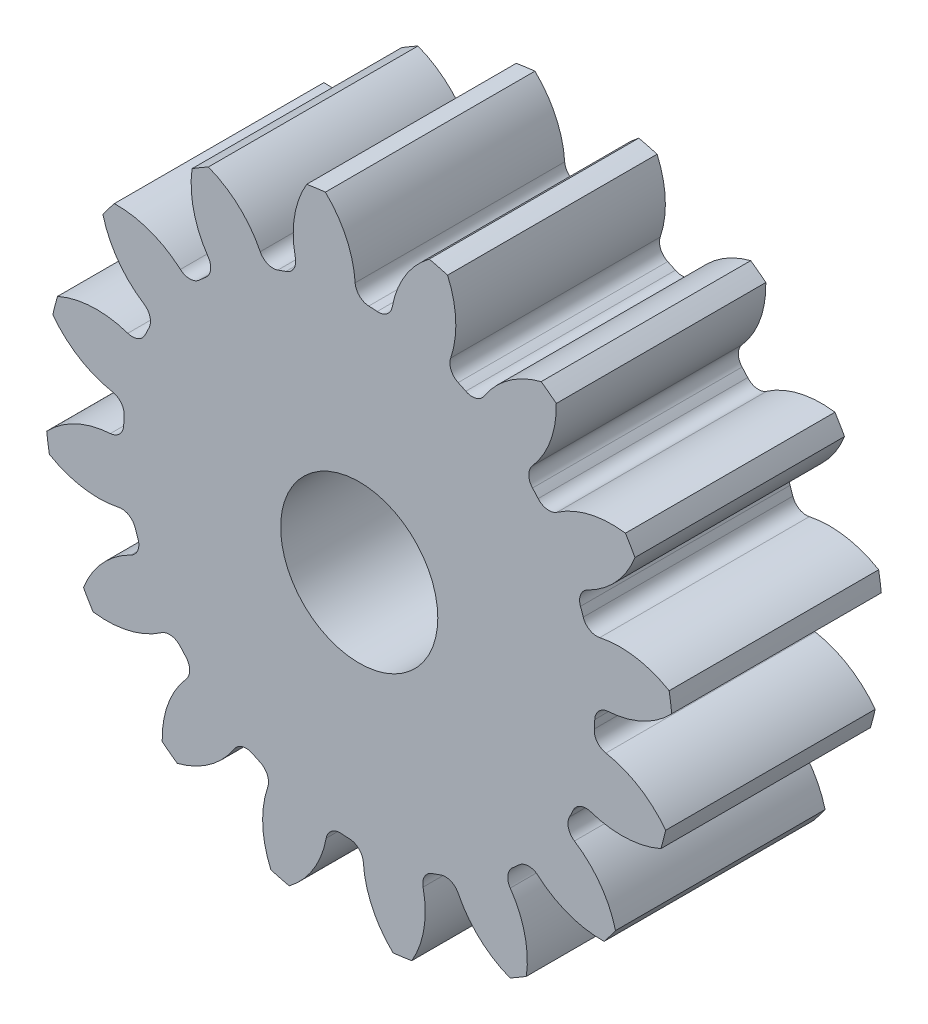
ISO-10303-21;
HEADER;
FILE_DESCRIPTION(('STEP AP214'),'2;1');
FILE_NAME('part.step','',(''),(''),'','','');
FILE_SCHEMA(('AUTOMOTIVE_DESIGN { 1 0 10303 214 1 1 1 1 }'));
ENDSEC;
DATA;
#1=APPLICATION_CONTEXT('core data for automotive mechanical design processes');
#2=APPLICATION_PROTOCOL_DEFINITION('international standard','automotive_design',2000,#1);
#3=PRODUCT_CONTEXT('',#1,'mechanical');
#4=PRODUCT('Part','Part','',(#3));
#5=PRODUCT_RELATED_PRODUCT_CATEGORY('part','',(#4));
#6=PRODUCT_DEFINITION_FORMATION('','',#4);
#7=PRODUCT_DEFINITION_CONTEXT('part definition',#1,'design');
#8=PRODUCT_DEFINITION('design','',#6,#7);
#9=PRODUCT_DEFINITION_SHAPE('','',#8);
#10=(LENGTH_UNIT() NAMED_UNIT(*) SI_UNIT(.MILLI.,.METRE.));
#11=(NAMED_UNIT(*) PLANE_ANGLE_UNIT() SI_UNIT($,.RADIAN.));
#12=(NAMED_UNIT(*) SI_UNIT($,.STERADIAN.) SOLID_ANGLE_UNIT());
#13=UNCERTAINTY_MEASURE_WITH_UNIT(LENGTH_MEASURE(1.E-05),#10,'distance_accuracy_value','');
#14=(GEOMETRIC_REPRESENTATION_CONTEXT(3) GLOBAL_UNCERTAINTY_ASSIGNED_CONTEXT((#13)) GLOBAL_UNIT_ASSIGNED_CONTEXT((#10,
#11,#12)) REPRESENTATION_CONTEXT('',''));
#15=CARTESIAN_POINT('',(0.,0.,0.));
#16=DIRECTION('',(0.,0.,1.));
#17=DIRECTION('',(1.,0.,0.));
#18=AXIS2_PLACEMENT_3D('',#15,#16,#17);
#19=CARTESIAN_POINT('',(0.,0.,101.6));
#20=DIRECTION('',(0.,0.,-1.));
#21=DIRECTION('',(-1.,0.,0.));
#22=AXIS2_PLACEMENT_3D('',#19,#20,#21);
#23=CYLINDRICAL_SURFACE('',#22,152.4);
#24=DIRECTION('',(0.,0.,-1.));
#25=VECTOR('',#24,1.);
#26=CARTESIAN_POINT('',(150.254101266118,25.4846042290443,50.8));
#27=LINE('',#26,#25);
#28=CARTESIAN_POINT('',(150.254101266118,25.4846042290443,101.6));
#29=VERTEX_POINT('',#28);
#30=CARTESIAN_POINT('',(150.254101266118,25.4846042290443,0.));
#31=VERTEX_POINT('',#30);
#32=EDGE_CURVE('E672',#29,#31,#27,.T.);
#33=ORIENTED_EDGE('',*,*,#32,.F.);
#34=CARTESIAN_POINT('',(0.,0.,101.6));
#35=DIRECTION('',(0.,0.,1.));
#36=DIRECTION('',(1.,0.,0.));
#37=AXIS2_PLACEMENT_3D('',#34,#35,#36);
#38=CIRCLE('',#37,152.4);
#39=CARTESIAN_POINT('',(151.514398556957,16.4057011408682,101.6));
#40=VERTEX_POINT('',#39);
#41=EDGE_CURVE('E1241',#40,#29,#38,.T.);
#42=ORIENTED_EDGE('',*,*,#41,.F.);
#43=DIRECTION('',(0.,0.,-1.));
#44=VECTOR('',#43,1.);
#45=CARTESIAN_POINT('',(151.514398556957,16.4057011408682,50.8));
#46=LINE('',#45,#44);
#47=CARTESIAN_POINT('',(151.514398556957,16.4057011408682,0.));
#48=VERTEX_POINT('',#47);
#49=EDGE_CURVE('E1235',#48,#40,#46,.F.);
#50=ORIENTED_EDGE('',*,*,#49,.F.);
#51=CARTESIAN_POINT('',(0.,0.,0.));
#52=DIRECTION('',(0.,0.,1.));
#53=DIRECTION('',(1.,0.,0.));
#54=AXIS2_PLACEMENT_3D('',#51,#52,#53);
#55=CIRCLE('',#54,152.4);
#56=EDGE_CURVE('E1246',#48,#31,#55,.T.);
#57=ORIENTED_EDGE('',*,*,#56,.T.);
#58=EDGE_LOOP('',(#33,#42,#50,#57));
#59=FACE_BOUND('',#58,.T.);
#60=ADVANCED_FACE('F33',(#59),#23,.T.);
#61=DIRECTION('',(0.,0.,-1.));
#62=VECTOR('',#61,1.);
#63=CARTESIAN_POINT('',(133.702861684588,73.138941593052,50.8));
#64=LINE('',#63,#62);
#65=CARTESIAN_POINT('',(133.702861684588,73.138941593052,0.));
#66=VERTEX_POINT('',#65);
#67=CARTESIAN_POINT('',(133.702861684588,73.138941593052,101.6));
#68=VERTEX_POINT('',#67);
#69=EDGE_CURVE('E643',#66,#68,#64,.F.);
#70=ORIENTED_EDGE('',*,*,#69,.F.);
#71=CARTESIAN_POINT('',(129.064153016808,81.0444594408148,0.));
#72=VERTEX_POINT('',#71);
#73=EDGE_CURVE('E1249',#66,#72,#55,.T.);
#74=ORIENTED_EDGE('',*,*,#73,.T.);
#75=DIRECTION('',(0.,0.,-1.));
#76=VECTOR('',#75,1.);
#77=CARTESIAN_POINT('',(129.064153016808,81.0444594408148,50.8));
#78=LINE('',#77,#76);
#79=CARTESIAN_POINT('',(129.064153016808,81.0444594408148,101.6));
#80=VERTEX_POINT('',#79);
#81=EDGE_CURVE('E705',#80,#72,#78,.T.);
#82=ORIENTED_EDGE('',*,*,#81,.F.);
#83=EDGE_CURVE('E1244',#68,#80,#38,.T.);
#84=ORIENTED_EDGE('',*,*,#83,.F.);
#85=EDGE_LOOP('',(#70,#74,#82,#84));
#86=FACE_BOUND('',#85,.T.);
#87=ADVANCED_FACE('F1431',(#86),#23,.T.);
#88=CARTESIAN_POINT('',(0.,0.,101.6));
#89=DIRECTION('',(0.,0.,1.));
#90=DIRECTION('',(1.,0.,0.));
#91=AXIS2_PLACEMENT_3D('',#88,#89,#90);
#92=PLANE('',#91);
#93=CARTESIAN_POINT('',(0.,0.,101.599999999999));
#94=DIRECTION('',(0.,0.,1.));
#95=DIRECTION('',(1.,0.,0.));
#96=AXIS2_PLACEMENT_3D('',#93,#94,#95);
#97=CIRCLE('',#96,38.1);
#98=CARTESIAN_POINT('',(38.1,0.,101.599999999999));
#99=VERTEX_POINT('',#98);
#100=EDGE_CURVE('E660',#99,#99,#97,.T.);
#101=ORIENTED_EDGE('',*,*,#100,.F.);
#102=EDGE_LOOP('',(#101));
#103=FACE_BOUND('',#102,.T.);
#104=ORIENTED_EDGE('',*,*,#41,.T.);
#105=CARTESIAN_POINT('',(126.429260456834,-14.8383014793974,101.6));
#106=DIRECTION('',(0.,0.,-1.));
#107=DIRECTION('',(0.923879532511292,0.382683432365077,0.));
#108=AXIS2_PLACEMENT_3D('',#105,#106,#107);
#109=CIRCLE('',#108,46.8354541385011);
#110=CARTESIAN_POINT('',(116.622592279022,30.9589585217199,101.6));
#111=VERTEX_POINT('',#110);
#112=EDGE_CURVE('E652',#111,#29,#109,.T.);
#113=ORIENTED_EDGE('',*,*,#112,.F.);
#114=CARTESIAN_POINT('',(115.179534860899,37.6980542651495,101.6));
#115=DIRECTION('',(0.,0.,1.));
#116=DIRECTION('',(-0.923879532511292,-0.382683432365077,0.));
#117=AXIS2_PLACEMENT_3D('',#114,#115,#116);
#118=CIRCLE('',#117,6.89186666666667);
#119=CARTESIAN_POINT('',(108.629573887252,35.5542638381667,101.6));
#120=VERTEX_POINT('',#119);
#121=EDGE_CURVE('E650',#120,#111,#118,.T.);
#122=ORIENTED_EDGE('',*,*,#121,.F.);
#123=CARTESIAN_POINT('',(0.,0.,101.6));
#124=DIRECTION('',(0.,0.,-1.));
#125=DIRECTION('',(0.923879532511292,0.382683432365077,0.));
#126=AXIS2_PLACEMENT_3D('',#123,#124,#125);
#127=CIRCLE('',#126,114.3);
#128=CARTESIAN_POINT('',(107.281488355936,39.4356723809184,101.6));
#129=VERTEX_POINT('',#128);
#130=EDGE_CURVE('E635',#129,#120,#127,.T.);
#131=ORIENTED_EDGE('',*,*,#130,.F.);
#132=CARTESIAN_POINT('',(113.750164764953,41.8134973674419,101.6));
#133=DIRECTION('',(0.,0.,1.));
#134=DIRECTION('',(-0.923879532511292,-0.382683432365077,0.));
#135=AXIS2_PLACEMENT_3D('',#132,#133,#134);
#136=CIRCLE('',#135,6.89186666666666);
#137=CARTESIAN_POINT('',(110.705229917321,47.9962312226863,101.6));
#138=VERTEX_POINT('',#137);
#139=EDGE_CURVE('E627',#138,#129,#136,.T.);
#140=ORIENTED_EDGE('',*,*,#139,.F.);
#141=CARTESIAN_POINT('',(90.0125912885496,90.0125907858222,101.6));
#142=DIRECTION('',(0.,0.,-1.));
#143=DIRECTION('',(-0.923879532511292,-0.382683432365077,0.));
#144=AXIS2_PLACEMENT_3D('',#141,#142,#143);
#145=CIRCLE('',#144,46.8354541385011);
#146=EDGE_CURVE('E657',#68,#138,#145,.T.);
#147=ORIENTED_EDGE('',*,*,#146,.F.);
#148=ORIENTED_EDGE('',*,*,#83,.T.);
#149=CARTESIAN_POINT('',(122.483778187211,34.673580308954,101.6));
#150=DIRECTION('',(0.,0.,-1.));
#151=DIRECTION('',(0.707106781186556,0.707106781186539,0.));
#152=AXIS2_PLACEMENT_3D('',#149,#150,#151);
#153=CIRCLE('',#152,46.8354541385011);
#154=CARTESIAN_POINT('',(95.8977455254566,73.2318820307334,101.6));
#155=VERTEX_POINT('',#154);
#156=EDGE_CURVE('E681',#155,#80,#153,.T.);
#157=ORIENTED_EDGE('',*,*,#156,.F.);
#158=CARTESIAN_POINT('',(91.9855940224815,78.9057604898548,101.6));
#159=DIRECTION('',(0.,0.,1.));
#160=DIRECTION('',(-0.707106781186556,-0.707106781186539,0.));
#161=AXIS2_PLACEMENT_3D('',#158,#159,#160);
#162=CIRCLE('',#161,6.89186666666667);
#163=CARTESIAN_POINT('',(86.7546122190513,74.4185948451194,101.6));
#164=VERTEX_POINT('',#163);
#165=EDGE_CURVE('E679',#164,#155,#162,.T.);
#166=ORIENTED_EDGE('',*,*,#165,.F.);
#167=CARTESIAN_POINT('',(0.,0.,101.6));
#168=DIRECTION('',(0.,0.,-1.));
#169=DIRECTION('',(0.707106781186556,0.707106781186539,0.));
#170=AXIS2_PLACEMENT_3D('',#167,#168,#169);
#171=CIRCLE('',#170,114.3);
#172=CARTESIAN_POINT('',(84.0237928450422,77.4886587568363,101.6));
#173=VERTEX_POINT('',#172);
#174=EDGE_CURVE('E676',#173,#164,#171,.T.);
#175=ORIENTED_EDGE('',*,*,#174,.F.);
#176=CARTESIAN_POINT('',(89.0901163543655,82.1609378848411,101.6));
#177=DIRECTION('',(0.,0.,1.));
#178=DIRECTION('',(-0.707106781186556,-0.707106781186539,0.));
#179=AXIS2_PLACEMENT_3D('',#176,#177,#178);
#180=CIRCLE('',#179,6.89186666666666);
#181=CARTESIAN_POINT('',(83.9109335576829,86.707793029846,101.6));
#182=VERTEX_POINT('',#181);
#183=EDGE_CURVE('E674',#182,#173,#180,.T.);
#184=ORIENTED_EDGE('',*,*,#183,.F.);
#185=CARTESIAN_POINT('',(48.7144635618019,117.607117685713,101.6));
#186=DIRECTION('',(0.,0.,-1.));
#187=DIRECTION('',(-0.707106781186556,-0.707106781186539,0.));
#188=AXIS2_PLACEMENT_3D('',#185,#186,#187);
#189=CIRCLE('',#188,46.8354541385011);
#190=CARTESIAN_POINT('',(95.5362761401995,118.737441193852,101.6));
#191=VERTEX_POINT('',#190);
#192=EDGE_CURVE('E684',#191,#182,#189,.T.);
#193=ORIENTED_EDGE('',*,*,#192,.F.);
#194=CARTESIAN_POINT('',(88.2253574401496,124.266030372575,101.6));
#195=VERTEX_POINT('',#194);
#196=EDGE_CURVE('E1289',#191,#195,#38,.T.);
#197=ORIENTED_EDGE('',*,*,#196,.T.);
#198=CARTESIAN_POINT('',(99.8912510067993,78.9067238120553,101.6));
#199=DIRECTION('',(0.,0.,-1.));
#200=DIRECTION('',(0.3826834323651,0.923879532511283,0.));
#201=AXIS2_PLACEMENT_3D('',#198,#199,#200);
#202=CIRCLE('',#201,46.8354541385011);
#203=CARTESIAN_POINT('',(60.5733363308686,104.355915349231,101.6));
#204=VERTEX_POINT('',#203);
#205=EDGE_CURVE('E716',#204,#195,#202,.T.);
#206=ORIENTED_EDGE('',*,*,#205,.F.);
#207=CARTESIAN_POINT('',(54.7876803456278,108.10077996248,101.6));
#208=DIRECTION('',(0.,0.,1.));
#209=DIRECTION('',(-0.3826834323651,-0.923879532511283,0.));
#210=AXIS2_PLACEMENT_3D('',#207,#208,#209);
#211=CIRCLE('',#210,6.89186666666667);
#212=CARTESIAN_POINT('',(51.6720472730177,101.953369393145,101.6));
#213=VERTEX_POINT('',#212);
#214=EDGE_CURVE('E714',#213,#204,#211,.T.);
#215=ORIENTED_EDGE('',*,*,#214,.F.);
#216=CARTESIAN_POINT('',(0.,0.,101.6));
#217=DIRECTION('',(0.,0.,-1.));
#218=DIRECTION('',(0.3826834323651,0.923879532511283,0.));
#219=AXIS2_PLACEMENT_3D('',#216,#217,#218);
#220=CIRCLE('',#219,114.3);
#221=CARTESIAN_POINT('',(47.9742365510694,103.744699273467,101.6));
#222=VERTEX_POINT('',#221);
#223=EDGE_CURVE('E711',#222,#213,#220,.T.);
#224=ORIENTED_EDGE('',*,*,#223,.F.);
#225=CARTESIAN_POINT('',(50.8669053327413,110.00012040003,101.6));
#226=DIRECTION('',(0.,0.,1.));
#227=DIRECTION('',(-0.3826834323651,-0.923879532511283,0.));
#228=AXIS2_PLACEMENT_3D('',#225,#226,#227);
#229=CIRCLE('',#228,6.89186666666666);
#230=CARTESIAN_POINT('',(44.3419582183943,112.218879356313,101.6));
#231=VERTEX_POINT('',#230);
#232=EDGE_CURVE('E709',#231,#222,#229,.T.);
#233=ORIENTED_EDGE('',*,*,#232,.F.);
#234=CARTESIAN_POINT('',(3.5548163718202E-07,127.297027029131,101.6));
#235=DIRECTION('',(0.,0.,-1.));
#236=DIRECTION('',(-0.3826834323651,-0.923879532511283,0.));
#237=AXIS2_PLACEMENT_3D('',#234,#235,#236);
#238=CIRCLE('',#237,46.8354541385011);
#239=CARTESIAN_POINT('',(42.8251585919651,146.259241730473,101.6));
#240=VERTEX_POINT('',#239);
#241=EDGE_CURVE('E719',#240,#231,#238,.T.);
#242=ORIENTED_EDGE('',*,*,#241,.F.);
#243=CARTESIAN_POINT('',(33.9550509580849,148.569224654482,101.6));
#244=VERTEX_POINT('',#243);
#245=EDGE_CURVE('E1413',#240,#244,#38,.T.);
#246=ORIENTED_EDGE('',*,*,#245,.T.);
#247=CARTESIAN_POINT('',(62.0911863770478,111.127033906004,101.6));
#248=DIRECTION('',(0.,0.,-1.));
#249=DIRECTION('',(0.,1.,0.));
#250=AXIS2_PLACEMENT_3D('',#247,#248,#249);
#251=CIRCLE('',#250,46.8354541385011);
#252=CARTESIAN_POINT('',(16.0271857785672,119.592706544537,101.6));
#253=VERTEX_POINT('',#252);
#254=EDGE_CURVE('E754',#253,#244,#251,.T.);
#255=ORIENTED_EDGE('',*,*,#254,.F.);
#256=CARTESIAN_POINT('',(9.24883898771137,120.838435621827,101.6));
#257=DIRECTION('',(0.,0.,1.));
#258=DIRECTION('',(0.,-1.,0.));
#259=AXIS2_PLACEMENT_3D('',#256,#257,#258);
#260=CIRCLE('',#259,6.89186666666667);
#261=CARTESIAN_POINT('',(8.72288153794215,113.966667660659,101.6));
#262=VERTEX_POINT('',#261);
#263=EDGE_CURVE('E752',#262,#253,#260,.T.);
#264=ORIENTED_EDGE('',*,*,#263,.F.);
#265=CARTESIAN_POINT('',(0.,0.,101.6));
#266=DIRECTION('',(0.,0.,-1.));
#267=DIRECTION('',(0.,1.,0.));
#268=AXIS2_PLACEMENT_3D('',#265,#266,#267);
#269=CIRCLE('',#268,114.3);
#270=CARTESIAN_POINT('',(4.62103762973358,114.206549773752,101.6));
#271=VERTEX_POINT('',#270);
#272=EDGE_CURVE('E749',#271,#262,#269,.T.);
#273=ORIENTED_EDGE('',*,*,#272,.F.);
#274=CARTESIAN_POINT('',(4.89966908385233,121.092781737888,101.6));
#275=DIRECTION('',(0.,0.,1.));
#276=DIRECTION('',(0.,-1.,0.));
#277=AXIS2_PLACEMENT_3D('',#274,#275,#276);
#278=CIRCLE('',#277,6.89186666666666);
#279=CARTESIAN_POINT('',(-1.97767829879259,120.645658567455,101.6));
#280=VERTEX_POINT('',#279);
#281=EDGE_CURVE('E747',#280,#271,#278,.T.);
#282=ORIENTED_EDGE('',*,*,#281,.F.);
#283=CARTESIAN_POINT('',(-48.7144629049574,117.607117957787,101.6));
#284=DIRECTION('',(0.,0.,-1.));
#285=DIRECTION('',(0.,-1.,0.));
#286=AXIS2_PLACEMENT_3D('',#283,#284,#285);
#287=CIRCLE('',#286,46.8354541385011);
#288=CARTESIAN_POINT('',(-16.4057011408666,151.514398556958,101.6));
#289=VERTEX_POINT('',#288);
#290=EDGE_CURVE('E757',#289,#280,#287,.T.);
#291=ORIENTED_EDGE('',*,*,#290,.F.);
#292=CARTESIAN_POINT('',(-25.4846042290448,150.254101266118,101.6));
#293=VERTEX_POINT('',#292);
#294=EDGE_CURVE('E1409',#289,#293,#38,.T.);
#295=ORIENTED_EDGE('',*,*,#294,.T.);
#296=CARTESIAN_POINT('',(14.8383014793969,126.429260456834,101.6));
#297=DIRECTION('',(0.,0.,-1.));
#298=DIRECTION('',(-0.382683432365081,0.923879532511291,0.));
#299=AXIS2_PLACEMENT_3D('',#296,#297,#298);
#300=CIRCLE('',#299,46.8354541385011);
#301=CARTESIAN_POINT('',(-30.9589585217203,116.622592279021,101.6));
#302=VERTEX_POINT('',#301);
#303=EDGE_CURVE('E792',#302,#293,#300,.T.);
#304=ORIENTED_EDGE('',*,*,#303,.F.);
#305=CARTESIAN_POINT('',(-37.6980542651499,115.179534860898,101.6));
#306=DIRECTION('',(0.,0.,1.));
#307=DIRECTION('',(0.382683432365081,-0.923879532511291,0.));
#308=AXIS2_PLACEMENT_3D('',#305,#306,#307);
#309=CIRCLE('',#308,6.89186666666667);
#310=CARTESIAN_POINT('',(-35.5542638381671,108.629573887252,101.6));
#311=VERTEX_POINT('',#310);
#312=EDGE_CURVE('E790',#311,#302,#309,.T.);
#313=ORIENTED_EDGE('',*,*,#312,.F.);
#314=CARTESIAN_POINT('',(0.,0.,101.6));
#315=DIRECTION('',(0.,0.,-1.));
#316=DIRECTION('',(-0.382683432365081,0.923879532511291,0.));
#317=AXIS2_PLACEMENT_3D('',#314,#315,#316);
#318=CIRCLE('',#317,114.3);
#319=CARTESIAN_POINT('',(-39.4356723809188,107.281488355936,101.6));
#320=VERTEX_POINT('',#319);
#321=EDGE_CURVE('E787',#320,#311,#318,.T.);
#322=ORIENTED_EDGE('',*,*,#321,.F.);
#323=CARTESIAN_POINT('',(-41.8134973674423,113.750164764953,101.6));
#324=DIRECTION('',(0.,0.,1.));
#325=DIRECTION('',(0.382683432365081,-0.923879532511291,0.));
#326=AXIS2_PLACEMENT_3D('',#323,#324,#325);
#327=CIRCLE('',#326,6.89186666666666);
#328=CARTESIAN_POINT('',(-47.9962312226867,110.705229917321,101.6));
#329=VERTEX_POINT('',#328);
#330=EDGE_CURVE('E785',#329,#320,#327,.T.);
#331=ORIENTED_EDGE('',*,*,#330,.F.);
#332=CARTESIAN_POINT('',(-90.0125907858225,90.0125912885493,101.6));
#333=DIRECTION('',(0.,0.,-1.));
#334=DIRECTION('',(0.382683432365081,-0.923879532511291,0.));
#335=AXIS2_PLACEMENT_3D('',#332,#333,#334);
#336=CIRCLE('',#335,46.8354541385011);
#337=CARTESIAN_POINT('',(-73.1389415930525,133.702861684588,101.6));
#338=VERTEX_POINT('',#337);
#339=EDGE_CURVE('E795',#338,#329,#336,.T.);
#340=ORIENTED_EDGE('',*,*,#339,.F.);
#341=CARTESIAN_POINT('',(-81.0444594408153,129.064153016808,101.6));
#342=VERTEX_POINT('',#341);
#343=EDGE_CURVE('E1405',#338,#342,#38,.T.);
#344=ORIENTED_EDGE('',*,*,#343,.T.);
#345=CARTESIAN_POINT('',(-34.6735803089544,122.483778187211,101.6));
#346=DIRECTION('',(0.,0.,-1.));
#347=DIRECTION('',(-0.707106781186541,0.707106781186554,0.));
#348=AXIS2_PLACEMENT_3D('',#345,#346,#347);
#349=CIRCLE('',#348,46.8354541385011);
#350=CARTESIAN_POINT('',(-73.2318820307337,95.8977455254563,101.6));
#351=VERTEX_POINT('',#350);
#352=EDGE_CURVE('E830',#351,#342,#349,.T.);
#353=ORIENTED_EDGE('',*,*,#352,.F.);
#354=CARTESIAN_POINT('',(-78.9057604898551,91.9855940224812,101.6));
#355=DIRECTION('',(0.,0.,1.));
#356=DIRECTION('',(0.707106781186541,-0.707106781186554,0.));
#357=AXIS2_PLACEMENT_3D('',#354,#355,#356);
#358=CIRCLE('',#357,6.89186666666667);
#359=CARTESIAN_POINT('',(-74.4185948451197,86.7546122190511,101.6));
#360=VERTEX_POINT('',#359);
#361=EDGE_CURVE('E828',#360,#351,#358,.T.);
#362=ORIENTED_EDGE('',*,*,#361,.F.);
#363=CARTESIAN_POINT('',(0.,0.,101.6));
#364=DIRECTION('',(0.,0.,-1.));
#365=DIRECTION('',(-0.707106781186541,0.707106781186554,0.));
#366=AXIS2_PLACEMENT_3D('',#363,#364,#365);
#367=CIRCLE('',#366,114.3);
#368=CARTESIAN_POINT('',(-77.4886587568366,84.023792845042,101.6));
#369=VERTEX_POINT('',#368);
#370=EDGE_CURVE('E825',#369,#360,#367,.T.);
#371=ORIENTED_EDGE('',*,*,#370,.F.);
#372=CARTESIAN_POINT('',(-82.1609378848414,89.0901163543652,101.6));
#373=DIRECTION('',(0.,0.,1.));
#374=DIRECTION('',(0.707106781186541,-0.707106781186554,0.));
#375=AXIS2_PLACEMENT_3D('',#372,#373,#374);
#376=CIRCLE('',#375,6.89186666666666);
#377=CARTESIAN_POINT('',(-86.7077930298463,83.9109335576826,101.6));
#378=VERTEX_POINT('',#377);
#379=EDGE_CURVE('E823',#378,#369,#376,.T.);
#380=ORIENTED_EDGE('',*,*,#379,.F.);
#381=CARTESIAN_POINT('',(-117.607117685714,48.7144635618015,101.6));
#382=DIRECTION('',(0.,0.,-1.));
#383=DIRECTION('',(0.707106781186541,-0.707106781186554,0.));
#384=AXIS2_PLACEMENT_3D('',#381,#382,#383);
#385=CIRCLE('',#384,46.8354541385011);
#386=CARTESIAN_POINT('',(-118.737441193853,95.536276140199,101.6));
#387=VERTEX_POINT('',#386);
#388=EDGE_CURVE('E833',#387,#378,#385,.T.);
#389=ORIENTED_EDGE('',*,*,#388,.F.);
#390=CARTESIAN_POINT('',(-124.266030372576,88.2253574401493,101.6));
#391=VERTEX_POINT('',#390);
#392=EDGE_CURVE('E1401',#387,#391,#38,.T.);
#393=ORIENTED_EDGE('',*,*,#392,.T.);
#394=CARTESIAN_POINT('',(-78.9067238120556,99.8912510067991,101.6));
#395=DIRECTION('',(0.,0.,-1.));
#396=DIRECTION('',(-0.923879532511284,0.382683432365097,0.));
#397=AXIS2_PLACEMENT_3D('',#394,#395,#396);
#398=CIRCLE('',#397,46.8354541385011);
#399=CARTESIAN_POINT('',(-104.355915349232,60.5733363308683,101.6));
#400=VERTEX_POINT('',#399);
#401=EDGE_CURVE('E868',#400,#391,#398,.T.);
#402=ORIENTED_EDGE('',*,*,#401,.F.);
#403=CARTESIAN_POINT('',(-108.10077996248,54.7876803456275,101.6));
#404=DIRECTION('',(0.,0.,1.));
#405=DIRECTION('',(0.923879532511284,-0.382683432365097,0.));
#406=AXIS2_PLACEMENT_3D('',#403,#404,#405);
#407=CIRCLE('',#406,6.89186666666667);
#408=CARTESIAN_POINT('',(-101.953369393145,51.6720472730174,101.6));
#409=VERTEX_POINT('',#408);
#410=EDGE_CURVE('E866',#409,#400,#407,.T.);
#411=ORIENTED_EDGE('',*,*,#410,.F.);
#412=CARTESIAN_POINT('',(0.,0.,101.6));
#413=DIRECTION('',(0.,0.,-1.));
#414=DIRECTION('',(-0.923879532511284,0.382683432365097,0.));
#415=AXIS2_PLACEMENT_3D('',#412,#413,#414);
#416=CIRCLE('',#415,114.3);
#417=CARTESIAN_POINT('',(-103.744699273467,47.9742365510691,101.6));
#418=VERTEX_POINT('',#417);
#419=EDGE_CURVE('E863',#418,#409,#416,.T.);
#420=ORIENTED_EDGE('',*,*,#419,.F.);
#421=CARTESIAN_POINT('',(-110.00012040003,50.866905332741,101.6));
#422=DIRECTION('',(0.,0.,1.));
#423=DIRECTION('',(0.923879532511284,-0.382683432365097,0.));
#424=AXIS2_PLACEMENT_3D('',#421,#422,#423);
#425=CIRCLE('',#424,6.89186666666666);
#426=CARTESIAN_POINT('',(-112.218879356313,44.3419582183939,101.6));
#427=VERTEX_POINT('',#426);
#428=EDGE_CURVE('E861',#427,#418,#425,.T.);
#429=ORIENTED_EDGE('',*,*,#428,.F.);
#430=CARTESIAN_POINT('',(-127.297027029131,3.55481255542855E-07,101.6));
#431=DIRECTION('',(0.,0.,-1.));
#432=DIRECTION('',(0.923879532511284,-0.382683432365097,0.));
#433=AXIS2_PLACEMENT_3D('',#430,#431,#432);
#434=CIRCLE('',#433,46.8354541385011);
#435=CARTESIAN_POINT('',(-146.259241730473,42.8251585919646,101.6));
#436=VERTEX_POINT('',#435);
#437=EDGE_CURVE('E871',#436,#427,#434,.T.);
#438=ORIENTED_EDGE('',*,*,#437,.F.);
#439=CARTESIAN_POINT('',(-148.569224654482,33.9550509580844,101.6));
#440=VERTEX_POINT('',#439);
#441=EDGE_CURVE('E1397',#436,#440,#38,.T.);
#442=ORIENTED_EDGE('',*,*,#441,.T.);
#443=CARTESIAN_POINT('',(-111.127033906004,62.0911863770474,101.6));
#444=DIRECTION('',(0.,0.,-1.));
#445=DIRECTION('',(-1.,0.,0.));
#446=AXIS2_PLACEMENT_3D('',#443,#444,#445);
#447=CIRCLE('',#446,46.8354541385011);
#448=CARTESIAN_POINT('',(-119.592706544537,16.0271857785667,101.6));
#449=VERTEX_POINT('',#448);
#450=EDGE_CURVE('E906',#449,#440,#447,.T.);
#451=ORIENTED_EDGE('',*,*,#450,.F.);
#452=CARTESIAN_POINT('',(-120.838435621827,9.24883898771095,101.6));
#453=DIRECTION('',(0.,0.,1.));
#454=DIRECTION('',(1.,0.,0.));
#455=AXIS2_PLACEMENT_3D('',#452,#453,#454);
#456=CIRCLE('',#455,6.89186666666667);
#457=CARTESIAN_POINT('',(-113.966667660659,8.72288153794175,101.6));
#458=VERTEX_POINT('',#457);
#459=EDGE_CURVE('E904',#458,#449,#456,.T.);
#460=ORIENTED_EDGE('',*,*,#459,.F.);
#461=CARTESIAN_POINT('',(0.,0.,101.6));
#462=DIRECTION('',(0.,0.,-1.));
#463=DIRECTION('',(-1.,0.,0.));
#464=AXIS2_PLACEMENT_3D('',#461,#462,#463);
#465=CIRCLE('',#464,114.3);
#466=CARTESIAN_POINT('',(-114.206549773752,4.62103762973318,101.6));
#467=VERTEX_POINT('',#466);
#468=EDGE_CURVE('E901',#467,#458,#465,.T.);
#469=ORIENTED_EDGE('',*,*,#468,.F.);
#470=CARTESIAN_POINT('',(-121.092781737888,4.89966908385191,101.6));
#471=DIRECTION('',(0.,0.,1.));
#472=DIRECTION('',(1.,0.,0.));
#473=AXIS2_PLACEMENT_3D('',#470,#471,#472);
#474=CIRCLE('',#473,6.89186666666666);
#475=CARTESIAN_POINT('',(-120.645658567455,-1.97767829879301,101.6));
#476=VERTEX_POINT('',#475);
#477=EDGE_CURVE('E899',#476,#467,#474,.T.);
#478=ORIENTED_EDGE('',*,*,#477,.F.);
#479=CARTESIAN_POINT('',(-117.607117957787,-48.7144629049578,101.6));
#480=DIRECTION('',(0.,0.,-1.));
#481=DIRECTION('',(1.,0.,0.));
#482=AXIS2_PLACEMENT_3D('',#479,#480,#481);
#483=CIRCLE('',#482,46.8354541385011);
#484=CARTESIAN_POINT('',(-151.514398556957,-16.4057011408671,101.6));
#485=VERTEX_POINT('',#484);
#486=EDGE_CURVE('E909',#485,#476,#483,.T.);
#487=ORIENTED_EDGE('',*,*,#486,.F.);
#488=CARTESIAN_POINT('',(-150.254101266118,-25.4846042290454,101.6));
#489=VERTEX_POINT('',#488);
#490=EDGE_CURVE('E1393',#485,#489,#38,.T.);
#491=ORIENTED_EDGE('',*,*,#490,.T.);
#492=CARTESIAN_POINT('',(-126.429260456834,14.8383014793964,101.6));
#493=DIRECTION('',(0.,0.,-1.));
#494=DIRECTION('',(-0.923879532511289,-0.382683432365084,0.));
#495=AXIS2_PLACEMENT_3D('',#492,#493,#494);
#496=CIRCLE('',#495,46.8354541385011);
#497=CARTESIAN_POINT('',(-116.622592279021,-30.9589585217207,101.6));
#498=VERTEX_POINT('',#497);
#499=EDGE_CURVE('E944',#498,#489,#496,.T.);
#500=ORIENTED_EDGE('',*,*,#499,.F.);
#501=CARTESIAN_POINT('',(-115.179534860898,-37.6980542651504,101.6));
#502=DIRECTION('',(0.,0.,1.));
#503=DIRECTION('',(0.923879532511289,0.382683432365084,0.));
#504=AXIS2_PLACEMENT_3D('',#501,#502,#503);
#505=CIRCLE('',#504,6.89186666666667);
#506=CARTESIAN_POINT('',(-108.629573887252,-35.5542638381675,101.6));
#507=VERTEX_POINT('',#506);
#508=EDGE_CURVE('E942',#507,#498,#505,.T.);
#509=ORIENTED_EDGE('',*,*,#508,.F.);
#510=CARTESIAN_POINT('',(0.,0.,101.6));
#511=DIRECTION('',(0.,0.,-1.));
#512=DIRECTION('',(-0.923879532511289,-0.382683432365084,0.));
#513=AXIS2_PLACEMENT_3D('',#510,#511,#512);
#514=CIRCLE('',#513,114.3);
#515=CARTESIAN_POINT('',(-107.281488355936,-39.4356723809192,101.6));
#516=VERTEX_POINT('',#515);
#517=EDGE_CURVE('E939',#516,#507,#514,.T.);
#518=ORIENTED_EDGE('',*,*,#517,.F.);
#519=CARTESIAN_POINT('',(-113.750164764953,-41.8134973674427,101.6));
#520=DIRECTION('',(0.,0.,1.));
#521=DIRECTION('',(0.923879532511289,0.382683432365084,0.));
#522=AXIS2_PLACEMENT_3D('',#519,#520,#521);
#523=CIRCLE('',#522,6.89186666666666);
#524=CARTESIAN_POINT('',(-110.705229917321,-47.9962312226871,101.6));
#525=VERTEX_POINT('',#524);
#526=EDGE_CURVE('E937',#525,#516,#523,.T.);
#527=ORIENTED_EDGE('',*,*,#526,.F.);
#528=CARTESIAN_POINT('',(-90.0125912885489,-90.0125907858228,101.6));
#529=DIRECTION('',(0.,0.,-1.));
#530=DIRECTION('',(0.923879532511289,0.382683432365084,0.));
#531=AXIS2_PLACEMENT_3D('',#528,#529,#530);
#532=CIRCLE('',#531,46.8354541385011);
#533=CARTESIAN_POINT('',(-133.702861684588,-73.138941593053,101.6));
#534=VERTEX_POINT('',#533);
#535=EDGE_CURVE('E947',#534,#525,#532,.T.);
#536=ORIENTED_EDGE('',*,*,#535,.F.);
#537=CARTESIAN_POINT('',(-129.064153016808,-81.0444594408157,101.6));
#538=VERTEX_POINT('',#537);
#539=EDGE_CURVE('E1389',#534,#538,#38,.T.);
#540=ORIENTED_EDGE('',*,*,#539,.T.);
#541=CARTESIAN_POINT('',(-122.483778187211,-34.6735803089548,101.6));
#542=DIRECTION('',(0.,0.,-1.));
#543=DIRECTION('',(-0.707106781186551,-0.707106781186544,0.));
#544=AXIS2_PLACEMENT_3D('',#541,#542,#543);
#545=CIRCLE('',#544,46.8354541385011);
#546=CARTESIAN_POINT('',(-95.897745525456,-73.2318820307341,101.6));
#547=VERTEX_POINT('',#546);
#548=EDGE_CURVE('E982',#547,#538,#545,.T.);
#549=ORIENTED_EDGE('',*,*,#548,.F.);
#550=CARTESIAN_POINT('',(-91.985594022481,-78.9057604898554,101.6));
#551=DIRECTION('',(0.,0.,1.));
#552=DIRECTION('',(0.707106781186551,0.707106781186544,0.));
#553=AXIS2_PLACEMENT_3D('',#550,#551,#552);
#554=CIRCLE('',#553,6.89186666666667);
#555=CARTESIAN_POINT('',(-86.7546122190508,-74.41859484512,101.6));
#556=VERTEX_POINT('',#555);
#557=EDGE_CURVE('E980',#556,#547,#554,.T.);
#558=ORIENTED_EDGE('',*,*,#557,.F.);
#559=CARTESIAN_POINT('',(0.,0.,101.6));
#560=DIRECTION('',(0.,0.,-1.));
#561=DIRECTION('',(-0.707106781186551,-0.707106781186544,0.));
#562=AXIS2_PLACEMENT_3D('',#559,#560,#561);
#563=CIRCLE('',#562,114.3);
#564=CARTESIAN_POINT('',(-84.0237928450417,-77.4886587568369,101.6));
#565=VERTEX_POINT('',#564);
#566=EDGE_CURVE('E977',#565,#556,#563,.T.);
#567=ORIENTED_EDGE('',*,*,#566,.F.);
#568=CARTESIAN_POINT('',(-89.090116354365,-82.1609378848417,101.6));
#569=DIRECTION('',(0.,0.,1.));
#570=DIRECTION('',(0.707106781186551,0.707106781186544,0.));
#571=AXIS2_PLACEMENT_3D('',#568,#569,#570);
#572=CIRCLE('',#571,6.89186666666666);
#573=CARTESIAN_POINT('',(-83.9109335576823,-86.7077930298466,101.6));
#574=VERTEX_POINT('',#573);
#575=EDGE_CURVE('E975',#574,#565,#572,.T.);
#576=ORIENTED_EDGE('',*,*,#575,.F.);
#577=CARTESIAN_POINT('',(-48.7144635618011,-117.607117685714,101.6));
#578=DIRECTION('',(0.,0.,-1.));
#579=DIRECTION('',(0.707106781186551,0.707106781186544,0.));
#580=AXIS2_PLACEMENT_3D('',#577,#578,#579);
#581=CIRCLE('',#580,46.8354541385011);
#582=CARTESIAN_POINT('',(-95.5362761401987,-118.737441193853,101.6));
#583=VERTEX_POINT('',#582);
#584=EDGE_CURVE('E985',#583,#574,#581,.T.);
#585=ORIENTED_EDGE('',*,*,#584,.F.);
#586=CARTESIAN_POINT('',(-88.2253574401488,-124.266030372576,101.6));
#587=VERTEX_POINT('',#586);
#588=EDGE_CURVE('E1385',#583,#587,#38,.T.);
#589=ORIENTED_EDGE('',*,*,#588,.T.);
#590=CARTESIAN_POINT('',(-99.8912510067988,-78.9067238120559,101.6));
#591=DIRECTION('',(0.,0.,-1.));
#592=DIRECTION('',(-0.382683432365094,-0.923879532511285,0.));
#593=AXIS2_PLACEMENT_3D('',#590,#591,#592);
#594=CIRCLE('',#593,46.8354541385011);
#595=CARTESIAN_POINT('',(-60.5733363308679,-104.355915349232,101.6));
#596=VERTEX_POINT('',#595);
#597=EDGE_CURVE('E1020',#596,#587,#594,.T.);
#598=ORIENTED_EDGE('',*,*,#597,.F.);
#599=CARTESIAN_POINT('',(-54.7876803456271,-108.10077996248,101.6));
#600=DIRECTION('',(0.,0.,1.));
#601=DIRECTION('',(0.382683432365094,0.923879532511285,0.));
#602=AXIS2_PLACEMENT_3D('',#599,#600,#601);
#603=CIRCLE('',#602,6.89186666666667);
#604=CARTESIAN_POINT('',(-51.672047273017,-101.953369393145,101.6));
#605=VERTEX_POINT('',#604);
#606=EDGE_CURVE('E1018',#605,#596,#603,.T.);
#607=ORIENTED_EDGE('',*,*,#606,.F.);
#608=CARTESIAN_POINT('',(0.,0.,101.6));
#609=DIRECTION('',(0.,0.,-1.));
#610=DIRECTION('',(-0.382683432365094,-0.923879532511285,0.));
#611=AXIS2_PLACEMENT_3D('',#608,#609,#610);
#612=CIRCLE('',#611,114.3);
#613=CARTESIAN_POINT('',(-47.9742365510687,-103.744699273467,101.6));
#614=VERTEX_POINT('',#613);
#615=EDGE_CURVE('E1015',#614,#605,#612,.T.);
#616=ORIENTED_EDGE('',*,*,#615,.F.);
#617=CARTESIAN_POINT('',(-50.8669053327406,-110.00012040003,101.6));
#618=DIRECTION('',(0.,0.,1.));
#619=DIRECTION('',(0.382683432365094,0.923879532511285,0.));
#620=AXIS2_PLACEMENT_3D('',#617,#618,#619);
#621=CIRCLE('',#620,6.89186666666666);
#622=CARTESIAN_POINT('',(-44.3419582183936,-112.218879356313,101.6));
#623=VERTEX_POINT('',#622);
#624=EDGE_CURVE('E1013',#623,#614,#621,.T.);
#625=ORIENTED_EDGE('',*,*,#624,.F.);
#626=CARTESIAN_POINT('',(-3.55480804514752E-07,-127.297027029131,101.6));
#627=DIRECTION('',(0.,0.,-1.));
#628=DIRECTION('',(0.382683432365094,0.923879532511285,0.));
#629=AXIS2_PLACEMENT_3D('',#626,#627,#628);
#630=CIRCLE('',#629,46.8354541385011);
#631=CARTESIAN_POINT('',(-42.8251585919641,-146.259241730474,101.6));
#632=VERTEX_POINT('',#631);
#633=EDGE_CURVE('E1023',#632,#623,#630,.T.);
#634=ORIENTED_EDGE('',*,*,#633,.F.);
#635=CARTESIAN_POINT('',(-33.9550509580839,-148.569224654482,101.6));
#636=VERTEX_POINT('',#635);
#637=EDGE_CURVE('E1381',#632,#636,#38,.T.);
#638=ORIENTED_EDGE('',*,*,#637,.T.);
#639=CARTESIAN_POINT('',(-62.0911863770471,-111.127033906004,101.6));
#640=DIRECTION('',(0.,0.,-1.));
#641=DIRECTION('',(0.,-1.,0.));
#642=AXIS2_PLACEMENT_3D('',#639,#640,#641);
#643=CIRCLE('',#642,46.8354541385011);
#644=CARTESIAN_POINT('',(-16.0271857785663,-119.592706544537,101.6));
#645=VERTEX_POINT('',#644);
#646=EDGE_CURVE('E1058',#645,#636,#643,.T.);
#647=ORIENTED_EDGE('',*,*,#646,.F.);
#648=CARTESIAN_POINT('',(-9.24883898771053,-120.838435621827,101.6));
#649=DIRECTION('',(0.,0.,1.));
#650=DIRECTION('',(0.,1.,0.));
#651=AXIS2_PLACEMENT_3D('',#648,#649,#650);
#652=CIRCLE('',#651,6.89186666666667);
#653=CARTESIAN_POINT('',(-8.72288153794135,-113.966667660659,101.6));
#654=VERTEX_POINT('',#653);
#655=EDGE_CURVE('E1056',#654,#645,#652,.T.);
#656=ORIENTED_EDGE('',*,*,#655,.F.);
#657=CARTESIAN_POINT('',(0.,0.,101.6));
#658=DIRECTION('',(0.,0.,-1.));
#659=DIRECTION('',(0.,-1.,0.));
#660=AXIS2_PLACEMENT_3D('',#657,#658,#659);
#661=CIRCLE('',#660,114.3);
#662=CARTESIAN_POINT('',(-4.62103762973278,-114.206549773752,101.6));
#663=VERTEX_POINT('',#662);
#664=EDGE_CURVE('E1053',#663,#654,#661,.T.);
#665=ORIENTED_EDGE('',*,*,#664,.F.);
#666=CARTESIAN_POINT('',(-4.89966908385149,-121.092781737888,101.6));
#667=DIRECTION('',(0.,0.,1.));
#668=DIRECTION('',(0.,1.,0.));
#669=AXIS2_PLACEMENT_3D('',#666,#667,#668);
#670=CIRCLE('',#669,6.89186666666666);
#671=CARTESIAN_POINT('',(1.97767829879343,-120.645658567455,101.6));
#672=VERTEX_POINT('',#671);
#673=EDGE_CURVE('E1051',#672,#663,#670,.T.);
#674=ORIENTED_EDGE('',*,*,#673,.F.);
#675=CARTESIAN_POINT('',(48.7144629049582,-117.607117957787,101.6));
#676=DIRECTION('',(0.,0.,-1.));
#677=DIRECTION('',(0.,1.,0.));
#678=AXIS2_PLACEMENT_3D('',#675,#676,#677);
#679=CIRCLE('',#678,46.8354541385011);
#680=CARTESIAN_POINT('',(16.4057011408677,-151.514398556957,101.6));
#681=VERTEX_POINT('',#680);
#682=EDGE_CURVE('E1061',#681,#672,#679,.T.);
#683=ORIENTED_EDGE('',*,*,#682,.F.);
#684=CARTESIAN_POINT('',(25.4846042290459,-150.254101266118,101.6));
#685=VERTEX_POINT('',#684);
#686=EDGE_CURVE('E1377',#681,#685,#38,.T.);
#687=ORIENTED_EDGE('',*,*,#686,.T.);
#688=CARTESIAN_POINT('',(-14.838301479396,-126.429260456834,101.6));
#689=DIRECTION('',(0.,0.,-1.));
#690=DIRECTION('',(0.382683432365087,-0.923879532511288,0.));
#691=AXIS2_PLACEMENT_3D('',#688,#689,#690);
#692=CIRCLE('',#691,46.8354541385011);
#693=CARTESIAN_POINT('',(30.9589585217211,-116.622592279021,101.6));
#694=VERTEX_POINT('',#693);
#695=EDGE_CURVE('E1096',#694,#685,#692,.T.);
#696=ORIENTED_EDGE('',*,*,#695,.F.);
#697=CARTESIAN_POINT('',(37.6980542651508,-115.179534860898,101.6));
#698=DIRECTION('',(0.,0.,1.));
#699=DIRECTION('',(-0.382683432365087,0.923879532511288,0.));
#700=AXIS2_PLACEMENT_3D('',#697,#698,#699);
#701=CIRCLE('',#700,6.89186666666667);
#702=CARTESIAN_POINT('',(35.5542638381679,-108.629573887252,101.6));
#703=VERTEX_POINT('',#702);
#704=EDGE_CURVE('E1094',#703,#694,#701,.T.);
#705=ORIENTED_EDGE('',*,*,#704,.F.);
#706=CARTESIAN_POINT('',(0.,0.,101.6));
#707=DIRECTION('',(0.,0.,-1.));
#708=DIRECTION('',(0.382683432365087,-0.923879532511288,0.));
#709=AXIS2_PLACEMENT_3D('',#706,#707,#708);
#710=CIRCLE('',#709,114.3);
#711=CARTESIAN_POINT('',(39.4356723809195,-107.281488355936,101.6));
#712=VERTEX_POINT('',#711);
#713=EDGE_CURVE('E1091',#712,#703,#710,.T.);
#714=ORIENTED_EDGE('',*,*,#713,.F.);
#715=CARTESIAN_POINT('',(41.8134973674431,-113.750164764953,101.6));
#716=DIRECTION('',(0.,0.,1.));
#717=DIRECTION('',(-0.382683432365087,0.923879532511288,0.));
#718=AXIS2_PLACEMENT_3D('',#715,#716,#717);
#719=CIRCLE('',#718,6.89186666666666);
#720=CARTESIAN_POINT('',(47.9962312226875,-110.705229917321,101.6));
#721=VERTEX_POINT('',#720);
#722=EDGE_CURVE('E1089',#721,#712,#719,.T.);
#723=ORIENTED_EDGE('',*,*,#722,.F.);
#724=CARTESIAN_POINT('',(90.0125907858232,-90.0125912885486,101.6));
#725=DIRECTION('',(0.,0.,-1.));
#726=DIRECTION('',(-0.382683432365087,0.923879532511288,0.));
#727=AXIS2_PLACEMENT_3D('',#724,#725,#726);
#728=CIRCLE('',#727,46.8354541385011);
#729=CARTESIAN_POINT('',(73.1389415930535,-133.702861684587,101.6));
#730=VERTEX_POINT('',#729);
#731=EDGE_CURVE('E1099',#730,#721,#728,.T.);
#732=ORIENTED_EDGE('',*,*,#731,.F.);
#733=CARTESIAN_POINT('',(81.0444594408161,-129.064153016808,101.6));
#734=VERTEX_POINT('',#733);
#735=EDGE_CURVE('E1373',#730,#734,#38,.T.);
#736=ORIENTED_EDGE('',*,*,#735,.T.);
#737=CARTESIAN_POINT('',(34.6735803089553,-122.483778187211,101.6));
#738=DIRECTION('',(0.,0.,-1.));
#739=DIRECTION('',(0.707106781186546,-0.707106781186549,0.));
#740=AXIS2_PLACEMENT_3D('',#737,#738,#739);
#741=CIRCLE('',#740,46.8354541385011);
#742=CARTESIAN_POINT('',(73.2318820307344,-95.8977455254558,101.6));
#743=VERTEX_POINT('',#742);
#744=EDGE_CURVE('E1134',#743,#734,#741,.T.);
#745=ORIENTED_EDGE('',*,*,#744,.F.);
#746=CARTESIAN_POINT('',(78.9057604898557,-91.9855940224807,101.6));
#747=DIRECTION('',(0.,0.,1.));
#748=DIRECTION('',(-0.707106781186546,0.707106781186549,0.));
#749=AXIS2_PLACEMENT_3D('',#746,#747,#748);
#750=CIRCLE('',#749,6.89186666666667);
#751=CARTESIAN_POINT('',(74.4185948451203,-86.7546122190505,101.6));
#752=VERTEX_POINT('',#751);
#753=EDGE_CURVE('E1132',#752,#743,#750,.T.);
#754=ORIENTED_EDGE('',*,*,#753,.F.);
#755=CARTESIAN_POINT('',(0.,0.,101.6));
#756=DIRECTION('',(0.,0.,-1.));
#757=DIRECTION('',(0.707106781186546,-0.707106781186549,0.));
#758=AXIS2_PLACEMENT_3D('',#755,#756,#757);
#759=CIRCLE('',#758,114.3);
#760=CARTESIAN_POINT('',(77.4886587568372,-84.0237928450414,101.6));
#761=VERTEX_POINT('',#760);
#762=EDGE_CURVE('E1129',#761,#752,#759,.T.);
#763=ORIENTED_EDGE('',*,*,#762,.F.);
#764=CARTESIAN_POINT('',(82.160937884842,-89.0901163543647,101.6));
#765=DIRECTION('',(0.,0.,1.));
#766=DIRECTION('',(-0.707106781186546,0.707106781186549,0.));
#767=AXIS2_PLACEMENT_3D('',#764,#765,#766);
#768=CIRCLE('',#767,6.89186666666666);
#769=CARTESIAN_POINT('',(86.7077930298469,-83.910933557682,101.6));
#770=VERTEX_POINT('',#769);
#771=EDGE_CURVE('E1127',#770,#761,#768,.T.);
#772=ORIENTED_EDGE('',*,*,#771,.F.);
#773=CARTESIAN_POINT('',(117.607117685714,-48.7144635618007,101.6));
#774=DIRECTION('',(0.,0.,-1.));
#775=DIRECTION('',(-0.707106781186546,0.707106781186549,0.));
#776=AXIS2_PLACEMENT_3D('',#773,#774,#775);
#777=CIRCLE('',#776,46.8354541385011);
#778=CARTESIAN_POINT('',(118.737441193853,-95.5362761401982,101.6));
#779=VERTEX_POINT('',#778);
#780=EDGE_CURVE('E1137',#779,#770,#777,.T.);
#781=ORIENTED_EDGE('',*,*,#780,.F.);
#782=CARTESIAN_POINT('',(124.266030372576,-88.2253574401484,101.6));
#783=VERTEX_POINT('',#782);
#784=EDGE_CURVE('E1372',#779,#783,#38,.T.);
#785=ORIENTED_EDGE('',*,*,#784,.T.);
#786=CARTESIAN_POINT('',(78.9067238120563,-99.8912510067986,101.6));
#787=DIRECTION('',(0.,0.,-1.));
#788=DIRECTION('',(0.923879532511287,-0.382683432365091,0.));
#789=AXIS2_PLACEMENT_3D('',#786,#787,#788);
#790=CIRCLE('',#789,46.8354541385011);
#791=CARTESIAN_POINT('',(104.355915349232,-60.5733363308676,101.6));
#792=VERTEX_POINT('',#791);
#793=EDGE_CURVE('E1172',#792,#783,#790,.T.);
#794=ORIENTED_EDGE('',*,*,#793,.F.);
#795=CARTESIAN_POINT('',(108.10077996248,-54.7876803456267,101.6));
#796=DIRECTION('',(0.,0.,1.));
#797=DIRECTION('',(-0.923879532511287,0.382683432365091,0.));
#798=AXIS2_PLACEMENT_3D('',#795,#796,#797);
#799=CIRCLE('',#798,6.89186666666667);
#800=CARTESIAN_POINT('',(101.953369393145,-51.6720472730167,101.6));
#801=VERTEX_POINT('',#800);
#802=EDGE_CURVE('E1170',#801,#792,#799,.T.);
#803=ORIENTED_EDGE('',*,*,#802,.F.);
#804=CARTESIAN_POINT('',(0.,0.,101.6));
#805=DIRECTION('',(0.,0.,-1.));
#806=DIRECTION('',(0.923879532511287,-0.382683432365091,0.));
#807=AXIS2_PLACEMENT_3D('',#804,#805,#806);
#808=CIRCLE('',#807,114.3);
#809=CARTESIAN_POINT('',(103.744699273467,-47.9742365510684,101.6));
#810=VERTEX_POINT('',#809);
#811=EDGE_CURVE('E1167',#810,#801,#808,.T.);
#812=ORIENTED_EDGE('',*,*,#811,.F.);
#813=CARTESIAN_POINT('',(110.00012040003,-50.8669053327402,101.6));
#814=DIRECTION('',(0.,0.,1.));
#815=DIRECTION('',(-0.923879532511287,0.382683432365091,0.));
#816=AXIS2_PLACEMENT_3D('',#813,#814,#815);
#817=CIRCLE('',#816,6.89186666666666);
#818=CARTESIAN_POINT('',(112.218879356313,-44.3419582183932,101.6));
#819=VERTEX_POINT('',#818);
#820=EDGE_CURVE('E1165',#819,#810,#817,.T.);
#821=ORIENTED_EDGE('',*,*,#820,.F.);
#822=CARTESIAN_POINT('',(127.297027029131,-3.55480353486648E-07,101.6));
#823=DIRECTION('',(0.,0.,-1.));
#824=DIRECTION('',(-0.923879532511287,0.382683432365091,0.));
#825=AXIS2_PLACEMENT_3D('',#822,#823,#824);
#826=CIRCLE('',#825,46.8354541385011);
#827=CARTESIAN_POINT('',(146.259241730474,-42.8251585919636,101.6));
#828=VERTEX_POINT('',#827);
#829=EDGE_CURVE('E1175',#828,#819,#826,.T.);
#830=ORIENTED_EDGE('',*,*,#829,.F.);
#831=CARTESIAN_POINT('',(148.569224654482,-33.9550509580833,101.6));
#832=VERTEX_POINT('',#831);
#833=EDGE_CURVE('E1245',#828,#832,#38,.T.);
#834=ORIENTED_EDGE('',*,*,#833,.T.);
#835=CARTESIAN_POINT('',(111.127033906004,-62.0911863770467,101.6));
#836=DIRECTION('',(0.,0.,-1.));
#837=DIRECTION('',(1.,0.,0.));
#838=AXIS2_PLACEMENT_3D('',#835,#836,#837);
#839=CIRCLE('',#838,46.8354541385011);
#840=CARTESIAN_POINT('',(119.592706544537,-16.0271857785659,101.6));
#841=VERTEX_POINT('',#840);
#842=EDGE_CURVE('E1210',#841,#832,#839,.T.);
#843=ORIENTED_EDGE('',*,*,#842,.F.);
#844=CARTESIAN_POINT('',(120.838435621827,-9.2488389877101,101.6));
#845=DIRECTION('',(0.,0.,1.));
#846=DIRECTION('',(-1.,0.,0.));
#847=AXIS2_PLACEMENT_3D('',#844,#845,#846);
#848=CIRCLE('',#847,6.89186666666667);
#849=CARTESIAN_POINT('',(113.966667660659,-8.72288153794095,101.6));
#850=VERTEX_POINT('',#849);
#851=EDGE_CURVE('E1208',#850,#841,#848,.T.);
#852=ORIENTED_EDGE('',*,*,#851,.F.);
#853=CARTESIAN_POINT('',(0.,0.,101.6));
#854=DIRECTION('',(0.,0.,-1.));
#855=DIRECTION('',(1.,0.,0.));
#856=AXIS2_PLACEMENT_3D('',#853,#854,#855);
#857=CIRCLE('',#856,114.3);
#858=CARTESIAN_POINT('',(114.206549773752,-4.62103762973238,101.6));
#859=VERTEX_POINT('',#858);
#860=EDGE_CURVE('E1205',#859,#850,#857,.T.);
#861=ORIENTED_EDGE('',*,*,#860,.F.);
#862=CARTESIAN_POINT('',(121.092781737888,-4.89966908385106,101.6));
#863=DIRECTION('',(0.,0.,1.));
#864=DIRECTION('',(-1.,0.,0.));
#865=AXIS2_PLACEMENT_3D('',#862,#863,#864);
#866=CIRCLE('',#865,6.89186666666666);
#867=CARTESIAN_POINT('',(120.645658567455,1.97767829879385,101.6));
#868=VERTEX_POINT('',#867);
#869=EDGE_CURVE('E1203',#868,#859,#866,.T.);
#870=ORIENTED_EDGE('',*,*,#869,.F.);
#871=CARTESIAN_POINT('',(117.607117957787,48.7144629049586,101.6));
#872=DIRECTION('',(0.,0.,-1.));
#873=DIRECTION('',(-1.,0.,0.));
#874=AXIS2_PLACEMENT_3D('',#871,#872,#873);
#875=CIRCLE('',#874,46.8354541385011);
#876=EDGE_CURVE('E1213',#40,#868,#875,.T.);
#877=ORIENTED_EDGE('',*,*,#876,.F.);
#878=EDGE_LOOP('',(#104,#113,#122,#131,#140,#147,#148,#157,#166,#175,#184,#193,#197,#206,#215,
#224,#233,#242,#246,#255,#264,#273,#282,#291,#295,#304,#313,#322,#331,#340,#344,#353,#362,#371,
#380,#389,#393,#402,#411,#420,#429,#438,#442,#451,#460,#469,#478,#487,#491,#500,#509,#518,#527,
#536,#540,#549,#558,#567,#576,#585,#589,#598,#607,#616,#625,#634,#638,#647,#656,#665,#674,#683,
#687,#696,#705,#714,#723,#732,#736,#745,#754,#763,#772,#781,#785,#794,#803,#812,#821,#830,#834,
#843,#852,#861,#870,#877));
#879=FACE_BOUND('',#878,.T.);
#880=ADVANCED_FACE('F648',(#103,#879),#92,.T.);
#881=CARTESIAN_POINT('',(0.,0.,0.));
#882=DIRECTION('',(0.,0.,1.));
#883=DIRECTION('',(1.,0.,0.));
#884=AXIS2_PLACEMENT_3D('',#881,#882,#883);
#885=PLANE('',#884);
#886=CARTESIAN_POINT('',(0.,0.,0.));
#887=DIRECTION('',(0.,0.,1.));
#888=DIRECTION('',(1.,0.,0.));
#889=AXIS2_PLACEMENT_3D('',#886,#887,#888);
#890=CIRCLE('',#889,38.1);
#891=CARTESIAN_POINT('',(38.1,0.,-1.77635683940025E-12));
#892=VERTEX_POINT('',#891);
#893=EDGE_CURVE('E36',#892,#892,#890,.T.);
#894=ORIENTED_EDGE('',*,*,#893,.T.);
#895=EDGE_LOOP('',(#894));
#896=FACE_BOUND('',#895,.T.);
#897=CARTESIAN_POINT('',(126.429260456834,-14.8383014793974,0.));
#898=DIRECTION('',(0.,0.,-1.));
#899=DIRECTION('',(0.923879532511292,0.382683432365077,0.));
#900=AXIS2_PLACEMENT_3D('',#897,#898,#899);
#901=CIRCLE('',#900,46.8354541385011);
#902=CARTESIAN_POINT('',(116.622592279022,30.9589585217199,0.));
#903=VERTEX_POINT('',#902);
#904=EDGE_CURVE('E636',#903,#31,#901,.T.);
#905=ORIENTED_EDGE('',*,*,#904,.T.);
#906=ORIENTED_EDGE('',*,*,#56,.F.);
#907=CARTESIAN_POINT('',(117.607117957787,48.7144629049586,0.));
#908=DIRECTION('',(0.,0.,1.));
#909=DIRECTION('',(1.,0.,0.));
#910=AXIS2_PLACEMENT_3D('',#907,#908,#909);
#911=CIRCLE('',#910,46.8354541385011);
#912=CARTESIAN_POINT('',(120.645658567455,1.97767829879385,0.));
#913=VERTEX_POINT('',#912);
#914=EDGE_CURVE('E1243',#913,#48,#911,.T.);
#915=ORIENTED_EDGE('',*,*,#914,.F.);
#916=CARTESIAN_POINT('',(121.092781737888,-4.89966908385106,0.));
#917=DIRECTION('',(0.,0.,1.));
#918=DIRECTION('',(-1.,0.,0.));
#919=AXIS2_PLACEMENT_3D('',#916,#917,#918);
#920=CIRCLE('',#919,6.89186666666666);
#921=CARTESIAN_POINT('',(114.206549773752,-4.62103762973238,0.));
#922=VERTEX_POINT('',#921);
#923=EDGE_CURVE('E1202',#913,#922,#920,.T.);
#924=ORIENTED_EDGE('',*,*,#923,.T.);
#925=CARTESIAN_POINT('',(0.,0.,0.));
#926=DIRECTION('',(0.,0.,-1.));
#927=DIRECTION('',(1.,0.,0.));
#928=AXIS2_PLACEMENT_3D('',#925,#926,#927);
#929=CIRCLE('',#928,114.3);
#930=CARTESIAN_POINT('',(113.966667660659,-8.72288153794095,0.));
#931=VERTEX_POINT('',#930);
#932=EDGE_CURVE('E1218',#922,#931,#929,.T.);
#933=ORIENTED_EDGE('',*,*,#932,.T.);
#934=CARTESIAN_POINT('',(120.838435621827,-9.2488389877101,0.));
#935=DIRECTION('',(0.,0.,1.));
#936=DIRECTION('',(-1.,0.,0.));
#937=AXIS2_PLACEMENT_3D('',#934,#935,#936);
#938=CIRCLE('',#937,6.89186666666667);
#939=CARTESIAN_POINT('',(119.592706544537,-16.0271857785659,0.));
#940=VERTEX_POINT('',#939);
#941=EDGE_CURVE('E1221',#931,#940,#938,.T.);
#942=ORIENTED_EDGE('',*,*,#941,.T.);
#943=CARTESIAN_POINT('',(111.127033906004,-62.0911863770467,0.));
#944=DIRECTION('',(0.,0.,-1.));
#945=DIRECTION('',(1.,0.,0.));
#946=AXIS2_PLACEMENT_3D('',#943,#944,#945);
#947=CIRCLE('',#946,46.8354541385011);
#948=CARTESIAN_POINT('',(148.569224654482,-33.9550509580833,0.));
#949=VERTEX_POINT('',#948);
#950=EDGE_CURVE('E1206',#940,#949,#947,.T.);
#951=ORIENTED_EDGE('',*,*,#950,.T.);
#952=CARTESIAN_POINT('',(146.259241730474,-42.8251585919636,0.));
#953=VERTEX_POINT('',#952);
#954=EDGE_CURVE('E1240',#953,#949,#55,.T.);
#955=ORIENTED_EDGE('',*,*,#954,.F.);
#956=CARTESIAN_POINT('',(127.297027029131,-3.55480353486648E-07,0.));
#957=DIRECTION('',(0.,0.,1.));
#958=DIRECTION('',(1.,0.,0.));
#959=AXIS2_PLACEMENT_3D('',#956,#957,#958);
#960=CIRCLE('',#959,46.8354541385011);
#961=CARTESIAN_POINT('',(112.218879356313,-44.3419582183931,0.));
#962=VERTEX_POINT('',#961);
#963=EDGE_CURVE('E1251',#962,#953,#960,.T.);
#964=ORIENTED_EDGE('',*,*,#963,.F.);
#965=CARTESIAN_POINT('',(110.00012040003,-50.8669053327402,0.));
#966=DIRECTION('',(0.,0.,1.));
#967=DIRECTION('',(-0.923879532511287,0.382683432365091,0.));
#968=AXIS2_PLACEMENT_3D('',#965,#966,#967);
#969=CIRCLE('',#968,6.89186666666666);
#970=CARTESIAN_POINT('',(103.744699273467,-47.9742365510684,0.));
#971=VERTEX_POINT('',#970);
#972=EDGE_CURVE('E1164',#962,#971,#969,.T.);
#973=ORIENTED_EDGE('',*,*,#972,.T.);
#974=CARTESIAN_POINT('',(0.,0.,0.));
#975=DIRECTION('',(0.,0.,-1.));
#976=DIRECTION('',(0.923879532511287,-0.382683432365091,0.));
#977=AXIS2_PLACEMENT_3D('',#974,#975,#976);
#978=CIRCLE('',#977,114.3);
#979=CARTESIAN_POINT('',(101.953369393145,-51.6720472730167,0.));
#980=VERTEX_POINT('',#979);
#981=EDGE_CURVE('E1180',#971,#980,#978,.T.);
#982=ORIENTED_EDGE('',*,*,#981,.T.);
#983=CARTESIAN_POINT('',(108.10077996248,-54.7876803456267,0.));
#984=DIRECTION('',(0.,0.,1.));
#985=DIRECTION('',(-0.923879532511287,0.382683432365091,0.));
#986=AXIS2_PLACEMENT_3D('',#983,#984,#985);
#987=CIRCLE('',#986,6.89186666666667);
#988=CARTESIAN_POINT('',(104.355915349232,-60.5733363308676,0.));
#989=VERTEX_POINT('',#988);
#990=EDGE_CURVE('E1183',#980,#989,#987,.T.);
#991=ORIENTED_EDGE('',*,*,#990,.T.);
#992=CARTESIAN_POINT('',(78.9067238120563,-99.8912510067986,0.));
#993=DIRECTION('',(0.,0.,-1.));
#994=DIRECTION('',(0.923879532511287,-0.382683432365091,0.));
#995=AXIS2_PLACEMENT_3D('',#992,#993,#994);
#996=CIRCLE('',#995,46.8354541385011);
#997=CARTESIAN_POINT('',(124.266030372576,-88.2253574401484,0.));
#998=VERTEX_POINT('',#997);
#999=EDGE_CURVE('E1168',#989,#998,#996,.T.);
#1000=ORIENTED_EDGE('',*,*,#999,.T.);
#1001=CARTESIAN_POINT('',(118.737441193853,-95.5362761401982,0.));
#1002=VERTEX_POINT('',#1001);
#1003=EDGE_CURVE('E1343',#1002,#998,#55,.T.);
#1004=ORIENTED_EDGE('',*,*,#1003,.F.);
#1005=CARTESIAN_POINT('',(117.607117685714,-48.7144635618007,0.));
#1006=DIRECTION('',(0.,0.,1.));
#1007=DIRECTION('',(1.,0.,0.));
#1008=AXIS2_PLACEMENT_3D('',#1005,#1006,#1007);
#1009=CIRCLE('',#1008,46.8354541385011);
#1010=CARTESIAN_POINT('',(86.7077930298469,-83.910933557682,0.));
#1011=VERTEX_POINT('',#1010);
#1012=EDGE_CURVE('E1253',#1011,#1002,#1009,.T.);
#1013=ORIENTED_EDGE('',*,*,#1012,.F.);
#1014=CARTESIAN_POINT('',(82.160937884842,-89.0901163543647,0.));
#1015=DIRECTION('',(0.,0.,1.));
#1016=DIRECTION('',(-0.707106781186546,0.707106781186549,0.));
#1017=AXIS2_PLACEMENT_3D('',#1014,#1015,#1016);
#1018=CIRCLE('',#1017,6.89186666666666);
#1019=CARTESIAN_POINT('',(77.4886587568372,-84.0237928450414,0.));
#1020=VERTEX_POINT('',#1019);
#1021=EDGE_CURVE('E1126',#1011,#1020,#1018,.T.);
#1022=ORIENTED_EDGE('',*,*,#1021,.T.);
#1023=CARTESIAN_POINT('',(0.,0.,0.));
#1024=DIRECTION('',(0.,0.,-1.));
#1025=DIRECTION('',(0.707106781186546,-0.707106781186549,0.));
#1026=AXIS2_PLACEMENT_3D('',#1023,#1024,#1025);
#1027=CIRCLE('',#1026,114.3);
#1028=CARTESIAN_POINT('',(74.4185948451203,-86.7546122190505,0.));
#1029=VERTEX_POINT('',#1028);
#1030=EDGE_CURVE('E1142',#1020,#1029,#1027,.T.);
#1031=ORIENTED_EDGE('',*,*,#1030,.T.);
#1032=CARTESIAN_POINT('',(78.9057604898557,-91.9855940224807,0.));
#1033=DIRECTION('',(0.,0.,1.));
#1034=DIRECTION('',(-0.707106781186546,0.707106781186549,0.));
#1035=AXIS2_PLACEMENT_3D('',#1032,#1033,#1034);
#1036=CIRCLE('',#1035,6.89186666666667);
#1037=CARTESIAN_POINT('',(73.2318820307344,-95.8977455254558,0.));
#1038=VERTEX_POINT('',#1037);
#1039=EDGE_CURVE('E1145',#1029,#1038,#1036,.T.);
#1040=ORIENTED_EDGE('',*,*,#1039,.T.);
#1041=CARTESIAN_POINT('',(34.6735803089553,-122.483778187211,0.));
#1042=DIRECTION('',(0.,0.,-1.));
#1043=DIRECTION('',(0.707106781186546,-0.707106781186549,0.));
#1044=AXIS2_PLACEMENT_3D('',#1041,#1042,#1043);
#1045=CIRCLE('',#1044,46.8354541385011);
#1046=CARTESIAN_POINT('',(81.0444594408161,-129.064153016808,0.));
#1047=VERTEX_POINT('',#1046);
#1048=EDGE_CURVE('E1130',#1038,#1047,#1045,.T.);
#1049=ORIENTED_EDGE('',*,*,#1048,.T.);
#1050=CARTESIAN_POINT('',(73.1389415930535,-133.702861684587,0.));
#1051=VERTEX_POINT('',#1050);
#1052=EDGE_CURVE('E1338',#1051,#1047,#55,.T.);
#1053=ORIENTED_EDGE('',*,*,#1052,.F.);
#1054=CARTESIAN_POINT('',(90.0125907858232,-90.0125912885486,0.));
#1055=DIRECTION('',(0.,0.,1.));
#1056=DIRECTION('',(1.,0.,0.));
#1057=AXIS2_PLACEMENT_3D('',#1054,#1055,#1056);
#1058=CIRCLE('',#1057,46.8354541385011);
#1059=CARTESIAN_POINT('',(47.9962312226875,-110.705229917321,0.));
#1060=VERTEX_POINT('',#1059);
#1061=EDGE_CURVE('E1255',#1060,#1051,#1058,.T.);
#1062=ORIENTED_EDGE('',*,*,#1061,.F.);
#1063=CARTESIAN_POINT('',(41.8134973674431,-113.750164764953,0.));
#1064=DIRECTION('',(0.,0.,1.));
#1065=DIRECTION('',(-0.382683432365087,0.923879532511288,0.));
#1066=AXIS2_PLACEMENT_3D('',#1063,#1064,#1065);
#1067=CIRCLE('',#1066,6.89186666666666);
#1068=CARTESIAN_POINT('',(39.4356723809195,-107.281488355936,0.));
#1069=VERTEX_POINT('',#1068);
#1070=EDGE_CURVE('E1088',#1060,#1069,#1067,.T.);
#1071=ORIENTED_EDGE('',*,*,#1070,.T.);
#1072=CARTESIAN_POINT('',(0.,0.,0.));
#1073=DIRECTION('',(0.,0.,-1.));
#1074=DIRECTION('',(0.382683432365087,-0.923879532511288,0.));
#1075=AXIS2_PLACEMENT_3D('',#1072,#1073,#1074);
#1076=CIRCLE('',#1075,114.3);
#1077=CARTESIAN_POINT('',(35.5542638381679,-108.629573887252,0.));
#1078=VERTEX_POINT('',#1077);
#1079=EDGE_CURVE('E1104',#1069,#1078,#1076,.T.);
#1080=ORIENTED_EDGE('',*,*,#1079,.T.);
#1081=CARTESIAN_POINT('',(37.6980542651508,-115.179534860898,0.));
#1082=DIRECTION('',(0.,0.,1.));
#1083=DIRECTION('',(-0.382683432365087,0.923879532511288,0.));
#1084=AXIS2_PLACEMENT_3D('',#1081,#1082,#1083);
#1085=CIRCLE('',#1084,6.89186666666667);
#1086=CARTESIAN_POINT('',(30.9589585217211,-116.622592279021,0.));
#1087=VERTEX_POINT('',#1086);
#1088=EDGE_CURVE('E1107',#1078,#1087,#1085,.T.);
#1089=ORIENTED_EDGE('',*,*,#1088,.T.);
#1090=CARTESIAN_POINT('',(-14.838301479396,-126.429260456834,0.));
#1091=DIRECTION('',(0.,0.,-1.));
#1092=DIRECTION('',(0.382683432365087,-0.923879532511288,0.));
#1093=AXIS2_PLACEMENT_3D('',#1090,#1091,#1092);
#1094=CIRCLE('',#1093,46.8354541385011);
#1095=CARTESIAN_POINT('',(25.4846042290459,-150.254101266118,0.));
#1096=VERTEX_POINT('',#1095);
#1097=EDGE_CURVE('E1092',#1087,#1096,#1094,.T.);
#1098=ORIENTED_EDGE('',*,*,#1097,.T.);
#1099=CARTESIAN_POINT('',(16.4057011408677,-151.514398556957,0.));
#1100=VERTEX_POINT('',#1099);
#1101=EDGE_CURVE('E1333',#1100,#1096,#55,.T.);
#1102=ORIENTED_EDGE('',*,*,#1101,.F.);
#1103=CARTESIAN_POINT('',(48.7144629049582,-117.607117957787,0.));
#1104=DIRECTION('',(0.,0.,1.));
#1105=DIRECTION('',(1.,0.,0.));
#1106=AXIS2_PLACEMENT_3D('',#1103,#1104,#1105);
#1107=CIRCLE('',#1106,46.8354541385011);
#1108=CARTESIAN_POINT('',(1.97767829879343,-120.645658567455,0.));
#1109=VERTEX_POINT('',#1108);
#1110=EDGE_CURVE('E1257',#1109,#1100,#1107,.T.);
#1111=ORIENTED_EDGE('',*,*,#1110,.F.);
#1112=CARTESIAN_POINT('',(-4.89966908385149,-121.092781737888,0.));
#1113=DIRECTION('',(0.,0.,1.));
#1114=DIRECTION('',(0.,1.,0.));
#1115=AXIS2_PLACEMENT_3D('',#1112,#1113,#1114);
#1116=CIRCLE('',#1115,6.89186666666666);
#1117=CARTESIAN_POINT('',(-4.62103762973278,-114.206549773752,0.));
#1118=VERTEX_POINT('',#1117);
#1119=EDGE_CURVE('E1050',#1109,#1118,#1116,.T.);
#1120=ORIENTED_EDGE('',*,*,#1119,.T.);
#1121=CARTESIAN_POINT('',(0.,0.,0.));
#1122=DIRECTION('',(0.,0.,-1.));
#1123=DIRECTION('',(0.,-1.,0.));
#1124=AXIS2_PLACEMENT_3D('',#1121,#1122,#1123);
#1125=CIRCLE('',#1124,114.3);
#1126=CARTESIAN_POINT('',(-8.72288153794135,-113.966667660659,0.));
#1127=VERTEX_POINT('',#1126);
#1128=EDGE_CURVE('E1066',#1118,#1127,#1125,.T.);
#1129=ORIENTED_EDGE('',*,*,#1128,.T.);
#1130=CARTESIAN_POINT('',(-9.24883898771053,-120.838435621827,0.));
#1131=DIRECTION('',(0.,0.,1.));
#1132=DIRECTION('',(0.,1.,0.));
#1133=AXIS2_PLACEMENT_3D('',#1130,#1131,#1132);
#1134=CIRCLE('',#1133,6.89186666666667);
#1135=CARTESIAN_POINT('',(-16.0271857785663,-119.592706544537,0.));
#1136=VERTEX_POINT('',#1135);
#1137=EDGE_CURVE('E1069',#1127,#1136,#1134,.T.);
#1138=ORIENTED_EDGE('',*,*,#1137,.T.);
#1139=CARTESIAN_POINT('',(-62.0911863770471,-111.127033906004,0.));
#1140=DIRECTION('',(0.,0.,-1.));
#1141=DIRECTION('',(0.,-1.,0.));
#1142=AXIS2_PLACEMENT_3D('',#1139,#1140,#1141);
#1143=CIRCLE('',#1142,46.8354541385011);
#1144=CARTESIAN_POINT('',(-33.9550509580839,-148.569224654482,0.));
#1145=VERTEX_POINT('',#1144);
#1146=EDGE_CURVE('E1054',#1136,#1145,#1143,.T.);
#1147=ORIENTED_EDGE('',*,*,#1146,.T.);
#1148=CARTESIAN_POINT('',(-42.8251585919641,-146.259241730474,0.));
#1149=VERTEX_POINT('',#1148);
#1150=EDGE_CURVE('E1328',#1149,#1145,#55,.T.);
#1151=ORIENTED_EDGE('',*,*,#1150,.F.);
#1152=CARTESIAN_POINT('',(-3.55480804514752E-07,-127.297027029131,0.));
#1153=DIRECTION('',(0.,0.,1.));
#1154=DIRECTION('',(1.,0.,0.));
#1155=AXIS2_PLACEMENT_3D('',#1152,#1153,#1154);
#1156=CIRCLE('',#1155,46.8354541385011);
#1157=CARTESIAN_POINT('',(-44.3419582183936,-112.218879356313,0.));
#1158=VERTEX_POINT('',#1157);
#1159=EDGE_CURVE('E1259',#1158,#1149,#1156,.T.);
#1160=ORIENTED_EDGE('',*,*,#1159,.F.);
#1161=CARTESIAN_POINT('',(-50.8669053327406,-110.00012040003,0.));
#1162=DIRECTION('',(0.,0.,1.));
#1163=DIRECTION('',(0.382683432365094,0.923879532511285,0.));
#1164=AXIS2_PLACEMENT_3D('',#1161,#1162,#1163);
#1165=CIRCLE('',#1164,6.89186666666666);
#1166=CARTESIAN_POINT('',(-47.9742365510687,-103.744699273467,0.));
#1167=VERTEX_POINT('',#1166);
#1168=EDGE_CURVE('E1012',#1158,#1167,#1165,.T.);
#1169=ORIENTED_EDGE('',*,*,#1168,.T.);
#1170=CARTESIAN_POINT('',(0.,0.,0.));
#1171=DIRECTION('',(0.,0.,-1.));
#1172=DIRECTION('',(-0.382683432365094,-0.923879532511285,0.));
#1173=AXIS2_PLACEMENT_3D('',#1170,#1171,#1172);
#1174=CIRCLE('',#1173,114.3);
#1175=CARTESIAN_POINT('',(-51.672047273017,-101.953369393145,0.));
#1176=VERTEX_POINT('',#1175);
#1177=EDGE_CURVE('E1028',#1167,#1176,#1174,.T.);
#1178=ORIENTED_EDGE('',*,*,#1177,.T.);
#1179=CARTESIAN_POINT('',(-54.7876803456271,-108.10077996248,0.));
#1180=DIRECTION('',(0.,0.,1.));
#1181=DIRECTION('',(0.382683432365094,0.923879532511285,0.));
#1182=AXIS2_PLACEMENT_3D('',#1179,#1180,#1181);
#1183=CIRCLE('',#1182,6.89186666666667);
#1184=CARTESIAN_POINT('',(-60.5733363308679,-104.355915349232,0.));
#1185=VERTEX_POINT('',#1184);
#1186=EDGE_CURVE('E1031',#1176,#1185,#1183,.T.);
#1187=ORIENTED_EDGE('',*,*,#1186,.T.);
#1188=CARTESIAN_POINT('',(-99.8912510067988,-78.9067238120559,0.));
#1189=DIRECTION('',(0.,0.,-1.));
#1190=DIRECTION('',(-0.382683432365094,-0.923879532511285,0.));
#1191=AXIS2_PLACEMENT_3D('',#1188,#1189,#1190);
#1192=CIRCLE('',#1191,46.8354541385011);
#1193=CARTESIAN_POINT('',(-88.2253574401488,-124.266030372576,0.));
#1194=VERTEX_POINT('',#1193);
#1195=EDGE_CURVE('E1016',#1185,#1194,#1192,.T.);
#1196=ORIENTED_EDGE('',*,*,#1195,.T.);
#1197=CARTESIAN_POINT('',(-95.5362761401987,-118.737441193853,0.));
#1198=VERTEX_POINT('',#1197);
#1199=EDGE_CURVE('E1323',#1198,#1194,#55,.T.);
#1200=ORIENTED_EDGE('',*,*,#1199,.F.);
#1201=CARTESIAN_POINT('',(-48.7144635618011,-117.607117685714,0.));
#1202=DIRECTION('',(0.,0.,1.));
#1203=DIRECTION('',(1.,0.,0.));
#1204=AXIS2_PLACEMENT_3D('',#1201,#1202,#1203);
#1205=CIRCLE('',#1204,46.8354541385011);
#1206=CARTESIAN_POINT('',(-83.9109335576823,-86.7077930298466,0.));
#1207=VERTEX_POINT('',#1206);
#1208=EDGE_CURVE('E1261',#1207,#1198,#1205,.T.);
#1209=ORIENTED_EDGE('',*,*,#1208,.F.);
#1210=CARTESIAN_POINT('',(-89.090116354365,-82.1609378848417,0.));
#1211=DIRECTION('',(0.,0.,1.));
#1212=DIRECTION('',(0.707106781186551,0.707106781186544,0.));
#1213=AXIS2_PLACEMENT_3D('',#1210,#1211,#1212);
#1214=CIRCLE('',#1213,6.89186666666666);
#1215=CARTESIAN_POINT('',(-84.0237928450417,-77.4886587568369,0.));
#1216=VERTEX_POINT('',#1215);
#1217=EDGE_CURVE('E974',#1207,#1216,#1214,.T.);
#1218=ORIENTED_EDGE('',*,*,#1217,.T.);
#1219=CARTESIAN_POINT('',(0.,0.,0.));
#1220=DIRECTION('',(0.,0.,-1.));
#1221=DIRECTION('',(-0.707106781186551,-0.707106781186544,0.));
#1222=AXIS2_PLACEMENT_3D('',#1219,#1220,#1221);
#1223=CIRCLE('',#1222,114.3);
#1224=CARTESIAN_POINT('',(-86.7546122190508,-74.41859484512,0.));
#1225=VERTEX_POINT('',#1224);
#1226=EDGE_CURVE('E990',#1216,#1225,#1223,.T.);
#1227=ORIENTED_EDGE('',*,*,#1226,.T.);
#1228=CARTESIAN_POINT('',(-91.985594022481,-78.9057604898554,0.));
#1229=DIRECTION('',(0.,0.,1.));
#1230=DIRECTION('',(0.707106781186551,0.707106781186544,0.));
#1231=AXIS2_PLACEMENT_3D('',#1228,#1229,#1230);
#1232=CIRCLE('',#1231,6.89186666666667);
#1233=CARTESIAN_POINT('',(-95.897745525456,-73.2318820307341,0.));
#1234=VERTEX_POINT('',#1233);
#1235=EDGE_CURVE('E993',#1225,#1234,#1232,.T.);
#1236=ORIENTED_EDGE('',*,*,#1235,.T.);
#1237=CARTESIAN_POINT('',(-122.483778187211,-34.6735803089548,0.));
#1238=DIRECTION('',(0.,0.,-1.));
#1239=DIRECTION('',(-0.707106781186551,-0.707106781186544,0.));
#1240=AXIS2_PLACEMENT_3D('',#1237,#1238,#1239);
#1241=CIRCLE('',#1240,46.8354541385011);
#1242=CARTESIAN_POINT('',(-129.064153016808,-81.0444594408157,0.));
#1243=VERTEX_POINT('',#1242);
#1244=EDGE_CURVE('E978',#1234,#1243,#1241,.T.);
#1245=ORIENTED_EDGE('',*,*,#1244,.T.);
#1246=CARTESIAN_POINT('',(-133.702861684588,-73.138941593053,0.));
#1247=VERTEX_POINT('',#1246);
#1248=EDGE_CURVE('E1318',#1247,#1243,#55,.T.);
#1249=ORIENTED_EDGE('',*,*,#1248,.F.);
#1250=CARTESIAN_POINT('',(-90.0125912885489,-90.0125907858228,0.));
#1251=DIRECTION('',(0.,0.,1.));
#1252=DIRECTION('',(1.,0.,0.));
#1253=AXIS2_PLACEMENT_3D('',#1250,#1251,#1252);
#1254=CIRCLE('',#1253,46.8354541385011);
#1255=CARTESIAN_POINT('',(-110.705229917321,-47.9962312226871,0.));
#1256=VERTEX_POINT('',#1255);
#1257=EDGE_CURVE('E1263',#1256,#1247,#1254,.T.);
#1258=ORIENTED_EDGE('',*,*,#1257,.F.);
#1259=CARTESIAN_POINT('',(-113.750164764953,-41.8134973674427,0.));
#1260=DIRECTION('',(0.,0.,1.));
#1261=DIRECTION('',(0.923879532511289,0.382683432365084,0.));
#1262=AXIS2_PLACEMENT_3D('',#1259,#1260,#1261);
#1263=CIRCLE('',#1262,6.89186666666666);
#1264=CARTESIAN_POINT('',(-107.281488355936,-39.4356723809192,0.));
#1265=VERTEX_POINT('',#1264);
#1266=EDGE_CURVE('E936',#1256,#1265,#1263,.T.);
#1267=ORIENTED_EDGE('',*,*,#1266,.T.);
#1268=CARTESIAN_POINT('',(0.,0.,0.));
#1269=DIRECTION('',(0.,0.,-1.));
#1270=DIRECTION('',(-0.923879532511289,-0.382683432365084,0.));
#1271=AXIS2_PLACEMENT_3D('',#1268,#1269,#1270);
#1272=CIRCLE('',#1271,114.3);
#1273=CARTESIAN_POINT('',(-108.629573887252,-35.5542638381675,0.));
#1274=VERTEX_POINT('',#1273);
#1275=EDGE_CURVE('E952',#1265,#1274,#1272,.T.);
#1276=ORIENTED_EDGE('',*,*,#1275,.T.);
#1277=CARTESIAN_POINT('',(-115.179534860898,-37.6980542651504,0.));
#1278=DIRECTION('',(0.,0.,1.));
#1279=DIRECTION('',(0.923879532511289,0.382683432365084,0.));
#1280=AXIS2_PLACEMENT_3D('',#1277,#1278,#1279);
#1281=CIRCLE('',#1280,6.89186666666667);
#1282=CARTESIAN_POINT('',(-116.622592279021,-30.9589585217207,0.));
#1283=VERTEX_POINT('',#1282);
#1284=EDGE_CURVE('E955',#1274,#1283,#1281,.T.);
#1285=ORIENTED_EDGE('',*,*,#1284,.T.);
#1286=CARTESIAN_POINT('',(-126.429260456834,14.8383014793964,0.));
#1287=DIRECTION('',(0.,0.,-1.));
#1288=DIRECTION('',(-0.923879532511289,-0.382683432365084,0.));
#1289=AXIS2_PLACEMENT_3D('',#1286,#1287,#1288);
#1290=CIRCLE('',#1289,46.8354541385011);
#1291=CARTESIAN_POINT('',(-150.254101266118,-25.4846042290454,0.));
#1292=VERTEX_POINT('',#1291);
#1293=EDGE_CURVE('E940',#1283,#1292,#1290,.T.);
#1294=ORIENTED_EDGE('',*,*,#1293,.T.);
#1295=CARTESIAN_POINT('',(-151.514398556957,-16.4057011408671,0.));
#1296=VERTEX_POINT('',#1295);
#1297=EDGE_CURVE('E1313',#1296,#1292,#55,.T.);
#1298=ORIENTED_EDGE('',*,*,#1297,.F.);
#1299=CARTESIAN_POINT('',(-117.607117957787,-48.7144629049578,0.));
#1300=DIRECTION('',(0.,0.,1.));
#1301=DIRECTION('',(1.,0.,0.));
#1302=AXIS2_PLACEMENT_3D('',#1299,#1300,#1301);
#1303=CIRCLE('',#1302,46.8354541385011);
#1304=CARTESIAN_POINT('',(-120.645658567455,-1.97767829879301,0.));
#1305=VERTEX_POINT('',#1304);
#1306=EDGE_CURVE('E1265',#1305,#1296,#1303,.T.);
#1307=ORIENTED_EDGE('',*,*,#1306,.F.);
#1308=CARTESIAN_POINT('',(-121.092781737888,4.89966908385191,0.));
#1309=DIRECTION('',(0.,0.,1.));
#1310=DIRECTION('',(1.,0.,0.));
#1311=AXIS2_PLACEMENT_3D('',#1308,#1309,#1310);
#1312=CIRCLE('',#1311,6.89186666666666);
#1313=CARTESIAN_POINT('',(-114.206549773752,4.62103762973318,0.));
#1314=VERTEX_POINT('',#1313);
#1315=EDGE_CURVE('E898',#1305,#1314,#1312,.T.);
#1316=ORIENTED_EDGE('',*,*,#1315,.T.);
#1317=CARTESIAN_POINT('',(0.,0.,0.));
#1318=DIRECTION('',(0.,0.,-1.));
#1319=DIRECTION('',(-1.,0.,0.));
#1320=AXIS2_PLACEMENT_3D('',#1317,#1318,#1319);
#1321=CIRCLE('',#1320,114.3);
#1322=CARTESIAN_POINT('',(-113.966667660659,8.72288153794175,0.));
#1323=VERTEX_POINT('',#1322);
#1324=EDGE_CURVE('E914',#1314,#1323,#1321,.T.);
#1325=ORIENTED_EDGE('',*,*,#1324,.T.);
#1326=CARTESIAN_POINT('',(-120.838435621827,9.24883898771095,0.));
#1327=DIRECTION('',(0.,0.,1.));
#1328=DIRECTION('',(1.,0.,0.));
#1329=AXIS2_PLACEMENT_3D('',#1326,#1327,#1328);
#1330=CIRCLE('',#1329,6.89186666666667);
#1331=CARTESIAN_POINT('',(-119.592706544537,16.0271857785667,0.));
#1332=VERTEX_POINT('',#1331);
#1333=EDGE_CURVE('E917',#1323,#1332,#1330,.T.);
#1334=ORIENTED_EDGE('',*,*,#1333,.T.);
#1335=CARTESIAN_POINT('',(-111.127033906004,62.0911863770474,0.));
#1336=DIRECTION('',(0.,0.,-1.));
#1337=DIRECTION('',(-1.,0.,0.));
#1338=AXIS2_PLACEMENT_3D('',#1335,#1336,#1337);
#1339=CIRCLE('',#1338,46.8354541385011);
#1340=CARTESIAN_POINT('',(-148.569224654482,33.9550509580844,0.));
#1341=VERTEX_POINT('',#1340);
#1342=EDGE_CURVE('E902',#1332,#1341,#1339,.T.);
#1343=ORIENTED_EDGE('',*,*,#1342,.T.);
#1344=CARTESIAN_POINT('',(-146.259241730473,42.8251585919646,0.));
#1345=VERTEX_POINT('',#1344);
#1346=EDGE_CURVE('E1308',#1345,#1341,#55,.T.);
#1347=ORIENTED_EDGE('',*,*,#1346,.F.);
#1348=CARTESIAN_POINT('',(-127.297027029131,3.55481255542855E-07,0.));
#1349=DIRECTION('',(0.,0.,1.));
#1350=DIRECTION('',(1.,0.,0.));
#1351=AXIS2_PLACEMENT_3D('',#1348,#1349,#1350);
#1352=CIRCLE('',#1351,46.8354541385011);
#1353=CARTESIAN_POINT('',(-112.218879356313,44.3419582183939,0.));
#1354=VERTEX_POINT('',#1353);
#1355=EDGE_CURVE('E1267',#1354,#1345,#1352,.T.);
#1356=ORIENTED_EDGE('',*,*,#1355,.F.);
#1357=CARTESIAN_POINT('',(-110.00012040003,50.866905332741,0.));
#1358=DIRECTION('',(0.,0.,1.));
#1359=DIRECTION('',(0.923879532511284,-0.382683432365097,0.));
#1360=AXIS2_PLACEMENT_3D('',#1357,#1358,#1359);
#1361=CIRCLE('',#1360,6.89186666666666);
#1362=CARTESIAN_POINT('',(-103.744699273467,47.9742365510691,0.));
#1363=VERTEX_POINT('',#1362);
#1364=EDGE_CURVE('E860',#1354,#1363,#1361,.T.);
#1365=ORIENTED_EDGE('',*,*,#1364,.T.);
#1366=CARTESIAN_POINT('',(0.,0.,0.));
#1367=DIRECTION('',(0.,0.,-1.));
#1368=DIRECTION('',(-0.923879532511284,0.382683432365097,0.));
#1369=AXIS2_PLACEMENT_3D('',#1366,#1367,#1368);
#1370=CIRCLE('',#1369,114.3);
#1371=CARTESIAN_POINT('',(-101.953369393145,51.6720472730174,0.));
#1372=VERTEX_POINT('',#1371);
#1373=EDGE_CURVE('E876',#1363,#1372,#1370,.T.);
#1374=ORIENTED_EDGE('',*,*,#1373,.T.);
#1375=CARTESIAN_POINT('',(-108.10077996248,54.7876803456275,0.));
#1376=DIRECTION('',(0.,0.,1.));
#1377=DIRECTION('',(0.923879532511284,-0.382683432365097,0.));
#1378=AXIS2_PLACEMENT_3D('',#1375,#1376,#1377);
#1379=CIRCLE('',#1378,6.89186666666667);
#1380=CARTESIAN_POINT('',(-104.355915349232,60.5733363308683,0.));
#1381=VERTEX_POINT('',#1380);
#1382=EDGE_CURVE('E879',#1372,#1381,#1379,.T.);
#1383=ORIENTED_EDGE('',*,*,#1382,.T.);
#1384=CARTESIAN_POINT('',(-78.9067238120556,99.8912510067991,0.));
#1385=DIRECTION('',(0.,0.,-1.));
#1386=DIRECTION('',(-0.923879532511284,0.382683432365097,0.));
#1387=AXIS2_PLACEMENT_3D('',#1384,#1385,#1386);
#1388=CIRCLE('',#1387,46.8354541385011);
#1389=CARTESIAN_POINT('',(-124.266030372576,88.2253574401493,0.));
#1390=VERTEX_POINT('',#1389);
#1391=EDGE_CURVE('E864',#1381,#1390,#1388,.T.);
#1392=ORIENTED_EDGE('',*,*,#1391,.T.);
#1393=CARTESIAN_POINT('',(-118.737441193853,95.536276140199,0.));
#1394=VERTEX_POINT('',#1393);
#1395=EDGE_CURVE('E1303',#1394,#1390,#55,.T.);
#1396=ORIENTED_EDGE('',*,*,#1395,.F.);
#1397=CARTESIAN_POINT('',(-117.607117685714,48.7144635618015,0.));
#1398=DIRECTION('',(0.,0.,1.));
#1399=DIRECTION('',(1.,0.,0.));
#1400=AXIS2_PLACEMENT_3D('',#1397,#1398,#1399);
#1401=CIRCLE('',#1400,46.8354541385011);
#1402=CARTESIAN_POINT('',(-86.7077930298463,83.9109335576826,0.));
#1403=VERTEX_POINT('',#1402);
#1404=EDGE_CURVE('E1269',#1403,#1394,#1401,.T.);
#1405=ORIENTED_EDGE('',*,*,#1404,.F.);
#1406=CARTESIAN_POINT('',(-82.1609378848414,89.0901163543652,0.));
#1407=DIRECTION('',(0.,0.,1.));
#1408=DIRECTION('',(0.707106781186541,-0.707106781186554,0.));
#1409=AXIS2_PLACEMENT_3D('',#1406,#1407,#1408);
#1410=CIRCLE('',#1409,6.89186666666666);
#1411=CARTESIAN_POINT('',(-77.4886587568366,84.023792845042,0.));
#1412=VERTEX_POINT('',#1411);
#1413=EDGE_CURVE('E822',#1403,#1412,#1410,.T.);
#1414=ORIENTED_EDGE('',*,*,#1413,.T.);
#1415=CARTESIAN_POINT('',(0.,0.,0.));
#1416=DIRECTION('',(0.,0.,-1.));
#1417=DIRECTION('',(-0.707106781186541,0.707106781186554,0.));
#1418=AXIS2_PLACEMENT_3D('',#1415,#1416,#1417);
#1419=CIRCLE('',#1418,114.3);
#1420=CARTESIAN_POINT('',(-74.4185948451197,86.7546122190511,0.));
#1421=VERTEX_POINT('',#1420);
#1422=EDGE_CURVE('E838',#1412,#1421,#1419,.T.);
#1423=ORIENTED_EDGE('',*,*,#1422,.T.);
#1424=CARTESIAN_POINT('',(-78.9057604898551,91.9855940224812,0.));
#1425=DIRECTION('',(0.,0.,1.));
#1426=DIRECTION('',(0.707106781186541,-0.707106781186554,0.));
#1427=AXIS2_PLACEMENT_3D('',#1424,#1425,#1426);
#1428=CIRCLE('',#1427,6.89186666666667);
#1429=CARTESIAN_POINT('',(-73.2318820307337,95.8977455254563,0.));
#1430=VERTEX_POINT('',#1429);
#1431=EDGE_CURVE('E841',#1421,#1430,#1428,.T.);
#1432=ORIENTED_EDGE('',*,*,#1431,.T.);
#1433=CARTESIAN_POINT('',(-34.6735803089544,122.483778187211,0.));
#1434=DIRECTION('',(0.,0.,-1.));
#1435=DIRECTION('',(-0.707106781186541,0.707106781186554,0.));
#1436=AXIS2_PLACEMENT_3D('',#1433,#1434,#1435);
#1437=CIRCLE('',#1436,46.8354541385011);
#1438=CARTESIAN_POINT('',(-81.0444594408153,129.064153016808,0.));
#1439=VERTEX_POINT('',#1438);
#1440=EDGE_CURVE('E826',#1430,#1439,#1437,.T.);
#1441=ORIENTED_EDGE('',*,*,#1440,.T.);
#1442=CARTESIAN_POINT('',(-73.1389415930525,133.702861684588,0.));
#1443=VERTEX_POINT('',#1442);
#1444=EDGE_CURVE('E1298',#1443,#1439,#55,.T.);
#1445=ORIENTED_EDGE('',*,*,#1444,.F.);
#1446=CARTESIAN_POINT('',(-90.0125907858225,90.0125912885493,0.));
#1447=DIRECTION('',(0.,0.,1.));
#1448=DIRECTION('',(1.,0.,0.));
#1449=AXIS2_PLACEMENT_3D('',#1446,#1447,#1448);
#1450=CIRCLE('',#1449,46.8354541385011);
#1451=CARTESIAN_POINT('',(-47.9962312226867,110.705229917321,0.));
#1452=VERTEX_POINT('',#1451);
#1453=EDGE_CURVE('E1271',#1452,#1443,#1450,.T.);
#1454=ORIENTED_EDGE('',*,*,#1453,.F.);
#1455=CARTESIAN_POINT('',(-41.8134973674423,113.750164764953,0.));
#1456=DIRECTION('',(0.,0.,1.));
#1457=DIRECTION('',(0.382683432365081,-0.923879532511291,0.));
#1458=AXIS2_PLACEMENT_3D('',#1455,#1456,#1457);
#1459=CIRCLE('',#1458,6.89186666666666);
#1460=CARTESIAN_POINT('',(-39.4356723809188,107.281488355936,0.));
#1461=VERTEX_POINT('',#1460);
#1462=EDGE_CURVE('E784',#1452,#1461,#1459,.T.);
#1463=ORIENTED_EDGE('',*,*,#1462,.T.);
#1464=CARTESIAN_POINT('',(0.,0.,0.));
#1465=DIRECTION('',(0.,0.,-1.));
#1466=DIRECTION('',(-0.382683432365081,0.923879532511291,0.));
#1467=AXIS2_PLACEMENT_3D('',#1464,#1465,#1466);
#1468=CIRCLE('',#1467,114.3);
#1469=CARTESIAN_POINT('',(-35.5542638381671,108.629573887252,0.));
#1470=VERTEX_POINT('',#1469);
#1471=EDGE_CURVE('E800',#1461,#1470,#1468,.T.);
#1472=ORIENTED_EDGE('',*,*,#1471,.T.);
#1473=CARTESIAN_POINT('',(-37.6980542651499,115.179534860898,0.));
#1474=DIRECTION('',(0.,0.,1.));
#1475=DIRECTION('',(0.382683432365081,-0.923879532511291,0.));
#1476=AXIS2_PLACEMENT_3D('',#1473,#1474,#1475);
#1477=CIRCLE('',#1476,6.89186666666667);
#1478=CARTESIAN_POINT('',(-30.9589585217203,116.622592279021,0.));
#1479=VERTEX_POINT('',#1478);
#1480=EDGE_CURVE('E803',#1470,#1479,#1477,.T.);
#1481=ORIENTED_EDGE('',*,*,#1480,.T.);
#1482=CARTESIAN_POINT('',(14.8383014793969,126.429260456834,0.));
#1483=DIRECTION('',(0.,0.,-1.));
#1484=DIRECTION('',(-0.382683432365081,0.923879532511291,0.));
#1485=AXIS2_PLACEMENT_3D('',#1482,#1483,#1484);
#1486=CIRCLE('',#1485,46.8354541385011);
#1487=CARTESIAN_POINT('',(-25.4846042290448,150.254101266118,0.));
#1488=VERTEX_POINT('',#1487);
#1489=EDGE_CURVE('E788',#1479,#1488,#1486,.T.);
#1490=ORIENTED_EDGE('',*,*,#1489,.T.);
#1491=CARTESIAN_POINT('',(-16.4057011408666,151.514398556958,0.));
#1492=VERTEX_POINT('',#1491);
#1493=EDGE_CURVE('E1293',#1492,#1488,#55,.T.);
#1494=ORIENTED_EDGE('',*,*,#1493,.F.);
#1495=CARTESIAN_POINT('',(-48.7144629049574,117.607117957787,0.));
#1496=DIRECTION('',(0.,0.,1.));
#1497=DIRECTION('',(1.,0.,0.));
#1498=AXIS2_PLACEMENT_3D('',#1495,#1496,#1497);
#1499=CIRCLE('',#1498,46.8354541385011);
#1500=CARTESIAN_POINT('',(-1.97767829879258,120.645658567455,0.));
#1501=VERTEX_POINT('',#1500);
#1502=EDGE_CURVE('E1273',#1501,#1492,#1499,.T.);
#1503=ORIENTED_EDGE('',*,*,#1502,.F.);
#1504=CARTESIAN_POINT('',(4.89966908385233,121.092781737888,0.));
#1505=DIRECTION('',(0.,0.,1.));
#1506=DIRECTION('',(0.,-1.,0.));
#1507=AXIS2_PLACEMENT_3D('',#1504,#1505,#1506);
#1508=CIRCLE('',#1507,6.89186666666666);
#1509=CARTESIAN_POINT('',(4.62103762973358,114.206549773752,0.));
#1510=VERTEX_POINT('',#1509);
#1511=EDGE_CURVE('E746',#1501,#1510,#1508,.T.);
#1512=ORIENTED_EDGE('',*,*,#1511,.T.);
#1513=CARTESIAN_POINT('',(0.,0.,0.));
#1514=DIRECTION('',(0.,0.,-1.));
#1515=DIRECTION('',(0.,1.,0.));
#1516=AXIS2_PLACEMENT_3D('',#1513,#1514,#1515);
#1517=CIRCLE('',#1516,114.3);
#1518=CARTESIAN_POINT('',(8.72288153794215,113.966667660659,0.));
#1519=VERTEX_POINT('',#1518);
#1520=EDGE_CURVE('E762',#1510,#1519,#1517,.T.);
#1521=ORIENTED_EDGE('',*,*,#1520,.T.);
#1522=CARTESIAN_POINT('',(9.24883898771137,120.838435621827,0.));
#1523=DIRECTION('',(0.,0.,1.));
#1524=DIRECTION('',(0.,-1.,0.));
#1525=AXIS2_PLACEMENT_3D('',#1522,#1523,#1524);
#1526=CIRCLE('',#1525,6.89186666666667);
#1527=CARTESIAN_POINT('',(16.0271857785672,119.592706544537,0.));
#1528=VERTEX_POINT('',#1527);
#1529=EDGE_CURVE('E765',#1519,#1528,#1526,.T.);
#1530=ORIENTED_EDGE('',*,*,#1529,.T.);
#1531=CARTESIAN_POINT('',(62.0911863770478,111.127033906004,0.));
#1532=DIRECTION('',(0.,0.,-1.));
#1533=DIRECTION('',(0.,1.,0.));
#1534=AXIS2_PLACEMENT_3D('',#1531,#1532,#1533);
#1535=CIRCLE('',#1534,46.8354541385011);
#1536=CARTESIAN_POINT('',(33.9550509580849,148.569224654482,0.));
#1537=VERTEX_POINT('',#1536);
#1538=EDGE_CURVE('E750',#1528,#1537,#1535,.T.);
#1539=ORIENTED_EDGE('',*,*,#1538,.T.);
#1540=CARTESIAN_POINT('',(42.8251585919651,146.259241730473,0.));
#1541=VERTEX_POINT('',#1540);
#1542=EDGE_CURVE('E1292',#1541,#1537,#55,.T.);
#1543=ORIENTED_EDGE('',*,*,#1542,.F.);
#1544=CARTESIAN_POINT('',(3.5548163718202E-07,127.297027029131,0.));
#1545=DIRECTION('',(0.,0.,1.));
#1546=DIRECTION('',(1.,0.,0.));
#1547=AXIS2_PLACEMENT_3D('',#1544,#1545,#1546);
#1548=CIRCLE('',#1547,46.8354541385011);
#1549=CARTESIAN_POINT('',(44.3419582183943,112.218879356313,0.));
#1550=VERTEX_POINT('',#1549);
#1551=EDGE_CURVE('E1275',#1550,#1541,#1548,.T.);
#1552=ORIENTED_EDGE('',*,*,#1551,.F.);
#1553=CARTESIAN_POINT('',(50.8669053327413,110.00012040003,0.));
#1554=DIRECTION('',(0.,0.,1.));
#1555=DIRECTION('',(-0.3826834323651,-0.923879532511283,0.));
#1556=AXIS2_PLACEMENT_3D('',#1553,#1554,#1555);
#1557=CIRCLE('',#1556,6.89186666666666);
#1558=CARTESIAN_POINT('',(47.9742365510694,103.744699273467,0.));
#1559=VERTEX_POINT('',#1558);
#1560=EDGE_CURVE('E708',#1550,#1559,#1557,.T.);
#1561=ORIENTED_EDGE('',*,*,#1560,.T.);
#1562=CARTESIAN_POINT('',(0.,0.,0.));
#1563=DIRECTION('',(0.,0.,-1.));
#1564=DIRECTION('',(0.3826834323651,0.923879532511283,0.));
#1565=AXIS2_PLACEMENT_3D('',#1562,#1563,#1564);
#1566=CIRCLE('',#1565,114.3);
#1567=CARTESIAN_POINT('',(51.6720472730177,101.953369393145,0.));
#1568=VERTEX_POINT('',#1567);
#1569=EDGE_CURVE('E724',#1559,#1568,#1566,.T.);
#1570=ORIENTED_EDGE('',*,*,#1569,.T.);
#1571=CARTESIAN_POINT('',(54.7876803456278,108.10077996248,0.));
#1572=DIRECTION('',(0.,0.,1.));
#1573=DIRECTION('',(-0.3826834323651,-0.923879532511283,0.));
#1574=AXIS2_PLACEMENT_3D('',#1571,#1572,#1573);
#1575=CIRCLE('',#1574,6.89186666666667);
#1576=CARTESIAN_POINT('',(60.5733363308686,104.355915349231,0.));
#1577=VERTEX_POINT('',#1576);
#1578=EDGE_CURVE('E727',#1568,#1577,#1575,.T.);
#1579=ORIENTED_EDGE('',*,*,#1578,.T.);
#1580=CARTESIAN_POINT('',(99.8912510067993,78.9067238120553,0.));
#1581=DIRECTION('',(0.,0.,-1.));
#1582=DIRECTION('',(0.3826834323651,0.923879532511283,0.));
#1583=AXIS2_PLACEMENT_3D('',#1580,#1581,#1582);
#1584=CIRCLE('',#1583,46.8354541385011);
#1585=CARTESIAN_POINT('',(88.2253574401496,124.266030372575,0.));
#1586=VERTEX_POINT('',#1585);
#1587=EDGE_CURVE('E712',#1577,#1586,#1584,.T.);
#1588=ORIENTED_EDGE('',*,*,#1587,.T.);
#1589=CARTESIAN_POINT('',(95.5362761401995,118.737441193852,0.));
#1590=VERTEX_POINT('',#1589);
#1591=EDGE_CURVE('E1288',#1590,#1586,#55,.T.);
#1592=ORIENTED_EDGE('',*,*,#1591,.F.);
#1593=CARTESIAN_POINT('',(48.7144635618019,117.607117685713,0.));
#1594=DIRECTION('',(0.,0.,1.));
#1595=DIRECTION('',(1.,0.,0.));
#1596=AXIS2_PLACEMENT_3D('',#1593,#1594,#1595);
#1597=CIRCLE('',#1596,46.8354541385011);
#1598=CARTESIAN_POINT('',(83.9109335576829,86.707793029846,0.));
#1599=VERTEX_POINT('',#1598);
#1600=EDGE_CURVE('E41',#1599,#1590,#1597,.T.);
#1601=ORIENTED_EDGE('',*,*,#1600,.F.);
#1602=CARTESIAN_POINT('',(89.0901163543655,82.1609378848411,0.));
#1603=DIRECTION('',(0.,0.,1.));
#1604=DIRECTION('',(-0.707106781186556,-0.707106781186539,0.));
#1605=AXIS2_PLACEMENT_3D('',#1602,#1603,#1604);
#1606=CIRCLE('',#1605,6.89186666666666);
#1607=CARTESIAN_POINT('',(84.0237928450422,77.4886587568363,0.));
#1608=VERTEX_POINT('',#1607);
#1609=EDGE_CURVE('E56',#1599,#1608,#1606,.T.);
#1610=ORIENTED_EDGE('',*,*,#1609,.T.);
#1611=CARTESIAN_POINT('',(0.,0.,0.));
#1612=DIRECTION('',(0.,0.,-1.));
#1613=DIRECTION('',(0.707106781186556,0.707106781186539,0.));
#1614=AXIS2_PLACEMENT_3D('',#1611,#1612,#1613);
#1615=CIRCLE('',#1614,114.3);
#1616=CARTESIAN_POINT('',(86.7546122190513,74.4185948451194,0.));
#1617=VERTEX_POINT('',#1616);
#1618=EDGE_CURVE('E688',#1608,#1617,#1615,.T.);
#1619=ORIENTED_EDGE('',*,*,#1618,.T.);
#1620=CARTESIAN_POINT('',(91.9855940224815,78.9057604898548,0.));
#1621=DIRECTION('',(0.,0.,1.));
#1622=DIRECTION('',(-0.707106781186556,-0.707106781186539,0.));
#1623=AXIS2_PLACEMENT_3D('',#1620,#1621,#1622);
#1624=CIRCLE('',#1623,6.89186666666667);
#1625=CARTESIAN_POINT('',(95.8977455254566,73.2318820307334,0.));
#1626=VERTEX_POINT('',#1625);
#1627=EDGE_CURVE('E691',#1617,#1626,#1624,.T.);
#1628=ORIENTED_EDGE('',*,*,#1627,.T.);
#1629=CARTESIAN_POINT('',(122.483778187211,34.673580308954,0.));
#1630=DIRECTION('',(0.,0.,-1.));
#1631=DIRECTION('',(0.707106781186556,0.707106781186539,0.));
#1632=AXIS2_PLACEMENT_3D('',#1629,#1630,#1631);
#1633=CIRCLE('',#1632,46.8354541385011);
#1634=EDGE_CURVE('E677',#1626,#72,#1633,.T.);
#1635=ORIENTED_EDGE('',*,*,#1634,.T.);
#1636=ORIENTED_EDGE('',*,*,#73,.F.);
#1637=CARTESIAN_POINT('',(90.0125912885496,90.0125907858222,0.));
#1638=DIRECTION('',(0.,0.,1.));
#1639=DIRECTION('',(1.,0.,0.));
#1640=AXIS2_PLACEMENT_3D('',#1637,#1638,#1639);
#1641=CIRCLE('',#1640,46.8354541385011);
#1642=CARTESIAN_POINT('',(110.705229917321,47.9962312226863,0.));
#1643=VERTEX_POINT('',#1642);
#1644=EDGE_CURVE('E11',#1643,#66,#1641,.T.);
#1645=ORIENTED_EDGE('',*,*,#1644,.F.);
#1646=CARTESIAN_POINT('',(113.750164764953,41.8134973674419,0.));
#1647=DIRECTION('',(0.,0.,1.));
#1648=DIRECTION('',(-0.923879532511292,-0.382683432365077,0.));
#1649=AXIS2_PLACEMENT_3D('',#1646,#1647,#1648);
#1650=CIRCLE('',#1649,6.89186666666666);
#1651=CARTESIAN_POINT('',(107.281488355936,39.4356723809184,0.));
#1652=VERTEX_POINT('',#1651);
#1653=EDGE_CURVE('E48',#1643,#1652,#1650,.T.);
#1654=ORIENTED_EDGE('',*,*,#1653,.T.);
#1655=CARTESIAN_POINT('',(0.,0.,0.));
#1656=DIRECTION('',(0.,0.,-1.));
#1657=DIRECTION('',(0.923879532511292,0.382683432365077,0.));
#1658=AXIS2_PLACEMENT_3D('',#1655,#1656,#1657);
#1659=CIRCLE('',#1658,114.3);
#1660=CARTESIAN_POINT('',(108.629573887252,35.5542638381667,0.));
#1661=VERTEX_POINT('',#1660);
#1662=EDGE_CURVE('E642',#1652,#1661,#1659,.T.);
#1663=ORIENTED_EDGE('',*,*,#1662,.T.);
#1664=CARTESIAN_POINT('',(115.179534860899,37.6980542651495,0.));
#1665=DIRECTION('',(0.,0.,1.));
#1666=DIRECTION('',(-0.923879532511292,-0.382683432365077,0.));
#1667=AXIS2_PLACEMENT_3D('',#1664,#1665,#1666);
#1668=CIRCLE('',#1667,6.89186666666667);
#1669=EDGE_CURVE('E662',#1661,#903,#1668,.T.);
#1670=ORIENTED_EDGE('',*,*,#1669,.T.);
#1671=EDGE_LOOP('',(#905,#906,#915,#924,#933,#942,#951,#955,#964,#973,#982,#991,#1000,#1004,
#1013,#1022,#1031,#1040,#1049,#1053,#1062,#1071,#1080,#1089,#1098,#1102,#1111,#1120,#1129,#1138,
#1147,#1151,#1160,#1169,#1178,#1187,#1196,#1200,#1209,#1218,#1227,#1236,#1245,#1249,#1258,#1267,
#1276,#1285,#1294,#1298,#1307,#1316,#1325,#1334,#1343,#1347,#1356,#1365,#1374,#1383,#1392,#1396,
#1405,#1414,#1423,#1432,#1441,#1445,#1454,#1463,#1472,#1481,#1490,#1494,#1503,#1512,#1521,#1530,
#1539,#1543,#1552,#1561,#1570,#1579,#1588,#1592,#1601,#1610,#1619,#1628,#1635,#1636,#1645,#1654,
#1663,#1670));
#1672=FACE_BOUND('',#1671,.T.);
#1673=ADVANCED_FACE('F1290',(#896,#1672),#885,.F.);
#1674=DIRECTION('',(0.,0.,-1.));
#1675=VECTOR('',#1674,1.);
#1676=CARTESIAN_POINT('',(95.5362761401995,118.737441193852,50.8));
#1677=LINE('',#1676,#1675);
#1678=EDGE_CURVE('E703',#1590,#191,#1677,.F.);
#1679=ORIENTED_EDGE('',*,*,#1678,.F.);
#1680=ORIENTED_EDGE('',*,*,#1591,.T.);
#1681=DIRECTION('',(0.,0.,-1.));
#1682=VECTOR('',#1681,1.);
#1683=CARTESIAN_POINT('',(88.2253574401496,124.266030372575,50.8));
#1684=LINE('',#1683,#1682);
#1685=EDGE_CURVE('E743',#195,#1586,#1684,.T.);
#1686=ORIENTED_EDGE('',*,*,#1685,.F.);
#1687=ORIENTED_EDGE('',*,*,#196,.F.);
#1688=EDGE_LOOP('',(#1679,#1680,#1686,#1687));
#1689=FACE_BOUND('',#1688,.T.);
#1690=ADVANCED_FACE('F1286',(#1689),#23,.T.);
#1691=DIRECTION('',(0.,0.,-1.));
#1692=VECTOR('',#1691,1.);
#1693=CARTESIAN_POINT('',(42.8251585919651,146.259241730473,50.8));
#1694=LINE('',#1693,#1692);
#1695=EDGE_CURVE('E741',#1541,#240,#1694,.F.);
#1696=ORIENTED_EDGE('',*,*,#1695,.F.);
#1697=ORIENTED_EDGE('',*,*,#1542,.T.);
#1698=DIRECTION('',(0.,0.,-1.));
#1699=VECTOR('',#1698,1.);
#1700=CARTESIAN_POINT('',(33.9550509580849,148.569224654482,50.8));
#1701=LINE('',#1700,#1699);
#1702=EDGE_CURVE('E781',#244,#1537,#1701,.T.);
#1703=ORIENTED_EDGE('',*,*,#1702,.F.);
#1704=ORIENTED_EDGE('',*,*,#245,.F.);
#1705=EDGE_LOOP('',(#1696,#1697,#1703,#1704));
#1706=FACE_BOUND('',#1705,.T.);
#1707=ADVANCED_FACE('F1529',(#1706),#23,.T.);
#1708=DIRECTION('',(0.,0.,-1.));
#1709=VECTOR('',#1708,1.);
#1710=CARTESIAN_POINT('',(-16.4057011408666,151.514398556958,50.8));
#1711=LINE('',#1710,#1709);
#1712=EDGE_CURVE('E779',#1492,#289,#1711,.F.);
#1713=ORIENTED_EDGE('',*,*,#1712,.F.);
#1714=ORIENTED_EDGE('',*,*,#1493,.T.);
#1715=DIRECTION('',(0.,0.,-1.));
#1716=VECTOR('',#1715,1.);
#1717=CARTESIAN_POINT('',(-25.4846042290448,150.254101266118,50.8));
#1718=LINE('',#1717,#1716);
#1719=EDGE_CURVE('E819',#293,#1488,#1718,.T.);
#1720=ORIENTED_EDGE('',*,*,#1719,.F.);
#1721=ORIENTED_EDGE('',*,*,#294,.F.);
#1722=EDGE_LOOP('',(#1713,#1714,#1720,#1721));
#1723=FACE_BOUND('',#1722,.T.);
#1724=ADVANCED_FACE('F1617',(#1723),#23,.T.);
#1725=DIRECTION('',(0.,0.,-1.));
#1726=VECTOR('',#1725,1.);
#1727=CARTESIAN_POINT('',(-73.1389415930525,133.702861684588,50.8));
#1728=LINE('',#1727,#1726);
#1729=EDGE_CURVE('E817',#1443,#338,#1728,.F.);
#1730=ORIENTED_EDGE('',*,*,#1729,.F.);
#1731=ORIENTED_EDGE('',*,*,#1444,.T.);
#1732=DIRECTION('',(0.,0.,-1.));
#1733=VECTOR('',#1732,1.);
#1734=CARTESIAN_POINT('',(-81.0444594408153,129.064153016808,50.8));
#1735=LINE('',#1734,#1733);
#1736=EDGE_CURVE('E857',#342,#1439,#1735,.T.);
#1737=ORIENTED_EDGE('',*,*,#1736,.F.);
#1738=ORIENTED_EDGE('',*,*,#343,.F.);
#1739=EDGE_LOOP('',(#1730,#1731,#1737,#1738));
#1740=FACE_BOUND('',#1739,.T.);
#1741=ADVANCED_FACE('F1624',(#1740),#23,.T.);
#1742=DIRECTION('',(0.,0.,-1.));
#1743=VECTOR('',#1742,1.);
#1744=CARTESIAN_POINT('',(-118.737441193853,95.536276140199,50.8));
#1745=LINE('',#1744,#1743);
#1746=EDGE_CURVE('E855',#1394,#387,#1745,.F.);
#1747=ORIENTED_EDGE('',*,*,#1746,.F.);
#1748=ORIENTED_EDGE('',*,*,#1395,.T.);
#1749=DIRECTION('',(0.,0.,-1.));
#1750=VECTOR('',#1749,1.);
#1751=CARTESIAN_POINT('',(-124.266030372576,88.2253574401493,50.8));
#1752=LINE('',#1751,#1750);
#1753=EDGE_CURVE('E895',#391,#1390,#1752,.T.);
#1754=ORIENTED_EDGE('',*,*,#1753,.F.);
#1755=ORIENTED_EDGE('',*,*,#392,.F.);
#1756=EDGE_LOOP('',(#1747,#1748,#1754,#1755));
#1757=FACE_BOUND('',#1756,.T.);
#1758=ADVANCED_FACE('F1631',(#1757),#23,.T.);
#1759=DIRECTION('',(0.,0.,-1.));
#1760=VECTOR('',#1759,1.);
#1761=CARTESIAN_POINT('',(-146.259241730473,42.8251585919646,50.8));
#1762=LINE('',#1761,#1760);
#1763=EDGE_CURVE('E893',#1345,#436,#1762,.F.);
#1764=ORIENTED_EDGE('',*,*,#1763,.F.);
#1765=ORIENTED_EDGE('',*,*,#1346,.T.);
#1766=DIRECTION('',(0.,0.,-1.));
#1767=VECTOR('',#1766,1.);
#1768=CARTESIAN_POINT('',(-148.569224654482,33.9550509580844,50.8));
#1769=LINE('',#1768,#1767);
#1770=EDGE_CURVE('E933',#440,#1341,#1769,.T.);
#1771=ORIENTED_EDGE('',*,*,#1770,.F.);
#1772=ORIENTED_EDGE('',*,*,#441,.F.);
#1773=EDGE_LOOP('',(#1764,#1765,#1771,#1772));
#1774=FACE_BOUND('',#1773,.T.);
#1775=ADVANCED_FACE('F1638',(#1774),#23,.T.);
#1776=DIRECTION('',(0.,0.,-1.));
#1777=VECTOR('',#1776,1.);
#1778=CARTESIAN_POINT('',(-151.514398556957,-16.4057011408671,50.8));
#1779=LINE('',#1778,#1777);
#1780=EDGE_CURVE('E931',#1296,#485,#1779,.F.);
#1781=ORIENTED_EDGE('',*,*,#1780,.F.);
#1782=ORIENTED_EDGE('',*,*,#1297,.T.);
#1783=DIRECTION('',(0.,0.,-1.));
#1784=VECTOR('',#1783,1.);
#1785=CARTESIAN_POINT('',(-150.254101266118,-25.4846042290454,50.8));
#1786=LINE('',#1785,#1784);
#1787=EDGE_CURVE('E971',#489,#1292,#1786,.T.);
#1788=ORIENTED_EDGE('',*,*,#1787,.F.);
#1789=ORIENTED_EDGE('',*,*,#490,.F.);
#1790=EDGE_LOOP('',(#1781,#1782,#1788,#1789));
#1791=FACE_BOUND('',#1790,.T.);
#1792=ADVANCED_FACE('F1645',(#1791),#23,.T.);
#1793=DIRECTION('',(0.,0.,-1.));
#1794=VECTOR('',#1793,1.);
#1795=CARTESIAN_POINT('',(-133.702861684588,-73.138941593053,50.8));
#1796=LINE('',#1795,#1794);
#1797=EDGE_CURVE('E969',#1247,#534,#1796,.F.);
#1798=ORIENTED_EDGE('',*,*,#1797,.F.);
#1799=ORIENTED_EDGE('',*,*,#1248,.T.);
#1800=DIRECTION('',(0.,0.,-1.));
#1801=VECTOR('',#1800,1.);
#1802=CARTESIAN_POINT('',(-129.064153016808,-81.0444594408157,50.8));
#1803=LINE('',#1802,#1801);
#1804=EDGE_CURVE('E1009',#538,#1243,#1803,.T.);
#1805=ORIENTED_EDGE('',*,*,#1804,.F.);
#1806=ORIENTED_EDGE('',*,*,#539,.F.);
#1807=EDGE_LOOP('',(#1798,#1799,#1805,#1806));
#1808=FACE_BOUND('',#1807,.T.);
#1809=ADVANCED_FACE('F1652',(#1808),#23,.T.);
#1810=DIRECTION('',(0.,0.,-1.));
#1811=VECTOR('',#1810,1.);
#1812=CARTESIAN_POINT('',(-95.5362761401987,-118.737441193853,50.8));
#1813=LINE('',#1812,#1811);
#1814=EDGE_CURVE('E1007',#1198,#583,#1813,.F.);
#1815=ORIENTED_EDGE('',*,*,#1814,.F.);
#1816=ORIENTED_EDGE('',*,*,#1199,.T.);
#1817=DIRECTION('',(0.,0.,-1.));
#1818=VECTOR('',#1817,1.);
#1819=CARTESIAN_POINT('',(-88.2253574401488,-124.266030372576,50.8));
#1820=LINE('',#1819,#1818);
#1821=EDGE_CURVE('E1047',#587,#1194,#1820,.T.);
#1822=ORIENTED_EDGE('',*,*,#1821,.F.);
#1823=ORIENTED_EDGE('',*,*,#588,.F.);
#1824=EDGE_LOOP('',(#1815,#1816,#1822,#1823));
#1825=FACE_BOUND('',#1824,.T.);
#1826=ADVANCED_FACE('F1659',(#1825),#23,.T.);
#1827=DIRECTION('',(0.,0.,-1.));
#1828=VECTOR('',#1827,1.);
#1829=CARTESIAN_POINT('',(-42.8251585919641,-146.259241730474,50.8));
#1830=LINE('',#1829,#1828);
#1831=EDGE_CURVE('E1045',#1149,#632,#1830,.F.);
#1832=ORIENTED_EDGE('',*,*,#1831,.F.);
#1833=ORIENTED_EDGE('',*,*,#1150,.T.);
#1834=DIRECTION('',(0.,0.,-1.));
#1835=VECTOR('',#1834,1.);
#1836=CARTESIAN_POINT('',(-33.9550509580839,-148.569224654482,50.8));
#1837=LINE('',#1836,#1835);
#1838=EDGE_CURVE('E1085',#636,#1145,#1837,.T.);
#1839=ORIENTED_EDGE('',*,*,#1838,.F.);
#1840=ORIENTED_EDGE('',*,*,#637,.F.);
#1841=EDGE_LOOP('',(#1832,#1833,#1839,#1840));
#1842=FACE_BOUND('',#1841,.T.);
#1843=ADVANCED_FACE('F1666',(#1842),#23,.T.);
#1844=DIRECTION('',(0.,0.,-1.));
#1845=VECTOR('',#1844,1.);
#1846=CARTESIAN_POINT('',(16.4057011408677,-151.514398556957,50.8));
#1847=LINE('',#1846,#1845);
#1848=EDGE_CURVE('E1083',#1100,#681,#1847,.F.);
#1849=ORIENTED_EDGE('',*,*,#1848,.F.);
#1850=ORIENTED_EDGE('',*,*,#1101,.T.);
#1851=DIRECTION('',(0.,0.,-1.));
#1852=VECTOR('',#1851,1.);
#1853=CARTESIAN_POINT('',(25.4846042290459,-150.254101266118,50.8));
#1854=LINE('',#1853,#1852);
#1855=EDGE_CURVE('E1123',#685,#1096,#1854,.T.);
#1856=ORIENTED_EDGE('',*,*,#1855,.F.);
#1857=ORIENTED_EDGE('',*,*,#686,.F.);
#1858=EDGE_LOOP('',(#1849,#1850,#1856,#1857));
#1859=FACE_BOUND('',#1858,.T.);
#1860=ADVANCED_FACE('F1471',(#1859),#23,.T.);
#1861=DIRECTION('',(0.,0.,-1.));
#1862=VECTOR('',#1861,1.);
#1863=CARTESIAN_POINT('',(73.1389415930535,-133.702861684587,50.8));
#1864=LINE('',#1863,#1862);
#1865=EDGE_CURVE('E1121',#1051,#730,#1864,.F.);
#1866=ORIENTED_EDGE('',*,*,#1865,.F.);
#1867=ORIENTED_EDGE('',*,*,#1052,.T.);
#1868=DIRECTION('',(0.,0.,-1.));
#1869=VECTOR('',#1868,1.);
#1870=CARTESIAN_POINT('',(81.0444594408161,-129.064153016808,50.8));
#1871=LINE('',#1870,#1869);
#1872=EDGE_CURVE('E1161',#734,#1047,#1871,.T.);
#1873=ORIENTED_EDGE('',*,*,#1872,.F.);
#1874=ORIENTED_EDGE('',*,*,#735,.F.);
#1875=EDGE_LOOP('',(#1866,#1867,#1873,#1874));
#1876=FACE_BOUND('',#1875,.T.);
#1877=ADVANCED_FACE('F1467',(#1876),#23,.T.);
#1878=DIRECTION('',(0.,0.,-1.));
#1879=VECTOR('',#1878,1.);
#1880=CARTESIAN_POINT('',(118.737441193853,-95.5362761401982,50.8));
#1881=LINE('',#1880,#1879);
#1882=EDGE_CURVE('E1159',#1002,#779,#1881,.F.);
#1883=ORIENTED_EDGE('',*,*,#1882,.F.);
#1884=ORIENTED_EDGE('',*,*,#1003,.T.);
#1885=DIRECTION('',(0.,0.,-1.));
#1886=VECTOR('',#1885,1.);
#1887=CARTESIAN_POINT('',(124.266030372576,-88.2253574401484,50.8));
#1888=LINE('',#1887,#1886);
#1889=EDGE_CURVE('E1199',#783,#998,#1888,.T.);
#1890=ORIENTED_EDGE('',*,*,#1889,.F.);
#1891=ORIENTED_EDGE('',*,*,#784,.F.);
#1892=EDGE_LOOP('',(#1883,#1884,#1890,#1891));
#1893=FACE_BOUND('',#1892,.T.);
#1894=ADVANCED_FACE('F1460',(#1893),#23,.T.);
#1895=DIRECTION('',(0.,0.,-1.));
#1896=VECTOR('',#1895,1.);
#1897=CARTESIAN_POINT('',(146.259241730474,-42.8251585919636,50.8));
#1898=LINE('',#1897,#1896);
#1899=EDGE_CURVE('E1197',#953,#828,#1898,.F.);
#1900=ORIENTED_EDGE('',*,*,#1899,.F.);
#1901=ORIENTED_EDGE('',*,*,#954,.T.);
#1902=DIRECTION('',(0.,0.,-1.));
#1903=VECTOR('',#1902,1.);
#1904=CARTESIAN_POINT('',(148.569224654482,-33.9550509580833,50.8));
#1905=LINE('',#1904,#1903);
#1906=EDGE_CURVE('E1237',#832,#949,#1905,.T.);
#1907=ORIENTED_EDGE('',*,*,#1906,.F.);
#1908=ORIENTED_EDGE('',*,*,#833,.F.);
#1909=EDGE_LOOP('',(#1900,#1901,#1907,#1908));
#1910=FACE_BOUND('',#1909,.T.);
#1911=ADVANCED_FACE('F1356',(#1910),#23,.T.);
#1912=CARTESIAN_POINT('',(111.127033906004,-62.0911863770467,101.6));
#1913=DIRECTION('',(0.,0.,-1.));
#1914=DIRECTION('',(-1.,0.,0.));
#1915=AXIS2_PLACEMENT_3D('',#1912,#1913,#1914);
#1916=CYLINDRICAL_SURFACE('',#1915,46.8354541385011);
#1917=ORIENTED_EDGE('',*,*,#1906,.T.);
#1918=ORIENTED_EDGE('',*,*,#950,.F.);
#1919=DIRECTION('',(0.,0.,-1.));
#1920=VECTOR('',#1919,1.);
#1921=CARTESIAN_POINT('',(119.592706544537,-16.0271857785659,101.6));
#1922=LINE('',#1921,#1920);
#1923=EDGE_CURVE('E1228',#841,#940,#1922,.T.);
#1924=ORIENTED_EDGE('',*,*,#1923,.F.);
#1925=ORIENTED_EDGE('',*,*,#842,.T.);
#1926=EDGE_LOOP('',(#1917,#1918,#1924,#1925));
#1927=FACE_BOUND('',#1926,.T.);
#1928=ADVANCED_FACE('F1361',(#1927),#1916,.T.);
#1929=CARTESIAN_POINT('',(117.607117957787,48.7144629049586,101.6));
#1930=DIRECTION('',(0.,0.,-1.));
#1931=DIRECTION('',(-1.,0.,0.));
#1932=AXIS2_PLACEMENT_3D('',#1929,#1930,#1931);
#1933=CYLINDRICAL_SURFACE('',#1932,46.8354541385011);
#1934=ORIENTED_EDGE('',*,*,#49,.T.);
#1935=ORIENTED_EDGE('',*,*,#876,.T.);
#1936=DIRECTION('',(0.,0.,-1.));
#1937=VECTOR('',#1936,1.);
#1938=CARTESIAN_POINT('',(120.645658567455,1.97767829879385,101.6));
#1939=LINE('',#1938,#1937);
#1940=EDGE_CURVE('E1215',#868,#913,#1939,.T.);
#1941=ORIENTED_EDGE('',*,*,#1940,.T.);
#1942=ORIENTED_EDGE('',*,*,#914,.T.);
#1943=EDGE_LOOP('',(#1934,#1935,#1941,#1942));
#1944=FACE_BOUND('',#1943,.T.);
#1945=ADVANCED_FACE('F1465',(#1944),#1933,.T.);
#1946=CARTESIAN_POINT('',(121.092781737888,-4.89966908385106,101.6));
#1947=DIRECTION('',(0.,0.,-1.));
#1948=DIRECTION('',(-1.,0.,0.));
#1949=AXIS2_PLACEMENT_3D('',#1946,#1947,#1948);
#1950=CYLINDRICAL_SURFACE('',#1949,6.89186666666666);
#1951=ORIENTED_EDGE('',*,*,#923,.F.);
#1952=ORIENTED_EDGE('',*,*,#1940,.F.);
#1953=ORIENTED_EDGE('',*,*,#869,.T.);
#1954=DIRECTION('',(0.,0.,-1.));
#1955=VECTOR('',#1954,1.);
#1956=CARTESIAN_POINT('',(114.206549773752,-4.62103762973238,101.6));
#1957=LINE('',#1956,#1955);
#1958=EDGE_CURVE('E1232',#859,#922,#1957,.T.);
#1959=ORIENTED_EDGE('',*,*,#1958,.T.);
#1960=EDGE_LOOP('',(#1951,#1952,#1953,#1959));
#1961=FACE_BOUND('',#1960,.T.);
#1962=ADVANCED_FACE('F1510',(#1961),#1950,.F.);
#1963=CARTESIAN_POINT('',(0.,0.,101.6));
#1964=DIRECTION('',(0.,0.,-1.));
#1965=DIRECTION('',(-1.,0.,0.));
#1966=AXIS2_PLACEMENT_3D('',#1963,#1964,#1965);
#1967=CYLINDRICAL_SURFACE('',#1966,114.3);
#1968=ORIENTED_EDGE('',*,*,#932,.F.);
#1969=ORIENTED_EDGE('',*,*,#1958,.F.);
#1970=ORIENTED_EDGE('',*,*,#860,.T.);
#1971=DIRECTION('',(0.,0.,-1.));
#1972=VECTOR('',#1971,1.);
#1973=CARTESIAN_POINT('',(113.966667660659,-8.72288153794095,101.6));
#1974=LINE('',#1973,#1972);
#1975=EDGE_CURVE('E1230',#850,#931,#1974,.T.);
#1976=ORIENTED_EDGE('',*,*,#1975,.T.);
#1977=EDGE_LOOP('',(#1968,#1969,#1970,#1976));
#1978=FACE_BOUND('',#1977,.T.);
#1979=ADVANCED_FACE('F1515',(#1978),#1967,.T.);
#1980=CARTESIAN_POINT('',(120.838435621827,-9.2488389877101,101.6));
#1981=DIRECTION('',(0.,0.,-1.));
#1982=DIRECTION('',(-1.,0.,0.));
#1983=AXIS2_PLACEMENT_3D('',#1980,#1981,#1982);
#1984=CYLINDRICAL_SURFACE('',#1983,6.89186666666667);
#1985=ORIENTED_EDGE('',*,*,#941,.F.);
#1986=ORIENTED_EDGE('',*,*,#1975,.F.);
#1987=ORIENTED_EDGE('',*,*,#851,.T.);
#1988=ORIENTED_EDGE('',*,*,#1923,.T.);
#1989=EDGE_LOOP('',(#1985,#1986,#1987,#1988));
#1990=FACE_BOUND('',#1989,.T.);
#1991=ADVANCED_FACE('F1367',(#1990),#1984,.F.);
#1992=CARTESIAN_POINT('',(78.9067238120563,-99.8912510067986,101.6));
#1993=DIRECTION('',(0.,0.,-1.));
#1994=DIRECTION('',(-1.,0.,0.));
#1995=AXIS2_PLACEMENT_3D('',#1992,#1993,#1994);
#1996=CYLINDRICAL_SURFACE('',#1995,46.8354541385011);
#1997=ORIENTED_EDGE('',*,*,#1889,.T.);
#1998=ORIENTED_EDGE('',*,*,#999,.F.);
#1999=DIRECTION('',(0.,0.,-1.));
#2000=VECTOR('',#1999,1.);
#2001=CARTESIAN_POINT('',(104.355915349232,-60.5733363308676,101.6));
#2002=LINE('',#2001,#2000);
#2003=EDGE_CURVE('E1190',#792,#989,#2002,.T.);
#2004=ORIENTED_EDGE('',*,*,#2003,.F.);
#2005=ORIENTED_EDGE('',*,*,#793,.T.);
#2006=EDGE_LOOP('',(#1997,#1998,#2004,#2005));
#2007=FACE_BOUND('',#2006,.T.);
#2008=ADVANCED_FACE('F1478',(#2007),#1996,.T.);
#2009=CARTESIAN_POINT('',(127.297027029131,-3.55480353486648E-07,101.6));
#2010=DIRECTION('',(0.,0.,-1.));
#2011=DIRECTION('',(-1.,0.,0.));
#2012=AXIS2_PLACEMENT_3D('',#2009,#2010,#2011);
#2013=CYLINDRICAL_SURFACE('',#2012,46.8354541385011);
#2014=ORIENTED_EDGE('',*,*,#1899,.T.);
#2015=ORIENTED_EDGE('',*,*,#829,.T.);
#2016=DIRECTION('',(0.,0.,-1.));
#2017=VECTOR('',#2016,1.);
#2018=CARTESIAN_POINT('',(112.218879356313,-44.3419582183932,101.6));
#2019=LINE('',#2018,#2017);
#2020=EDGE_CURVE('E1177',#819,#962,#2019,.T.);
#2021=ORIENTED_EDGE('',*,*,#2020,.T.);
#2022=ORIENTED_EDGE('',*,*,#963,.T.);
#2023=EDGE_LOOP('',(#2014,#2015,#2021,#2022));
#2024=FACE_BOUND('',#2023,.T.);
#2025=ADVANCED_FACE('F1491',(#2024),#2013,.T.);
#2026=CARTESIAN_POINT('',(110.00012040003,-50.8669053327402,101.6));
#2027=DIRECTION('',(0.,0.,-1.));
#2028=DIRECTION('',(-1.,0.,0.));
#2029=AXIS2_PLACEMENT_3D('',#2026,#2027,#2028);
#2030=CYLINDRICAL_SURFACE('',#2029,6.89186666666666);
#2031=ORIENTED_EDGE('',*,*,#972,.F.);
#2032=ORIENTED_EDGE('',*,*,#2020,.F.);
#2033=ORIENTED_EDGE('',*,*,#820,.T.);
#2034=DIRECTION('',(0.,0.,-1.));
#2035=VECTOR('',#2034,1.);
#2036=CARTESIAN_POINT('',(103.744699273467,-47.9742365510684,101.6));
#2037=LINE('',#2036,#2035);
#2038=EDGE_CURVE('E1194',#810,#971,#2037,.T.);
#2039=ORIENTED_EDGE('',*,*,#2038,.T.);
#2040=EDGE_LOOP('',(#2031,#2032,#2033,#2039));
#2041=FACE_BOUND('',#2040,.T.);
#2042=ADVANCED_FACE('F1488',(#2041),#2030,.F.);
#2043=CARTESIAN_POINT('',(0.,0.,101.6));
#2044=DIRECTION('',(0.,0.,-1.));
#2045=DIRECTION('',(-1.,0.,0.));
#2046=AXIS2_PLACEMENT_3D('',#2043,#2044,#2045);
#2047=CYLINDRICAL_SURFACE('',#2046,114.3);
#2048=ORIENTED_EDGE('',*,*,#981,.F.);
#2049=ORIENTED_EDGE('',*,*,#2038,.F.);
#2050=ORIENTED_EDGE('',*,*,#811,.T.);
#2051=DIRECTION('',(0.,0.,-1.));
#2052=VECTOR('',#2051,1.);
#2053=CARTESIAN_POINT('',(101.953369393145,-51.6720472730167,101.6));
#2054=LINE('',#2053,#2052);
#2055=EDGE_CURVE('E1192',#801,#980,#2054,.T.);
#2056=ORIENTED_EDGE('',*,*,#2055,.T.);
#2057=EDGE_LOOP('',(#2048,#2049,#2050,#2056));
#2058=FACE_BOUND('',#2057,.T.);
#2059=ADVANCED_FACE('F1485',(#2058),#2047,.T.);
#2060=CARTESIAN_POINT('',(108.10077996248,-54.7876803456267,101.6));
#2061=DIRECTION('',(0.,0.,-1.));
#2062=DIRECTION('',(-1.,0.,0.));
#2063=AXIS2_PLACEMENT_3D('',#2060,#2061,#2062);
#2064=CYLINDRICAL_SURFACE('',#2063,6.89186666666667);
#2065=ORIENTED_EDGE('',*,*,#990,.F.);
#2066=ORIENTED_EDGE('',*,*,#2055,.F.);
#2067=ORIENTED_EDGE('',*,*,#802,.T.);
#2068=ORIENTED_EDGE('',*,*,#2003,.T.);
#2069=EDGE_LOOP('',(#2065,#2066,#2067,#2068));
#2070=FACE_BOUND('',#2069,.T.);
#2071=ADVANCED_FACE('F1483',(#2070),#2064,.F.);
#2072=CARTESIAN_POINT('',(34.6735803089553,-122.483778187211,101.6));
#2073=DIRECTION('',(0.,0.,-1.));
#2074=DIRECTION('',(-1.,0.,0.));
#2075=AXIS2_PLACEMENT_3D('',#2072,#2073,#2074);
#2076=CYLINDRICAL_SURFACE('',#2075,46.8354541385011);
#2077=ORIENTED_EDGE('',*,*,#1872,.T.);
#2078=ORIENTED_EDGE('',*,*,#1048,.F.);
#2079=DIRECTION('',(0.,0.,-1.));
#2080=VECTOR('',#2079,1.);
#2081=CARTESIAN_POINT('',(73.2318820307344,-95.8977455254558,101.6));
#2082=LINE('',#2081,#2080);
#2083=EDGE_CURVE('E1152',#743,#1038,#2082,.T.);
#2084=ORIENTED_EDGE('',*,*,#2083,.F.);
#2085=ORIENTED_EDGE('',*,*,#744,.T.);
#2086=EDGE_LOOP('',(#2077,#2078,#2084,#2085));
#2087=FACE_BOUND('',#2086,.T.);
#2088=ADVANCED_FACE('F1506',(#2087),#2076,.T.);
#2089=CARTESIAN_POINT('',(117.607117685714,-48.7144635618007,101.6));
#2090=DIRECTION('',(0.,0.,-1.));
#2091=DIRECTION('',(-1.,0.,0.));
#2092=AXIS2_PLACEMENT_3D('',#2089,#2090,#2091);
#2093=CYLINDRICAL_SURFACE('',#2092,46.8354541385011);
#2094=ORIENTED_EDGE('',*,*,#1882,.T.);
#2095=ORIENTED_EDGE('',*,*,#780,.T.);
#2096=DIRECTION('',(0.,0.,-1.));
#2097=VECTOR('',#2096,1.);
#2098=CARTESIAN_POINT('',(86.7077930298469,-83.910933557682,101.6));
#2099=LINE('',#2098,#2097);
#2100=EDGE_CURVE('E1139',#770,#1011,#2099,.T.);
#2101=ORIENTED_EDGE('',*,*,#2100,.T.);
#2102=ORIENTED_EDGE('',*,*,#1012,.T.);
#2103=EDGE_LOOP('',(#2094,#2095,#2101,#2102));
#2104=FACE_BOUND('',#2103,.T.);
#2105=ADVANCED_FACE('F1756',(#2104),#2093,.T.);
#2106=CARTESIAN_POINT('',(82.160937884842,-89.0901163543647,101.6));
#2107=DIRECTION('',(0.,0.,-1.));
#2108=DIRECTION('',(-1.,0.,0.));
#2109=AXIS2_PLACEMENT_3D('',#2106,#2107,#2108);
#2110=CYLINDRICAL_SURFACE('',#2109,6.89186666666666);
#2111=ORIENTED_EDGE('',*,*,#1021,.F.);
#2112=ORIENTED_EDGE('',*,*,#2100,.F.);
#2113=ORIENTED_EDGE('',*,*,#771,.T.);
#2114=DIRECTION('',(0.,0.,-1.));
#2115=VECTOR('',#2114,1.);
#2116=CARTESIAN_POINT('',(77.4886587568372,-84.0237928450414,101.6));
#2117=LINE('',#2116,#2115);
#2118=EDGE_CURVE('E1156',#761,#1020,#2117,.T.);
#2119=ORIENTED_EDGE('',*,*,#2118,.T.);
#2120=EDGE_LOOP('',(#2111,#2112,#2113,#2119));
#2121=FACE_BOUND('',#2120,.T.);
#2122=ADVANCED_FACE('F1501',(#2121),#2110,.F.);
#2123=CARTESIAN_POINT('',(0.,0.,101.6));
#2124=DIRECTION('',(0.,0.,-1.));
#2125=DIRECTION('',(-1.,0.,0.));
#2126=AXIS2_PLACEMENT_3D('',#2123,#2124,#2125);
#2127=CYLINDRICAL_SURFACE('',#2126,114.3);
#2128=ORIENTED_EDGE('',*,*,#1030,.F.);
#2129=ORIENTED_EDGE('',*,*,#2118,.F.);
#2130=ORIENTED_EDGE('',*,*,#762,.T.);
#2131=DIRECTION('',(0.,0.,-1.));
#2132=VECTOR('',#2131,1.);
#2133=CARTESIAN_POINT('',(74.4185948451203,-86.7546122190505,101.6));
#2134=LINE('',#2133,#2132);
#2135=EDGE_CURVE('E1154',#752,#1029,#2134,.T.);
#2136=ORIENTED_EDGE('',*,*,#2135,.T.);
#2137=EDGE_LOOP('',(#2128,#2129,#2130,#2136));
#2138=FACE_BOUND('',#2137,.T.);
#2139=ADVANCED_FACE('F1774',(#2138),#2127,.T.);
#2140=CARTESIAN_POINT('',(78.9057604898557,-91.9855940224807,101.6));
#2141=DIRECTION('',(0.,0.,-1.));
#2142=DIRECTION('',(-1.,0.,0.));
#2143=AXIS2_PLACEMENT_3D('',#2140,#2141,#2142);
#2144=CYLINDRICAL_SURFACE('',#2143,6.89186666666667);
#2145=ORIENTED_EDGE('',*,*,#1039,.F.);
#2146=ORIENTED_EDGE('',*,*,#2135,.F.);
#2147=ORIENTED_EDGE('',*,*,#753,.T.);
#2148=ORIENTED_EDGE('',*,*,#2083,.T.);
#2149=EDGE_LOOP('',(#2145,#2146,#2147,#2148));
#2150=FACE_BOUND('',#2149,.T.);
#2151=ADVANCED_FACE('F1783',(#2150),#2144,.F.);
#2152=CARTESIAN_POINT('',(-14.838301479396,-126.429260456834,101.6));
#2153=DIRECTION('',(0.,0.,-1.));
#2154=DIRECTION('',(-1.,0.,0.));
#2155=AXIS2_PLACEMENT_3D('',#2152,#2153,#2154);
#2156=CYLINDRICAL_SURFACE('',#2155,46.8354541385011);
#2157=ORIENTED_EDGE('',*,*,#1855,.T.);
#2158=ORIENTED_EDGE('',*,*,#1097,.F.);
#2159=DIRECTION('',(0.,0.,-1.));
#2160=VECTOR('',#2159,1.);
#2161=CARTESIAN_POINT('',(30.9589585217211,-116.622592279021,101.6));
#2162=LINE('',#2161,#2160);
#2163=EDGE_CURVE('E1114',#694,#1087,#2162,.T.);
#2164=ORIENTED_EDGE('',*,*,#2163,.F.);
#2165=ORIENTED_EDGE('',*,*,#695,.T.);
#2166=EDGE_LOOP('',(#2157,#2158,#2164,#2165));
#2167=FACE_BOUND('',#2166,.T.);
#2168=ADVANCED_FACE('F1792',(#2167),#2156,.T.);
#2169=CARTESIAN_POINT('',(90.0125907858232,-90.0125912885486,101.6));
#2170=DIRECTION('',(0.,0.,-1.));
#2171=DIRECTION('',(-1.,0.,0.));
#2172=AXIS2_PLACEMENT_3D('',#2169,#2170,#2171);
#2173=CYLINDRICAL_SURFACE('',#2172,46.8354541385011);
#2174=ORIENTED_EDGE('',*,*,#1865,.T.);
#2175=ORIENTED_EDGE('',*,*,#731,.T.);
#2176=DIRECTION('',(0.,0.,-1.));
#2177=VECTOR('',#2176,1.);
#2178=CARTESIAN_POINT('',(47.9962312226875,-110.705229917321,101.6));
#2179=LINE('',#2178,#2177);
#2180=EDGE_CURVE('E1101',#721,#1060,#2179,.T.);
#2181=ORIENTED_EDGE('',*,*,#2180,.T.);
#2182=ORIENTED_EDGE('',*,*,#1061,.T.);
#2183=EDGE_LOOP('',(#2174,#2175,#2181,#2182));
#2184=FACE_BOUND('',#2183,.T.);
#2185=ADVANCED_FACE('F1802',(#2184),#2173,.T.);
#2186=CARTESIAN_POINT('',(41.8134973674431,-113.750164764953,101.6));
#2187=DIRECTION('',(0.,0.,-1.));
#2188=DIRECTION('',(-1.,0.,0.));
#2189=AXIS2_PLACEMENT_3D('',#2186,#2187,#2188);
#2190=CYLINDRICAL_SURFACE('',#2189,6.89186666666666);
#2191=ORIENTED_EDGE('',*,*,#1070,.F.);
#2192=ORIENTED_EDGE('',*,*,#2180,.F.);
#2193=ORIENTED_EDGE('',*,*,#722,.T.);
#2194=DIRECTION('',(0.,0.,-1.));
#2195=VECTOR('',#2194,1.);
#2196=CARTESIAN_POINT('',(39.4356723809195,-107.281488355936,101.6));
#2197=LINE('',#2196,#2195);
#2198=EDGE_CURVE('E1118',#712,#1069,#2197,.T.);
#2199=ORIENTED_EDGE('',*,*,#2198,.T.);
#2200=EDGE_LOOP('',(#2191,#2192,#2193,#2199));
#2201=FACE_BOUND('',#2200,.T.);
#2202=ADVANCED_FACE('F1812',(#2201),#2190,.F.);
#2203=CARTESIAN_POINT('',(0.,0.,101.6));
#2204=DIRECTION('',(0.,0.,-1.));
#2205=DIRECTION('',(-1.,0.,0.));
#2206=AXIS2_PLACEMENT_3D('',#2203,#2204,#2205);
#2207=CYLINDRICAL_SURFACE('',#2206,114.3);
#2208=ORIENTED_EDGE('',*,*,#1079,.F.);
#2209=ORIENTED_EDGE('',*,*,#2198,.F.);
#2210=ORIENTED_EDGE('',*,*,#713,.T.);
#2211=DIRECTION('',(0.,0.,-1.));
#2212=VECTOR('',#2211,1.);
#2213=CARTESIAN_POINT('',(35.5542638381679,-108.629573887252,101.6));
#2214=LINE('',#2213,#2212);
#2215=EDGE_CURVE('E1116',#703,#1078,#2214,.T.);
#2216=ORIENTED_EDGE('',*,*,#2215,.T.);
#2217=EDGE_LOOP('',(#2208,#2209,#2210,#2216));
#2218=FACE_BOUND('',#2217,.T.);
#2219=ADVANCED_FACE('F1822',(#2218),#2207,.T.);
#2220=CARTESIAN_POINT('',(37.6980542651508,-115.179534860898,101.6));
#2221=DIRECTION('',(0.,0.,-1.));
#2222=DIRECTION('',(-1.,0.,0.));
#2223=AXIS2_PLACEMENT_3D('',#2220,#2221,#2222);
#2224=CYLINDRICAL_SURFACE('',#2223,6.89186666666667);
#2225=ORIENTED_EDGE('',*,*,#1088,.F.);
#2226=ORIENTED_EDGE('',*,*,#2215,.F.);
#2227=ORIENTED_EDGE('',*,*,#704,.T.);
#2228=ORIENTED_EDGE('',*,*,#2163,.T.);
#2229=EDGE_LOOP('',(#2225,#2226,#2227,#2228));
#2230=FACE_BOUND('',#2229,.T.);
#2231=ADVANCED_FACE('F1832',(#2230),#2224,.F.);
#2232=CARTESIAN_POINT('',(-62.0911863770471,-111.127033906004,101.6));
#2233=DIRECTION('',(0.,0.,-1.));
#2234=DIRECTION('',(-1.,0.,0.));
#2235=AXIS2_PLACEMENT_3D('',#2232,#2233,#2234);
#2236=CYLINDRICAL_SURFACE('',#2235,46.8354541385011);
#2237=ORIENTED_EDGE('',*,*,#1838,.T.);
#2238=ORIENTED_EDGE('',*,*,#1146,.F.);
#2239=DIRECTION('',(0.,0.,-1.));
#2240=VECTOR('',#2239,1.);
#2241=CARTESIAN_POINT('',(-16.0271857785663,-119.592706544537,101.6));
#2242=LINE('',#2241,#2240);
#2243=EDGE_CURVE('E1076',#645,#1136,#2242,.T.);
#2244=ORIENTED_EDGE('',*,*,#2243,.F.);
#2245=ORIENTED_EDGE('',*,*,#646,.T.);
#2246=EDGE_LOOP('',(#2237,#2238,#2244,#2245));
#2247=FACE_BOUND('',#2246,.T.);
#2248=ADVANCED_FACE('F1842',(#2247),#2236,.T.);
#2249=CARTESIAN_POINT('',(48.7144629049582,-117.607117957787,101.6));
#2250=DIRECTION('',(0.,0.,-1.));
#2251=DIRECTION('',(-1.,0.,0.));
#2252=AXIS2_PLACEMENT_3D('',#2249,#2250,#2251);
#2253=CYLINDRICAL_SURFACE('',#2252,46.8354541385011);
#2254=ORIENTED_EDGE('',*,*,#1848,.T.);
#2255=ORIENTED_EDGE('',*,*,#682,.T.);
#2256=DIRECTION('',(0.,0.,-1.));
#2257=VECTOR('',#2256,1.);
#2258=CARTESIAN_POINT('',(1.97767829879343,-120.645658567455,101.6));
#2259=LINE('',#2258,#2257);
#2260=EDGE_CURVE('E1063',#672,#1109,#2259,.T.);
#2261=ORIENTED_EDGE('',*,*,#2260,.T.);
#2262=ORIENTED_EDGE('',*,*,#1110,.T.);
#2263=EDGE_LOOP('',(#2254,#2255,#2261,#2262));
#2264=FACE_BOUND('',#2263,.T.);
#2265=ADVANCED_FACE('F1852',(#2264),#2253,.T.);
#2266=CARTESIAN_POINT('',(-4.89966908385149,-121.092781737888,101.6));
#2267=DIRECTION('',(0.,0.,-1.));
#2268=DIRECTION('',(-1.,0.,0.));
#2269=AXIS2_PLACEMENT_3D('',#2266,#2267,#2268);
#2270=CYLINDRICAL_SURFACE('',#2269,6.89186666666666);
#2271=ORIENTED_EDGE('',*,*,#1119,.F.);
#2272=ORIENTED_EDGE('',*,*,#2260,.F.);
#2273=ORIENTED_EDGE('',*,*,#673,.T.);
#2274=DIRECTION('',(0.,0.,-1.));
#2275=VECTOR('',#2274,1.);
#2276=CARTESIAN_POINT('',(-4.62103762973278,-114.206549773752,101.6));
#2277=LINE('',#2276,#2275);
#2278=EDGE_CURVE('E1080',#663,#1118,#2277,.T.);
#2279=ORIENTED_EDGE('',*,*,#2278,.T.);
#2280=EDGE_LOOP('',(#2271,#2272,#2273,#2279));
#2281=FACE_BOUND('',#2280,.T.);
#2282=ADVANCED_FACE('F1862',(#2281),#2270,.F.);
#2283=CARTESIAN_POINT('',(0.,0.,101.6));
#2284=DIRECTION('',(0.,0.,-1.));
#2285=DIRECTION('',(-1.,0.,0.));
#2286=AXIS2_PLACEMENT_3D('',#2283,#2284,#2285);
#2287=CYLINDRICAL_SURFACE('',#2286,114.3);
#2288=ORIENTED_EDGE('',*,*,#1128,.F.);
#2289=ORIENTED_EDGE('',*,*,#2278,.F.);
#2290=ORIENTED_EDGE('',*,*,#664,.T.);
#2291=DIRECTION('',(0.,0.,-1.));
#2292=VECTOR('',#2291,1.);
#2293=CARTESIAN_POINT('',(-8.72288153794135,-113.966667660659,101.6));
#2294=LINE('',#2293,#2292);
#2295=EDGE_CURVE('E1078',#654,#1127,#2294,.T.);
#2296=ORIENTED_EDGE('',*,*,#2295,.T.);
#2297=EDGE_LOOP('',(#2288,#2289,#2290,#2296));
#2298=FACE_BOUND('',#2297,.T.);
#2299=ADVANCED_FACE('F1872',(#2298),#2287,.T.);
#2300=CARTESIAN_POINT('',(-9.24883898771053,-120.838435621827,101.6));
#2301=DIRECTION('',(0.,0.,-1.));
#2302=DIRECTION('',(-1.,0.,0.));
#2303=AXIS2_PLACEMENT_3D('',#2300,#2301,#2302);
#2304=CYLINDRICAL_SURFACE('',#2303,6.89186666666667);
#2305=ORIENTED_EDGE('',*,*,#1137,.F.);
#2306=ORIENTED_EDGE('',*,*,#2295,.F.);
#2307=ORIENTED_EDGE('',*,*,#655,.T.);
#2308=ORIENTED_EDGE('',*,*,#2243,.T.);
#2309=EDGE_LOOP('',(#2305,#2306,#2307,#2308));
#2310=FACE_BOUND('',#2309,.T.);
#2311=ADVANCED_FACE('F1882',(#2310),#2304,.F.);
#2312=CARTESIAN_POINT('',(-99.8912510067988,-78.9067238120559,101.6));
#2313=DIRECTION('',(0.,0.,-1.));
#2314=DIRECTION('',(-1.,0.,0.));
#2315=AXIS2_PLACEMENT_3D('',#2312,#2313,#2314);
#2316=CYLINDRICAL_SURFACE('',#2315,46.8354541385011);
#2317=ORIENTED_EDGE('',*,*,#1821,.T.);
#2318=ORIENTED_EDGE('',*,*,#1195,.F.);
#2319=DIRECTION('',(0.,0.,-1.));
#2320=VECTOR('',#2319,1.);
#2321=CARTESIAN_POINT('',(-60.5733363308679,-104.355915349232,101.6));
#2322=LINE('',#2321,#2320);
#2323=EDGE_CURVE('E1038',#596,#1185,#2322,.T.);
#2324=ORIENTED_EDGE('',*,*,#2323,.F.);
#2325=ORIENTED_EDGE('',*,*,#597,.T.);
#2326=EDGE_LOOP('',(#2317,#2318,#2324,#2325));
#2327=FACE_BOUND('',#2326,.T.);
#2328=ADVANCED_FACE('F1892',(#2327),#2316,.T.);
#2329=CARTESIAN_POINT('',(-3.55480804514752E-07,-127.297027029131,101.6));
#2330=DIRECTION('',(0.,0.,-1.));
#2331=DIRECTION('',(-1.,0.,0.));
#2332=AXIS2_PLACEMENT_3D('',#2329,#2330,#2331);
#2333=CYLINDRICAL_SURFACE('',#2332,46.8354541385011);
#2334=ORIENTED_EDGE('',*,*,#1831,.T.);
#2335=ORIENTED_EDGE('',*,*,#633,.T.);
#2336=DIRECTION('',(0.,0.,-1.));
#2337=VECTOR('',#2336,1.);
#2338=CARTESIAN_POINT('',(-44.3419582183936,-112.218879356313,101.6));
#2339=LINE('',#2338,#2337);
#2340=EDGE_CURVE('E1025',#623,#1158,#2339,.T.);
#2341=ORIENTED_EDGE('',*,*,#2340,.T.);
#2342=ORIENTED_EDGE('',*,*,#1159,.T.);
#2343=EDGE_LOOP('',(#2334,#2335,#2341,#2342));
#2344=FACE_BOUND('',#2343,.T.);
#2345=ADVANCED_FACE('F1902',(#2344),#2333,.T.);
#2346=CARTESIAN_POINT('',(-50.8669053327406,-110.00012040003,101.6));
#2347=DIRECTION('',(0.,0.,-1.));
#2348=DIRECTION('',(-1.,0.,0.));
#2349=AXIS2_PLACEMENT_3D('',#2346,#2347,#2348);
#2350=CYLINDRICAL_SURFACE('',#2349,6.89186666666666);
#2351=ORIENTED_EDGE('',*,*,#1168,.F.);
#2352=ORIENTED_EDGE('',*,*,#2340,.F.);
#2353=ORIENTED_EDGE('',*,*,#624,.T.);
#2354=DIRECTION('',(0.,0.,-1.));
#2355=VECTOR('',#2354,1.);
#2356=CARTESIAN_POINT('',(-47.9742365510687,-103.744699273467,101.6));
#2357=LINE('',#2356,#2355);
#2358=EDGE_CURVE('E1042',#614,#1167,#2357,.T.);
#2359=ORIENTED_EDGE('',*,*,#2358,.T.);
#2360=EDGE_LOOP('',(#2351,#2352,#2353,#2359));
#2361=FACE_BOUND('',#2360,.T.);
#2362=ADVANCED_FACE('F1912',(#2361),#2350,.F.);
#2363=CARTESIAN_POINT('',(0.,0.,101.6));
#2364=DIRECTION('',(0.,0.,-1.));
#2365=DIRECTION('',(-1.,0.,0.));
#2366=AXIS2_PLACEMENT_3D('',#2363,#2364,#2365);
#2367=CYLINDRICAL_SURFACE('',#2366,114.3);
#2368=ORIENTED_EDGE('',*,*,#1177,.F.);
#2369=ORIENTED_EDGE('',*,*,#2358,.F.);
#2370=ORIENTED_EDGE('',*,*,#615,.T.);
#2371=DIRECTION('',(0.,0.,-1.));
#2372=VECTOR('',#2371,1.);
#2373=CARTESIAN_POINT('',(-51.672047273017,-101.953369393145,101.6));
#2374=LINE('',#2373,#2372);
#2375=EDGE_CURVE('E1040',#605,#1176,#2374,.T.);
#2376=ORIENTED_EDGE('',*,*,#2375,.T.);
#2377=EDGE_LOOP('',(#2368,#2369,#2370,#2376));
#2378=FACE_BOUND('',#2377,.T.);
#2379=ADVANCED_FACE('F1922',(#2378),#2367,.T.);
#2380=CARTESIAN_POINT('',(-54.7876803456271,-108.10077996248,101.6));
#2381=DIRECTION('',(0.,0.,-1.));
#2382=DIRECTION('',(-1.,0.,0.));
#2383=AXIS2_PLACEMENT_3D('',#2380,#2381,#2382);
#2384=CYLINDRICAL_SURFACE('',#2383,6.89186666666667);
#2385=ORIENTED_EDGE('',*,*,#1186,.F.);
#2386=ORIENTED_EDGE('',*,*,#2375,.F.);
#2387=ORIENTED_EDGE('',*,*,#606,.T.);
#2388=ORIENTED_EDGE('',*,*,#2323,.T.);
#2389=EDGE_LOOP('',(#2385,#2386,#2387,#2388));
#2390=FACE_BOUND('',#2389,.T.);
#2391=ADVANCED_FACE('F1932',(#2390),#2384,.F.);
#2392=CARTESIAN_POINT('',(-122.483778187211,-34.6735803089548,101.6));
#2393=DIRECTION('',(0.,0.,-1.));
#2394=DIRECTION('',(-1.,0.,0.));
#2395=AXIS2_PLACEMENT_3D('',#2392,#2393,#2394);
#2396=CYLINDRICAL_SURFACE('',#2395,46.8354541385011);
#2397=ORIENTED_EDGE('',*,*,#1804,.T.);
#2398=ORIENTED_EDGE('',*,*,#1244,.F.);
#2399=DIRECTION('',(0.,0.,-1.));
#2400=VECTOR('',#2399,1.);
#2401=CARTESIAN_POINT('',(-95.897745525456,-73.2318820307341,101.6));
#2402=LINE('',#2401,#2400);
#2403=EDGE_CURVE('E1000',#547,#1234,#2402,.T.);
#2404=ORIENTED_EDGE('',*,*,#2403,.F.);
#2405=ORIENTED_EDGE('',*,*,#548,.T.);
#2406=EDGE_LOOP('',(#2397,#2398,#2404,#2405));
#2407=FACE_BOUND('',#2406,.T.);
#2408=ADVANCED_FACE('F1942',(#2407),#2396,.T.);
#2409=CARTESIAN_POINT('',(-48.7144635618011,-117.607117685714,101.6));
#2410=DIRECTION('',(0.,0.,-1.));
#2411=DIRECTION('',(-1.,0.,0.));
#2412=AXIS2_PLACEMENT_3D('',#2409,#2410,#2411);
#2413=CYLINDRICAL_SURFACE('',#2412,46.8354541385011);
#2414=ORIENTED_EDGE('',*,*,#1814,.T.);
#2415=ORIENTED_EDGE('',*,*,#584,.T.);
#2416=DIRECTION('',(0.,0.,-1.));
#2417=VECTOR('',#2416,1.);
#2418=CARTESIAN_POINT('',(-83.9109335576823,-86.7077930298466,101.6));
#2419=LINE('',#2418,#2417);
#2420=EDGE_CURVE('E987',#574,#1207,#2419,.T.);
#2421=ORIENTED_EDGE('',*,*,#2420,.T.);
#2422=ORIENTED_EDGE('',*,*,#1208,.T.);
#2423=EDGE_LOOP('',(#2414,#2415,#2421,#2422));
#2424=FACE_BOUND('',#2423,.T.);
#2425=ADVANCED_FACE('F1952',(#2424),#2413,.T.);
#2426=CARTESIAN_POINT('',(-89.090116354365,-82.1609378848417,101.6));
#2427=DIRECTION('',(0.,0.,-1.));
#2428=DIRECTION('',(-1.,0.,0.));
#2429=AXIS2_PLACEMENT_3D('',#2426,#2427,#2428);
#2430=CYLINDRICAL_SURFACE('',#2429,6.89186666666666);
#2431=ORIENTED_EDGE('',*,*,#1217,.F.);
#2432=ORIENTED_EDGE('',*,*,#2420,.F.);
#2433=ORIENTED_EDGE('',*,*,#575,.T.);
#2434=DIRECTION('',(0.,0.,-1.));
#2435=VECTOR('',#2434,1.);
#2436=CARTESIAN_POINT('',(-84.0237928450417,-77.4886587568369,101.6));
#2437=LINE('',#2436,#2435);
#2438=EDGE_CURVE('E1004',#565,#1216,#2437,.T.);
#2439=ORIENTED_EDGE('',*,*,#2438,.T.);
#2440=EDGE_LOOP('',(#2431,#2432,#2433,#2439));
#2441=FACE_BOUND('',#2440,.T.);
#2442=ADVANCED_FACE('F1962',(#2441),#2430,.F.);
#2443=CARTESIAN_POINT('',(0.,0.,101.6));
#2444=DIRECTION('',(0.,0.,-1.));
#2445=DIRECTION('',(-1.,0.,0.));
#2446=AXIS2_PLACEMENT_3D('',#2443,#2444,#2445);
#2447=CYLINDRICAL_SURFACE('',#2446,114.3);
#2448=ORIENTED_EDGE('',*,*,#1226,.F.);
#2449=ORIENTED_EDGE('',*,*,#2438,.F.);
#2450=ORIENTED_EDGE('',*,*,#566,.T.);
#2451=DIRECTION('',(0.,0.,-1.));
#2452=VECTOR('',#2451,1.);
#2453=CARTESIAN_POINT('',(-86.7546122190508,-74.41859484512,101.6));
#2454=LINE('',#2453,#2452);
#2455=EDGE_CURVE('E1002',#556,#1225,#2454,.T.);
#2456=ORIENTED_EDGE('',*,*,#2455,.T.);
#2457=EDGE_LOOP('',(#2448,#2449,#2450,#2456));
#2458=FACE_BOUND('',#2457,.T.);
#2459=ADVANCED_FACE('F1972',(#2458),#2447,.T.);
#2460=CARTESIAN_POINT('',(-91.985594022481,-78.9057604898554,101.6));
#2461=DIRECTION('',(0.,0.,-1.));
#2462=DIRECTION('',(-1.,0.,0.));
#2463=AXIS2_PLACEMENT_3D('',#2460,#2461,#2462);
#2464=CYLINDRICAL_SURFACE('',#2463,6.89186666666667);
#2465=ORIENTED_EDGE('',*,*,#1235,.F.);
#2466=ORIENTED_EDGE('',*,*,#2455,.F.);
#2467=ORIENTED_EDGE('',*,*,#557,.T.);
#2468=ORIENTED_EDGE('',*,*,#2403,.T.);
#2469=EDGE_LOOP('',(#2465,#2466,#2467,#2468));
#2470=FACE_BOUND('',#2469,.T.);
#2471=ADVANCED_FACE('F1982',(#2470),#2464,.F.);
#2472=CARTESIAN_POINT('',(-126.429260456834,14.8383014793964,101.6));
#2473=DIRECTION('',(0.,0.,-1.));
#2474=DIRECTION('',(-1.,0.,0.));
#2475=AXIS2_PLACEMENT_3D('',#2472,#2473,#2474);
#2476=CYLINDRICAL_SURFACE('',#2475,46.8354541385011);
#2477=ORIENTED_EDGE('',*,*,#1787,.T.);
#2478=ORIENTED_EDGE('',*,*,#1293,.F.);
#2479=DIRECTION('',(0.,0.,-1.));
#2480=VECTOR('',#2479,1.);
#2481=CARTESIAN_POINT('',(-116.622592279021,-30.9589585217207,101.6));
#2482=LINE('',#2481,#2480);
#2483=EDGE_CURVE('E962',#498,#1283,#2482,.T.);
#2484=ORIENTED_EDGE('',*,*,#2483,.F.);
#2485=ORIENTED_EDGE('',*,*,#499,.T.);
#2486=EDGE_LOOP('',(#2477,#2478,#2484,#2485));
#2487=FACE_BOUND('',#2486,.T.);
#2488=ADVANCED_FACE('F1992',(#2487),#2476,.T.);
#2489=CARTESIAN_POINT('',(-90.0125912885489,-90.0125907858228,101.6));
#2490=DIRECTION('',(0.,0.,-1.));
#2491=DIRECTION('',(-1.,0.,0.));
#2492=AXIS2_PLACEMENT_3D('',#2489,#2490,#2491);
#2493=CYLINDRICAL_SURFACE('',#2492,46.8354541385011);
#2494=ORIENTED_EDGE('',*,*,#1797,.T.);
#2495=ORIENTED_EDGE('',*,*,#535,.T.);
#2496=DIRECTION('',(0.,0.,-1.));
#2497=VECTOR('',#2496,1.);
#2498=CARTESIAN_POINT('',(-110.705229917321,-47.9962312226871,101.6));
#2499=LINE('',#2498,#2497);
#2500=EDGE_CURVE('E949',#525,#1256,#2499,.T.);
#2501=ORIENTED_EDGE('',*,*,#2500,.T.);
#2502=ORIENTED_EDGE('',*,*,#1257,.T.);
#2503=EDGE_LOOP('',(#2494,#2495,#2501,#2502));
#2504=FACE_BOUND('',#2503,.T.);
#2505=ADVANCED_FACE('F2002',(#2504),#2493,.T.);
#2506=CARTESIAN_POINT('',(-113.750164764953,-41.8134973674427,101.6));
#2507=DIRECTION('',(0.,0.,-1.));
#2508=DIRECTION('',(-1.,0.,0.));
#2509=AXIS2_PLACEMENT_3D('',#2506,#2507,#2508);
#2510=CYLINDRICAL_SURFACE('',#2509,6.89186666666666);
#2511=ORIENTED_EDGE('',*,*,#1266,.F.);
#2512=ORIENTED_EDGE('',*,*,#2500,.F.);
#2513=ORIENTED_EDGE('',*,*,#526,.T.);
#2514=DIRECTION('',(0.,0.,-1.));
#2515=VECTOR('',#2514,1.);
#2516=CARTESIAN_POINT('',(-107.281488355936,-39.4356723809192,101.6));
#2517=LINE('',#2516,#2515);
#2518=EDGE_CURVE('E966',#516,#1265,#2517,.T.);
#2519=ORIENTED_EDGE('',*,*,#2518,.T.);
#2520=EDGE_LOOP('',(#2511,#2512,#2513,#2519));
#2521=FACE_BOUND('',#2520,.T.);
#2522=ADVANCED_FACE('F2012',(#2521),#2510,.F.);
#2523=CARTESIAN_POINT('',(0.,0.,101.6));
#2524=DIRECTION('',(0.,0.,-1.));
#2525=DIRECTION('',(-1.,0.,0.));
#2526=AXIS2_PLACEMENT_3D('',#2523,#2524,#2525);
#2527=CYLINDRICAL_SURFACE('',#2526,114.3);
#2528=ORIENTED_EDGE('',*,*,#1275,.F.);
#2529=ORIENTED_EDGE('',*,*,#2518,.F.);
#2530=ORIENTED_EDGE('',*,*,#517,.T.);
#2531=DIRECTION('',(0.,0.,-1.));
#2532=VECTOR('',#2531,1.);
#2533=CARTESIAN_POINT('',(-108.629573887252,-35.5542638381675,101.6));
#2534=LINE('',#2533,#2532);
#2535=EDGE_CURVE('E964',#507,#1274,#2534,.T.);
#2536=ORIENTED_EDGE('',*,*,#2535,.T.);
#2537=EDGE_LOOP('',(#2528,#2529,#2530,#2536));
#2538=FACE_BOUND('',#2537,.T.);
#2539=ADVANCED_FACE('F2022',(#2538),#2527,.T.);
#2540=CARTESIAN_POINT('',(-115.179534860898,-37.6980542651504,101.6));
#2541=DIRECTION('',(0.,0.,-1.));
#2542=DIRECTION('',(-1.,0.,0.));
#2543=AXIS2_PLACEMENT_3D('',#2540,#2541,#2542);
#2544=CYLINDRICAL_SURFACE('',#2543,6.89186666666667);
#2545=ORIENTED_EDGE('',*,*,#1284,.F.);
#2546=ORIENTED_EDGE('',*,*,#2535,.F.);
#2547=ORIENTED_EDGE('',*,*,#508,.T.);
#2548=ORIENTED_EDGE('',*,*,#2483,.T.);
#2549=EDGE_LOOP('',(#2545,#2546,#2547,#2548));
#2550=FACE_BOUND('',#2549,.T.);
#2551=ADVANCED_FACE('F2032',(#2550),#2544,.F.);
#2552=CARTESIAN_POINT('',(-111.127033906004,62.0911863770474,101.6));
#2553=DIRECTION('',(0.,0.,-1.));
#2554=DIRECTION('',(-1.,0.,0.));
#2555=AXIS2_PLACEMENT_3D('',#2552,#2553,#2554);
#2556=CYLINDRICAL_SURFACE('',#2555,46.8354541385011);
#2557=ORIENTED_EDGE('',*,*,#1770,.T.);
#2558=ORIENTED_EDGE('',*,*,#1342,.F.);
#2559=DIRECTION('',(0.,0.,-1.));
#2560=VECTOR('',#2559,1.);
#2561=CARTESIAN_POINT('',(-119.592706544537,16.0271857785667,101.6));
#2562=LINE('',#2561,#2560);
#2563=EDGE_CURVE('E924',#449,#1332,#2562,.T.);
#2564=ORIENTED_EDGE('',*,*,#2563,.F.);
#2565=ORIENTED_EDGE('',*,*,#450,.T.);
#2566=EDGE_LOOP('',(#2557,#2558,#2564,#2565));
#2567=FACE_BOUND('',#2566,.T.);
#2568=ADVANCED_FACE('F2042',(#2567),#2556,.T.);
#2569=CARTESIAN_POINT('',(-117.607117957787,-48.7144629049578,101.6));
#2570=DIRECTION('',(0.,0.,-1.));
#2571=DIRECTION('',(-1.,0.,0.));
#2572=AXIS2_PLACEMENT_3D('',#2569,#2570,#2571);
#2573=CYLINDRICAL_SURFACE('',#2572,46.8354541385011);
#2574=ORIENTED_EDGE('',*,*,#1780,.T.);
#2575=ORIENTED_EDGE('',*,*,#486,.T.);
#2576=DIRECTION('',(0.,0.,-1.));
#2577=VECTOR('',#2576,1.);
#2578=CARTESIAN_POINT('',(-120.645658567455,-1.97767829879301,101.6));
#2579=LINE('',#2578,#2577);
#2580=EDGE_CURVE('E911',#476,#1305,#2579,.T.);
#2581=ORIENTED_EDGE('',*,*,#2580,.T.);
#2582=ORIENTED_EDGE('',*,*,#1306,.T.);
#2583=EDGE_LOOP('',(#2574,#2575,#2581,#2582));
#2584=FACE_BOUND('',#2583,.T.);
#2585=ADVANCED_FACE('F2052',(#2584),#2573,.T.);
#2586=CARTESIAN_POINT('',(-121.092781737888,4.89966908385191,101.6));
#2587=DIRECTION('',(0.,0.,-1.));
#2588=DIRECTION('',(-1.,0.,0.));
#2589=AXIS2_PLACEMENT_3D('',#2586,#2587,#2588);
#2590=CYLINDRICAL_SURFACE('',#2589,6.89186666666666);
#2591=ORIENTED_EDGE('',*,*,#1315,.F.);
#2592=ORIENTED_EDGE('',*,*,#2580,.F.);
#2593=ORIENTED_EDGE('',*,*,#477,.T.);
#2594=DIRECTION('',(0.,0.,-1.));
#2595=VECTOR('',#2594,1.);
#2596=CARTESIAN_POINT('',(-114.206549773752,4.62103762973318,101.6));
#2597=LINE('',#2596,#2595);
#2598=EDGE_CURVE('E928',#467,#1314,#2597,.T.);
#2599=ORIENTED_EDGE('',*,*,#2598,.T.);
#2600=EDGE_LOOP('',(#2591,#2592,#2593,#2599));
#2601=FACE_BOUND('',#2600,.T.);
#2602=ADVANCED_FACE('F2062',(#2601),#2590,.F.);
#2603=CARTESIAN_POINT('',(0.,0.,101.6));
#2604=DIRECTION('',(0.,0.,-1.));
#2605=DIRECTION('',(-1.,0.,0.));
#2606=AXIS2_PLACEMENT_3D('',#2603,#2604,#2605);
#2607=CYLINDRICAL_SURFACE('',#2606,114.3);
#2608=ORIENTED_EDGE('',*,*,#1324,.F.);
#2609=ORIENTED_EDGE('',*,*,#2598,.F.);
#2610=ORIENTED_EDGE('',*,*,#468,.T.);
#2611=DIRECTION('',(0.,0.,-1.));
#2612=VECTOR('',#2611,1.);
#2613=CARTESIAN_POINT('',(-113.966667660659,8.72288153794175,101.6));
#2614=LINE('',#2613,#2612);
#2615=EDGE_CURVE('E926',#458,#1323,#2614,.T.);
#2616=ORIENTED_EDGE('',*,*,#2615,.T.);
#2617=EDGE_LOOP('',(#2608,#2609,#2610,#2616));
#2618=FACE_BOUND('',#2617,.T.);
#2619=ADVANCED_FACE('F2072',(#2618),#2607,.T.);
#2620=CARTESIAN_POINT('',(-120.838435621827,9.24883898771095,101.6));
#2621=DIRECTION('',(0.,0.,-1.));
#2622=DIRECTION('',(-1.,0.,0.));
#2623=AXIS2_PLACEMENT_3D('',#2620,#2621,#2622);
#2624=CYLINDRICAL_SURFACE('',#2623,6.89186666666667);
#2625=ORIENTED_EDGE('',*,*,#1333,.F.);
#2626=ORIENTED_EDGE('',*,*,#2615,.F.);
#2627=ORIENTED_EDGE('',*,*,#459,.T.);
#2628=ORIENTED_EDGE('',*,*,#2563,.T.);
#2629=EDGE_LOOP('',(#2625,#2626,#2627,#2628));
#2630=FACE_BOUND('',#2629,.T.);
#2631=ADVANCED_FACE('F2082',(#2630),#2624,.F.);
#2632=CARTESIAN_POINT('',(-78.9067238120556,99.8912510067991,101.6));
#2633=DIRECTION('',(0.,0.,-1.));
#2634=DIRECTION('',(-1.,0.,0.));
#2635=AXIS2_PLACEMENT_3D('',#2632,#2633,#2634);
#2636=CYLINDRICAL_SURFACE('',#2635,46.8354541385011);
#2637=ORIENTED_EDGE('',*,*,#1753,.T.);
#2638=ORIENTED_EDGE('',*,*,#1391,.F.);
#2639=DIRECTION('',(0.,0.,-1.));
#2640=VECTOR('',#2639,1.);
#2641=CARTESIAN_POINT('',(-104.355915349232,60.5733363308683,101.6));
#2642=LINE('',#2641,#2640);
#2643=EDGE_CURVE('E886',#400,#1381,#2642,.T.);
#2644=ORIENTED_EDGE('',*,*,#2643,.F.);
#2645=ORIENTED_EDGE('',*,*,#401,.T.);
#2646=EDGE_LOOP('',(#2637,#2638,#2644,#2645));
#2647=FACE_BOUND('',#2646,.T.);
#2648=ADVANCED_FACE('F2092',(#2647),#2636,.T.);
#2649=CARTESIAN_POINT('',(-127.297027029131,3.55481255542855E-07,101.6));
#2650=DIRECTION('',(0.,0.,-1.));
#2651=DIRECTION('',(-1.,0.,0.));
#2652=AXIS2_PLACEMENT_3D('',#2649,#2650,#2651);
#2653=CYLINDRICAL_SURFACE('',#2652,46.8354541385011);
#2654=ORIENTED_EDGE('',*,*,#1763,.T.);
#2655=ORIENTED_EDGE('',*,*,#437,.T.);
#2656=DIRECTION('',(0.,0.,-1.));
#2657=VECTOR('',#2656,1.);
#2658=CARTESIAN_POINT('',(-112.218879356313,44.3419582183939,101.6));
#2659=LINE('',#2658,#2657);
#2660=EDGE_CURVE('E873',#427,#1354,#2659,.T.);
#2661=ORIENTED_EDGE('',*,*,#2660,.T.);
#2662=ORIENTED_EDGE('',*,*,#1355,.T.);
#2663=EDGE_LOOP('',(#2654,#2655,#2661,#2662));
#2664=FACE_BOUND('',#2663,.T.);
#2665=ADVANCED_FACE('F2102',(#2664),#2653,.T.);
#2666=CARTESIAN_POINT('',(-110.00012040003,50.866905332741,101.6));
#2667=DIRECTION('',(0.,0.,-1.));
#2668=DIRECTION('',(-1.,0.,0.));
#2669=AXIS2_PLACEMENT_3D('',#2666,#2667,#2668);
#2670=CYLINDRICAL_SURFACE('',#2669,6.89186666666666);
#2671=ORIENTED_EDGE('',*,*,#1364,.F.);
#2672=ORIENTED_EDGE('',*,*,#2660,.F.);
#2673=ORIENTED_EDGE('',*,*,#428,.T.);
#2674=DIRECTION('',(0.,0.,-1.));
#2675=VECTOR('',#2674,1.);
#2676=CARTESIAN_POINT('',(-103.744699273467,47.9742365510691,101.6));
#2677=LINE('',#2676,#2675);
#2678=EDGE_CURVE('E890',#418,#1363,#2677,.T.);
#2679=ORIENTED_EDGE('',*,*,#2678,.T.);
#2680=EDGE_LOOP('',(#2671,#2672,#2673,#2679));
#2681=FACE_BOUND('',#2680,.T.);
#2682=ADVANCED_FACE('F2112',(#2681),#2670,.F.);
#2683=CARTESIAN_POINT('',(0.,0.,101.6));
#2684=DIRECTION('',(0.,0.,-1.));
#2685=DIRECTION('',(-1.,0.,0.));
#2686=AXIS2_PLACEMENT_3D('',#2683,#2684,#2685);
#2687=CYLINDRICAL_SURFACE('',#2686,114.3);
#2688=ORIENTED_EDGE('',*,*,#1373,.F.);
#2689=ORIENTED_EDGE('',*,*,#2678,.F.);
#2690=ORIENTED_EDGE('',*,*,#419,.T.);
#2691=DIRECTION('',(0.,0.,-1.));
#2692=VECTOR('',#2691,1.);
#2693=CARTESIAN_POINT('',(-101.953369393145,51.6720472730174,101.6));
#2694=LINE('',#2693,#2692);
#2695=EDGE_CURVE('E888',#409,#1372,#2694,.T.);
#2696=ORIENTED_EDGE('',*,*,#2695,.T.);
#2697=EDGE_LOOP('',(#2688,#2689,#2690,#2696));
#2698=FACE_BOUND('',#2697,.T.);
#2699=ADVANCED_FACE('F2122',(#2698),#2687,.T.);
#2700=CARTESIAN_POINT('',(-108.10077996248,54.7876803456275,101.6));
#2701=DIRECTION('',(0.,0.,-1.));
#2702=DIRECTION('',(-1.,0.,0.));
#2703=AXIS2_PLACEMENT_3D('',#2700,#2701,#2702);
#2704=CYLINDRICAL_SURFACE('',#2703,6.89186666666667);
#2705=ORIENTED_EDGE('',*,*,#1382,.F.);
#2706=ORIENTED_EDGE('',*,*,#2695,.F.);
#2707=ORIENTED_EDGE('',*,*,#410,.T.);
#2708=ORIENTED_EDGE('',*,*,#2643,.T.);
#2709=EDGE_LOOP('',(#2705,#2706,#2707,#2708));
#2710=FACE_BOUND('',#2709,.T.);
#2711=ADVANCED_FACE('F2132',(#2710),#2704,.F.);
#2712=CARTESIAN_POINT('',(-34.6735803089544,122.483778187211,101.6));
#2713=DIRECTION('',(0.,0.,-1.));
#2714=DIRECTION('',(-1.,0.,0.));
#2715=AXIS2_PLACEMENT_3D('',#2712,#2713,#2714);
#2716=CYLINDRICAL_SURFACE('',#2715,46.8354541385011);
#2717=ORIENTED_EDGE('',*,*,#1736,.T.);
#2718=ORIENTED_EDGE('',*,*,#1440,.F.);
#2719=DIRECTION('',(0.,0.,-1.));
#2720=VECTOR('',#2719,1.);
#2721=CARTESIAN_POINT('',(-73.2318820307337,95.8977455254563,101.6));
#2722=LINE('',#2721,#2720);
#2723=EDGE_CURVE('E848',#351,#1430,#2722,.T.);
#2724=ORIENTED_EDGE('',*,*,#2723,.F.);
#2725=ORIENTED_EDGE('',*,*,#352,.T.);
#2726=EDGE_LOOP('',(#2717,#2718,#2724,#2725));
#2727=FACE_BOUND('',#2726,.T.);
#2728=ADVANCED_FACE('F2142',(#2727),#2716,.T.);
#2729=CARTESIAN_POINT('',(-117.607117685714,48.7144635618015,101.6));
#2730=DIRECTION('',(0.,0.,-1.));
#2731=DIRECTION('',(-1.,0.,0.));
#2732=AXIS2_PLACEMENT_3D('',#2729,#2730,#2731);
#2733=CYLINDRICAL_SURFACE('',#2732,46.8354541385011);
#2734=ORIENTED_EDGE('',*,*,#1746,.T.);
#2735=ORIENTED_EDGE('',*,*,#388,.T.);
#2736=DIRECTION('',(0.,0.,-1.));
#2737=VECTOR('',#2736,1.);
#2738=CARTESIAN_POINT('',(-86.7077930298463,83.9109335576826,101.6));
#2739=LINE('',#2738,#2737);
#2740=EDGE_CURVE('E835',#378,#1403,#2739,.T.);
#2741=ORIENTED_EDGE('',*,*,#2740,.T.);
#2742=ORIENTED_EDGE('',*,*,#1404,.T.);
#2743=EDGE_LOOP('',(#2734,#2735,#2741,#2742));
#2744=FACE_BOUND('',#2743,.T.);
#2745=ADVANCED_FACE('F2152',(#2744),#2733,.T.);
#2746=CARTESIAN_POINT('',(-82.1609378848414,89.0901163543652,101.6));
#2747=DIRECTION('',(0.,0.,-1.));
#2748=DIRECTION('',(-1.,0.,0.));
#2749=AXIS2_PLACEMENT_3D('',#2746,#2747,#2748);
#2750=CYLINDRICAL_SURFACE('',#2749,6.89186666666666);
#2751=ORIENTED_EDGE('',*,*,#1413,.F.);
#2752=ORIENTED_EDGE('',*,*,#2740,.F.);
#2753=ORIENTED_EDGE('',*,*,#379,.T.);
#2754=DIRECTION('',(0.,0.,-1.));
#2755=VECTOR('',#2754,1.);
#2756=CARTESIAN_POINT('',(-77.4886587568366,84.023792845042,101.6));
#2757=LINE('',#2756,#2755);
#2758=EDGE_CURVE('E852',#369,#1412,#2757,.T.);
#2759=ORIENTED_EDGE('',*,*,#2758,.T.);
#2760=EDGE_LOOP('',(#2751,#2752,#2753,#2759));
#2761=FACE_BOUND('',#2760,.T.);
#2762=ADVANCED_FACE('F2162',(#2761),#2750,.F.);
#2763=CARTESIAN_POINT('',(0.,0.,101.6));
#2764=DIRECTION('',(0.,0.,-1.));
#2765=DIRECTION('',(-1.,0.,0.));
#2766=AXIS2_PLACEMENT_3D('',#2763,#2764,#2765);
#2767=CYLINDRICAL_SURFACE('',#2766,114.3);
#2768=ORIENTED_EDGE('',*,*,#1422,.F.);
#2769=ORIENTED_EDGE('',*,*,#2758,.F.);
#2770=ORIENTED_EDGE('',*,*,#370,.T.);
#2771=DIRECTION('',(0.,0.,-1.));
#2772=VECTOR('',#2771,1.);
#2773=CARTESIAN_POINT('',(-74.4185948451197,86.7546122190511,101.6));
#2774=LINE('',#2773,#2772);
#2775=EDGE_CURVE('E850',#360,#1421,#2774,.T.);
#2776=ORIENTED_EDGE('',*,*,#2775,.T.);
#2777=EDGE_LOOP('',(#2768,#2769,#2770,#2776));
#2778=FACE_BOUND('',#2777,.T.);
#2779=ADVANCED_FACE('F2172',(#2778),#2767,.T.);
#2780=CARTESIAN_POINT('',(-78.9057604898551,91.9855940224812,101.6));
#2781=DIRECTION('',(0.,0.,-1.));
#2782=DIRECTION('',(-1.,0.,0.));
#2783=AXIS2_PLACEMENT_3D('',#2780,#2781,#2782);
#2784=CYLINDRICAL_SURFACE('',#2783,6.89186666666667);
#2785=ORIENTED_EDGE('',*,*,#1431,.F.);
#2786=ORIENTED_EDGE('',*,*,#2775,.F.);
#2787=ORIENTED_EDGE('',*,*,#361,.T.);
#2788=ORIENTED_EDGE('',*,*,#2723,.T.);
#2789=EDGE_LOOP('',(#2785,#2786,#2787,#2788));
#2790=FACE_BOUND('',#2789,.T.);
#2791=ADVANCED_FACE('F2182',(#2790),#2784,.F.);
#2792=CARTESIAN_POINT('',(14.8383014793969,126.429260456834,101.6));
#2793=DIRECTION('',(0.,0.,-1.));
#2794=DIRECTION('',(-1.,0.,0.));
#2795=AXIS2_PLACEMENT_3D('',#2792,#2793,#2794);
#2796=CYLINDRICAL_SURFACE('',#2795,46.8354541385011);
#2797=ORIENTED_EDGE('',*,*,#1719,.T.);
#2798=ORIENTED_EDGE('',*,*,#1489,.F.);
#2799=DIRECTION('',(0.,0.,-1.));
#2800=VECTOR('',#2799,1.);
#2801=CARTESIAN_POINT('',(-30.9589585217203,116.622592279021,101.6));
#2802=LINE('',#2801,#2800);
#2803=EDGE_CURVE('E810',#302,#1479,#2802,.T.);
#2804=ORIENTED_EDGE('',*,*,#2803,.F.);
#2805=ORIENTED_EDGE('',*,*,#303,.T.);
#2806=EDGE_LOOP('',(#2797,#2798,#2804,#2805));
#2807=FACE_BOUND('',#2806,.T.);
#2808=ADVANCED_FACE('F2192',(#2807),#2796,.T.);
#2809=CARTESIAN_POINT('',(-90.0125907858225,90.0125912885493,101.6));
#2810=DIRECTION('',(0.,0.,-1.));
#2811=DIRECTION('',(-1.,0.,0.));
#2812=AXIS2_PLACEMENT_3D('',#2809,#2810,#2811);
#2813=CYLINDRICAL_SURFACE('',#2812,46.8354541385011);
#2814=ORIENTED_EDGE('',*,*,#1729,.T.);
#2815=ORIENTED_EDGE('',*,*,#339,.T.);
#2816=DIRECTION('',(0.,0.,-1.));
#2817=VECTOR('',#2816,1.);
#2818=CARTESIAN_POINT('',(-47.9962312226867,110.705229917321,101.6));
#2819=LINE('',#2818,#2817);
#2820=EDGE_CURVE('E797',#329,#1452,#2819,.T.);
#2821=ORIENTED_EDGE('',*,*,#2820,.T.);
#2822=ORIENTED_EDGE('',*,*,#1453,.T.);
#2823=EDGE_LOOP('',(#2814,#2815,#2821,#2822));
#2824=FACE_BOUND('',#2823,.T.);
#2825=ADVANCED_FACE('F2202',(#2824),#2813,.T.);
#2826=CARTESIAN_POINT('',(-41.8134973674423,113.750164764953,101.6));
#2827=DIRECTION('',(0.,0.,-1.));
#2828=DIRECTION('',(-1.,0.,0.));
#2829=AXIS2_PLACEMENT_3D('',#2826,#2827,#2828);
#2830=CYLINDRICAL_SURFACE('',#2829,6.89186666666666);
#2831=ORIENTED_EDGE('',*,*,#1462,.F.);
#2832=ORIENTED_EDGE('',*,*,#2820,.F.);
#2833=ORIENTED_EDGE('',*,*,#330,.T.);
#2834=DIRECTION('',(0.,0.,-1.));
#2835=VECTOR('',#2834,1.);
#2836=CARTESIAN_POINT('',(-39.4356723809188,107.281488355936,101.6));
#2837=LINE('',#2836,#2835);
#2838=EDGE_CURVE('E814',#320,#1461,#2837,.T.);
#2839=ORIENTED_EDGE('',*,*,#2838,.T.);
#2840=EDGE_LOOP('',(#2831,#2832,#2833,#2839));
#2841=FACE_BOUND('',#2840,.T.);
#2842=ADVANCED_FACE('F2212',(#2841),#2830,.F.);
#2843=CARTESIAN_POINT('',(0.,0.,101.6));
#2844=DIRECTION('',(0.,0.,-1.));
#2845=DIRECTION('',(-1.,0.,0.));
#2846=AXIS2_PLACEMENT_3D('',#2843,#2844,#2845);
#2847=CYLINDRICAL_SURFACE('',#2846,114.3);
#2848=ORIENTED_EDGE('',*,*,#1471,.F.);
#2849=ORIENTED_EDGE('',*,*,#2838,.F.);
#2850=ORIENTED_EDGE('',*,*,#321,.T.);
#2851=DIRECTION('',(0.,0.,-1.));
#2852=VECTOR('',#2851,1.);
#2853=CARTESIAN_POINT('',(-35.5542638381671,108.629573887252,101.6));
#2854=LINE('',#2853,#2852);
#2855=EDGE_CURVE('E812',#311,#1470,#2854,.T.);
#2856=ORIENTED_EDGE('',*,*,#2855,.T.);
#2857=EDGE_LOOP('',(#2848,#2849,#2850,#2856));
#2858=FACE_BOUND('',#2857,.T.);
#2859=ADVANCED_FACE('F2222',(#2858),#2847,.T.);
#2860=CARTESIAN_POINT('',(-37.6980542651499,115.179534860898,101.6));
#2861=DIRECTION('',(0.,0.,-1.));
#2862=DIRECTION('',(-1.,0.,0.));
#2863=AXIS2_PLACEMENT_3D('',#2860,#2861,#2862);
#2864=CYLINDRICAL_SURFACE('',#2863,6.89186666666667);
#2865=ORIENTED_EDGE('',*,*,#1480,.F.);
#2866=ORIENTED_EDGE('',*,*,#2855,.F.);
#2867=ORIENTED_EDGE('',*,*,#312,.T.);
#2868=ORIENTED_EDGE('',*,*,#2803,.T.);
#2869=EDGE_LOOP('',(#2865,#2866,#2867,#2868));
#2870=FACE_BOUND('',#2869,.T.);
#2871=ADVANCED_FACE('F2232',(#2870),#2864,.F.);
#2872=CARTESIAN_POINT('',(62.0911863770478,111.127033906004,101.6));
#2873=DIRECTION('',(0.,0.,-1.));
#2874=DIRECTION('',(-1.,0.,0.));
#2875=AXIS2_PLACEMENT_3D('',#2872,#2873,#2874);
#2876=CYLINDRICAL_SURFACE('',#2875,46.8354541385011);
#2877=ORIENTED_EDGE('',*,*,#1702,.T.);
#2878=ORIENTED_EDGE('',*,*,#1538,.F.);
#2879=DIRECTION('',(0.,0.,-1.));
#2880=VECTOR('',#2879,1.);
#2881=CARTESIAN_POINT('',(16.0271857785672,119.592706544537,101.6));
#2882=LINE('',#2881,#2880);
#2883=EDGE_CURVE('E772',#253,#1528,#2882,.T.);
#2884=ORIENTED_EDGE('',*,*,#2883,.F.);
#2885=ORIENTED_EDGE('',*,*,#254,.T.);
#2886=EDGE_LOOP('',(#2877,#2878,#2884,#2885));
#2887=FACE_BOUND('',#2886,.T.);
#2888=ADVANCED_FACE('F2242',(#2887),#2876,.T.);
#2889=CARTESIAN_POINT('',(-48.7144629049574,117.607117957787,101.6));
#2890=DIRECTION('',(0.,0.,-1.));
#2891=DIRECTION('',(-1.,0.,0.));
#2892=AXIS2_PLACEMENT_3D('',#2889,#2890,#2891);
#2893=CYLINDRICAL_SURFACE('',#2892,46.8354541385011);
#2894=ORIENTED_EDGE('',*,*,#1712,.T.);
#2895=ORIENTED_EDGE('',*,*,#290,.T.);
#2896=DIRECTION('',(0.,0.,-1.));
#2897=VECTOR('',#2896,1.);
#2898=CARTESIAN_POINT('',(-1.97767829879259,120.645658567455,101.6));
#2899=LINE('',#2898,#2897);
#2900=EDGE_CURVE('E759',#280,#1501,#2899,.T.);
#2901=ORIENTED_EDGE('',*,*,#2900,.T.);
#2902=ORIENTED_EDGE('',*,*,#1502,.T.);
#2903=EDGE_LOOP('',(#2894,#2895,#2901,#2902));
#2904=FACE_BOUND('',#2903,.T.);
#2905=ADVANCED_FACE('F2252',(#2904),#2893,.T.);
#2906=CARTESIAN_POINT('',(4.89966908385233,121.092781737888,101.6));
#2907=DIRECTION('',(0.,0.,-1.));
#2908=DIRECTION('',(-1.,0.,0.));
#2909=AXIS2_PLACEMENT_3D('',#2906,#2907,#2908);
#2910=CYLINDRICAL_SURFACE('',#2909,6.89186666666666);
#2911=ORIENTED_EDGE('',*,*,#1511,.F.);
#2912=ORIENTED_EDGE('',*,*,#2900,.F.);
#2913=ORIENTED_EDGE('',*,*,#281,.T.);
#2914=DIRECTION('',(0.,0.,-1.));
#2915=VECTOR('',#2914,1.);
#2916=CARTESIAN_POINT('',(4.62103762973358,114.206549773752,101.6));
#2917=LINE('',#2916,#2915);
#2918=EDGE_CURVE('E776',#271,#1510,#2917,.T.);
#2919=ORIENTED_EDGE('',*,*,#2918,.T.);
#2920=EDGE_LOOP('',(#2911,#2912,#2913,#2919));
#2921=FACE_BOUND('',#2920,.T.);
#2922=ADVANCED_FACE('F2262',(#2921),#2910,.F.);
#2923=CARTESIAN_POINT('',(0.,0.,101.6));
#2924=DIRECTION('',(0.,0.,-1.));
#2925=DIRECTION('',(-1.,0.,0.));
#2926=AXIS2_PLACEMENT_3D('',#2923,#2924,#2925);
#2927=CYLINDRICAL_SURFACE('',#2926,114.3);
#2928=ORIENTED_EDGE('',*,*,#1520,.F.);
#2929=ORIENTED_EDGE('',*,*,#2918,.F.);
#2930=ORIENTED_EDGE('',*,*,#272,.T.);
#2931=DIRECTION('',(0.,0.,-1.));
#2932=VECTOR('',#2931,1.);
#2933=CARTESIAN_POINT('',(8.72288153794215,113.966667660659,101.6));
#2934=LINE('',#2933,#2932);
#2935=EDGE_CURVE('E774',#262,#1519,#2934,.T.);
#2936=ORIENTED_EDGE('',*,*,#2935,.T.);
#2937=EDGE_LOOP('',(#2928,#2929,#2930,#2936));
#2938=FACE_BOUND('',#2937,.T.);
#2939=ADVANCED_FACE('F2272',(#2938),#2927,.T.);
#2940=CARTESIAN_POINT('',(9.24883898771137,120.838435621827,101.6));
#2941=DIRECTION('',(0.,0.,-1.));
#2942=DIRECTION('',(-1.,0.,0.));
#2943=AXIS2_PLACEMENT_3D('',#2940,#2941,#2942);
#2944=CYLINDRICAL_SURFACE('',#2943,6.89186666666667);
#2945=ORIENTED_EDGE('',*,*,#1529,.F.);
#2946=ORIENTED_EDGE('',*,*,#2935,.F.);
#2947=ORIENTED_EDGE('',*,*,#263,.T.);
#2948=ORIENTED_EDGE('',*,*,#2883,.T.);
#2949=EDGE_LOOP('',(#2945,#2946,#2947,#2948));
#2950=FACE_BOUND('',#2949,.T.);
#2951=ADVANCED_FACE('F2282',(#2950),#2944,.F.);
#2952=CARTESIAN_POINT('',(99.8912510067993,78.9067238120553,101.6));
#2953=DIRECTION('',(0.,0.,-1.));
#2954=DIRECTION('',(-1.,0.,0.));
#2955=AXIS2_PLACEMENT_3D('',#2952,#2953,#2954);
#2956=CYLINDRICAL_SURFACE('',#2955,46.8354541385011);
#2957=ORIENTED_EDGE('',*,*,#1685,.T.);
#2958=ORIENTED_EDGE('',*,*,#1587,.F.);
#2959=DIRECTION('',(0.,0.,-1.));
#2960=VECTOR('',#2959,1.);
#2961=CARTESIAN_POINT('',(60.5733363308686,104.355915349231,101.6));
#2962=LINE('',#2961,#2960);
#2963=EDGE_CURVE('E734',#204,#1577,#2962,.T.);
#2964=ORIENTED_EDGE('',*,*,#2963,.F.);
#2965=ORIENTED_EDGE('',*,*,#205,.T.);
#2966=EDGE_LOOP('',(#2957,#2958,#2964,#2965));
#2967=FACE_BOUND('',#2966,.T.);
#2968=ADVANCED_FACE('F2292',(#2967),#2956,.T.);
#2969=CARTESIAN_POINT('',(3.5548163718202E-07,127.297027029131,101.6));
#2970=DIRECTION('',(0.,0.,-1.));
#2971=DIRECTION('',(-1.,0.,0.));
#2972=AXIS2_PLACEMENT_3D('',#2969,#2970,#2971);
#2973=CYLINDRICAL_SURFACE('',#2972,46.8354541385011);
#2974=ORIENTED_EDGE('',*,*,#1695,.T.);
#2975=ORIENTED_EDGE('',*,*,#241,.T.);
#2976=DIRECTION('',(0.,0.,-1.));
#2977=VECTOR('',#2976,1.);
#2978=CARTESIAN_POINT('',(44.3419582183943,112.218879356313,101.6));
#2979=LINE('',#2978,#2977);
#2980=EDGE_CURVE('E721',#231,#1550,#2979,.T.);
#2981=ORIENTED_EDGE('',*,*,#2980,.T.);
#2982=ORIENTED_EDGE('',*,*,#1551,.T.);
#2983=EDGE_LOOP('',(#2974,#2975,#2981,#2982));
#2984=FACE_BOUND('',#2983,.T.);
#2985=ADVANCED_FACE('F2302',(#2984),#2973,.T.);
#2986=CARTESIAN_POINT('',(50.8669053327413,110.00012040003,101.6));
#2987=DIRECTION('',(0.,0.,-1.));
#2988=DIRECTION('',(-1.,0.,0.));
#2989=AXIS2_PLACEMENT_3D('',#2986,#2987,#2988);
#2990=CYLINDRICAL_SURFACE('',#2989,6.89186666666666);
#2991=ORIENTED_EDGE('',*,*,#1560,.F.);
#2992=ORIENTED_EDGE('',*,*,#2980,.F.);
#2993=ORIENTED_EDGE('',*,*,#232,.T.);
#2994=DIRECTION('',(0.,0.,-1.));
#2995=VECTOR('',#2994,1.);
#2996=CARTESIAN_POINT('',(47.9742365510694,103.744699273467,101.6));
#2997=LINE('',#2996,#2995);
#2998=EDGE_CURVE('E738',#222,#1559,#2997,.T.);
#2999=ORIENTED_EDGE('',*,*,#2998,.T.);
#3000=EDGE_LOOP('',(#2991,#2992,#2993,#2999));
#3001=FACE_BOUND('',#3000,.T.);
#3002=ADVANCED_FACE('F2312',(#3001),#2990,.F.);
#3003=CARTESIAN_POINT('',(0.,0.,101.6));
#3004=DIRECTION('',(0.,0.,-1.));
#3005=DIRECTION('',(-1.,0.,0.));
#3006=AXIS2_PLACEMENT_3D('',#3003,#3004,#3005);
#3007=CYLINDRICAL_SURFACE('',#3006,114.3);
#3008=ORIENTED_EDGE('',*,*,#1569,.F.);
#3009=ORIENTED_EDGE('',*,*,#2998,.F.);
#3010=ORIENTED_EDGE('',*,*,#223,.T.);
#3011=DIRECTION('',(0.,0.,-1.));
#3012=VECTOR('',#3011,1.);
#3013=CARTESIAN_POINT('',(51.6720472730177,101.953369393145,101.6));
#3014=LINE('',#3013,#3012);
#3015=EDGE_CURVE('E736',#213,#1568,#3014,.T.);
#3016=ORIENTED_EDGE('',*,*,#3015,.T.);
#3017=EDGE_LOOP('',(#3008,#3009,#3010,#3016));
#3018=FACE_BOUND('',#3017,.T.);
#3019=ADVANCED_FACE('F2321',(#3018),#3007,.T.);
#3020=CARTESIAN_POINT('',(54.7876803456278,108.10077996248,101.6));
#3021=DIRECTION('',(0.,0.,-1.));
#3022=DIRECTION('',(-1.,0.,0.));
#3023=AXIS2_PLACEMENT_3D('',#3020,#3021,#3022);
#3024=CYLINDRICAL_SURFACE('',#3023,6.89186666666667);
#3025=ORIENTED_EDGE('',*,*,#1578,.F.);
#3026=ORIENTED_EDGE('',*,*,#3015,.F.);
#3027=ORIENTED_EDGE('',*,*,#214,.T.);
#3028=ORIENTED_EDGE('',*,*,#2963,.T.);
#3029=EDGE_LOOP('',(#3025,#3026,#3027,#3028));
#3030=FACE_BOUND('',#3029,.T.);
#3031=ADVANCED_FACE('F1560',(#3030),#3024,.F.);
#3032=CARTESIAN_POINT('',(122.483778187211,34.673580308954,101.6));
#3033=DIRECTION('',(0.,0.,-1.));
#3034=DIRECTION('',(-1.,0.,0.));
#3035=AXIS2_PLACEMENT_3D('',#3032,#3033,#3034);
#3036=CYLINDRICAL_SURFACE('',#3035,46.8354541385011);
#3037=ORIENTED_EDGE('',*,*,#81,.T.);
#3038=ORIENTED_EDGE('',*,*,#1634,.F.);
#3039=DIRECTION('',(0.,0.,-1.));
#3040=VECTOR('',#3039,1.);
#3041=CARTESIAN_POINT('',(95.8977455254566,73.2318820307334,101.6));
#3042=LINE('',#3041,#3040);
#3043=EDGE_CURVE('E697',#155,#1626,#3042,.T.);
#3044=ORIENTED_EDGE('',*,*,#3043,.F.);
#3045=ORIENTED_EDGE('',*,*,#156,.T.);
#3046=EDGE_LOOP('',(#3037,#3038,#3044,#3045));
#3047=FACE_BOUND('',#3046,.T.);
#3048=ADVANCED_FACE('F1429',(#3047),#3036,.T.);
#3049=CARTESIAN_POINT('',(48.7144635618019,117.607117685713,101.6));
#3050=DIRECTION('',(0.,0.,-1.));
#3051=DIRECTION('',(-1.,0.,0.));
#3052=AXIS2_PLACEMENT_3D('',#3049,#3050,#3051);
#3053=CYLINDRICAL_SURFACE('',#3052,46.8354541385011);
#3054=ORIENTED_EDGE('',*,*,#1678,.T.);
#3055=ORIENTED_EDGE('',*,*,#192,.T.);
#3056=DIRECTION('',(0.,0.,-1.));
#3057=VECTOR('',#3056,1.);
#3058=CARTESIAN_POINT('',(83.9109335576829,86.707793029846,101.6));
#3059=LINE('',#3058,#3057);
#3060=EDGE_CURVE('E686',#182,#1599,#3059,.T.);
#3061=ORIENTED_EDGE('',*,*,#3060,.T.);
#3062=ORIENTED_EDGE('',*,*,#1600,.T.);
#3063=EDGE_LOOP('',(#3054,#3055,#3061,#3062));
#3064=FACE_BOUND('',#3063,.T.);
#3065=ADVANCED_FACE('F1280',(#3064),#3053,.T.);
#3066=CARTESIAN_POINT('',(89.0901163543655,82.1609378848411,101.6));
#3067=DIRECTION('',(0.,0.,-1.));
#3068=DIRECTION('',(-1.,0.,0.));
#3069=AXIS2_PLACEMENT_3D('',#3066,#3067,#3068);
#3070=CYLINDRICAL_SURFACE('',#3069,6.89186666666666);
#3071=ORIENTED_EDGE('',*,*,#1609,.F.);
#3072=ORIENTED_EDGE('',*,*,#3060,.F.);
#3073=ORIENTED_EDGE('',*,*,#183,.T.);
#3074=DIRECTION('',(0.,0.,-1.));
#3075=VECTOR('',#3074,1.);
#3076=CARTESIAN_POINT('',(84.0237928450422,77.4886587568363,101.6));
#3077=LINE('',#3076,#3075);
#3078=EDGE_CURVE('E701',#173,#1608,#3077,.T.);
#3079=ORIENTED_EDGE('',*,*,#3078,.T.);
#3080=EDGE_LOOP('',(#3071,#3072,#3073,#3079));
#3081=FACE_BOUND('',#3080,.T.);
#3082=ADVANCED_FACE('F1443',(#3081),#3070,.F.);
#3083=CARTESIAN_POINT('',(0.,0.,101.6));
#3084=DIRECTION('',(0.,0.,-1.));
#3085=DIRECTION('',(-1.,0.,0.));
#3086=AXIS2_PLACEMENT_3D('',#3083,#3084,#3085);
#3087=CYLINDRICAL_SURFACE('',#3086,114.3);
#3088=ORIENTED_EDGE('',*,*,#1618,.F.);
#3089=ORIENTED_EDGE('',*,*,#3078,.F.);
#3090=ORIENTED_EDGE('',*,*,#174,.T.);
#3091=DIRECTION('',(0.,0.,-1.));
#3092=VECTOR('',#3091,1.);
#3093=CARTESIAN_POINT('',(86.7546122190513,74.4185948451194,101.6));
#3094=LINE('',#3093,#3092);
#3095=EDGE_CURVE('E699',#164,#1617,#3094,.T.);
#3096=ORIENTED_EDGE('',*,*,#3095,.T.);
#3097=EDGE_LOOP('',(#3088,#3089,#3090,#3096));
#3098=FACE_BOUND('',#3097,.T.);
#3099=ADVANCED_FACE('F1442',(#3098),#3087,.T.);
#3100=CARTESIAN_POINT('',(91.9855940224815,78.9057604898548,101.6));
#3101=DIRECTION('',(0.,0.,-1.));
#3102=DIRECTION('',(-1.,0.,0.));
#3103=AXIS2_PLACEMENT_3D('',#3100,#3101,#3102);
#3104=CYLINDRICAL_SURFACE('',#3103,6.89186666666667);
#3105=ORIENTED_EDGE('',*,*,#1627,.F.);
#3106=ORIENTED_EDGE('',*,*,#3095,.F.);
#3107=ORIENTED_EDGE('',*,*,#165,.T.);
#3108=ORIENTED_EDGE('',*,*,#3043,.T.);
#3109=EDGE_LOOP('',(#3105,#3106,#3107,#3108));
#3110=FACE_BOUND('',#3109,.T.);
#3111=ADVANCED_FACE('F1437',(#3110),#3104,.F.);
#3112=CARTESIAN_POINT('',(126.429260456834,-14.8383014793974,101.6));
#3113=DIRECTION('',(0.,0.,-1.));
#3114=DIRECTION('',(-1.,0.,0.));
#3115=AXIS2_PLACEMENT_3D('',#3112,#3113,#3114);
#3116=CYLINDRICAL_SURFACE('',#3115,46.8354541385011);
#3117=ORIENTED_EDGE('',*,*,#32,.T.);
#3118=ORIENTED_EDGE('',*,*,#904,.F.);
#3119=DIRECTION('',(0.,0.,-1.));
#3120=VECTOR('',#3119,1.);
#3121=CARTESIAN_POINT('',(116.622592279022,30.9589585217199,101.6));
#3122=LINE('',#3121,#3120);
#3123=EDGE_CURVE('E668',#111,#903,#3122,.T.);
#3124=ORIENTED_EDGE('',*,*,#3123,.F.);
#3125=ORIENTED_EDGE('',*,*,#112,.T.);
#3126=EDGE_LOOP('',(#3117,#3118,#3124,#3125));
#3127=FACE_BOUND('',#3126,.T.);
#3128=ADVANCED_FACE('F1549',(#3127),#3116,.T.);
#3129=CARTESIAN_POINT('',(90.0125912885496,90.0125907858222,101.6));
#3130=DIRECTION('',(0.,0.,-1.));
#3131=DIRECTION('',(-1.,0.,0.));
#3132=AXIS2_PLACEMENT_3D('',#3129,#3130,#3131);
#3133=CYLINDRICAL_SURFACE('',#3132,46.8354541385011);
#3134=ORIENTED_EDGE('',*,*,#69,.T.);
#3135=ORIENTED_EDGE('',*,*,#146,.T.);
#3136=DIRECTION('',(0.,0.,-1.));
#3137=VECTOR('',#3136,1.);
#3138=CARTESIAN_POINT('',(110.705229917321,47.9962312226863,101.6));
#3139=LINE('',#3138,#3137);
#3140=EDGE_CURVE('E631',#138,#1643,#3139,.T.);
#3141=ORIENTED_EDGE('',*,*,#3140,.T.);
#3142=ORIENTED_EDGE('',*,*,#1644,.T.);
#3143=EDGE_LOOP('',(#3134,#3135,#3141,#3142));
#3144=FACE_BOUND('',#3143,.T.);
#3145=ADVANCED_FACE('F1546',(#3144),#3133,.T.);
#3146=CARTESIAN_POINT('',(113.750164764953,41.8134973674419,101.6));
#3147=DIRECTION('',(0.,0.,-1.));
#3148=DIRECTION('',(-1.,0.,0.));
#3149=AXIS2_PLACEMENT_3D('',#3146,#3147,#3148);
#3150=CYLINDRICAL_SURFACE('',#3149,6.89186666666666);
#3151=ORIENTED_EDGE('',*,*,#1653,.F.);
#3152=ORIENTED_EDGE('',*,*,#3140,.F.);
#3153=ORIENTED_EDGE('',*,*,#139,.T.);
#3154=DIRECTION('',(0.,0.,-1.));
#3155=VECTOR('',#3154,1.);
#3156=CARTESIAN_POINT('',(107.281488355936,39.4356723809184,101.6));
#3157=LINE('',#3156,#3155);
#3158=EDGE_CURVE('E630',#129,#1652,#3157,.T.);
#3159=ORIENTED_EDGE('',*,*,#3158,.T.);
#3160=EDGE_LOOP('',(#3151,#3152,#3153,#3159));
#3161=FACE_BOUND('',#3160,.T.);
#3162=ADVANCED_FACE('F629',(#3161),#3150,.F.);
#3163=CARTESIAN_POINT('',(0.,0.,101.6));
#3164=DIRECTION('',(0.,0.,-1.));
#3165=DIRECTION('',(-1.,0.,0.));
#3166=AXIS2_PLACEMENT_3D('',#3163,#3164,#3165);
#3167=CYLINDRICAL_SURFACE('',#3166,114.3);
#3168=ORIENTED_EDGE('',*,*,#1662,.F.);
#3169=ORIENTED_EDGE('',*,*,#3158,.F.);
#3170=ORIENTED_EDGE('',*,*,#130,.T.);
#3171=DIRECTION('',(0.,0.,-1.));
#3172=VECTOR('',#3171,1.);
#3173=CARTESIAN_POINT('',(108.629573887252,35.5542638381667,101.6));
#3174=LINE('',#3173,#3172);
#3175=EDGE_CURVE('E644',#120,#1661,#3174,.T.);
#3176=ORIENTED_EDGE('',*,*,#3175,.T.);
#3177=EDGE_LOOP('',(#3168,#3169,#3170,#3176));
#3178=FACE_BOUND('',#3177,.T.);
#3179=ADVANCED_FACE('F639',(#3178),#3167,.T.);
#3180=CARTESIAN_POINT('',(115.179534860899,37.6980542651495,101.6));
#3181=DIRECTION('',(0.,0.,-1.));
#3182=DIRECTION('',(-1.,0.,0.));
#3183=AXIS2_PLACEMENT_3D('',#3180,#3181,#3182);
#3184=CYLINDRICAL_SURFACE('',#3183,6.89186666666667);
#3185=ORIENTED_EDGE('',*,*,#1669,.F.);
#3186=ORIENTED_EDGE('',*,*,#3175,.F.);
#3187=ORIENTED_EDGE('',*,*,#121,.T.);
#3188=ORIENTED_EDGE('',*,*,#3123,.T.);
#3189=EDGE_LOOP('',(#3185,#3186,#3187,#3188));
#3190=FACE_BOUND('',#3189,.T.);
#3191=ADVANCED_FACE('F1538',(#3190),#3184,.F.);
#3192=CARTESIAN_POINT('',(0.,0.,-12700.));
#3193=DIRECTION('',(0.,0.,1.));
#3194=DIRECTION('',(1.,0.,0.));
#3195=AXIS2_PLACEMENT_3D('',#3192,#3193,#3194);
#3196=CYLINDRICAL_SURFACE('',#3195,38.1);
#3197=CARTESIAN_POINT('',(38.1,0.,101.599999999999));
#3198=CARTESIAN_POINT('',(38.1,0.,100.541666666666));
#3199=CARTESIAN_POINT('',(38.1,0.,99.4833333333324));
#3200=CARTESIAN_POINT('',(38.1,0.,97.3666666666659));
#3201=CARTESIAN_POINT('',(38.1,0.,96.308333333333));
#3202=CARTESIAN_POINT('',(38.1,0.,94.1916666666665));
#3203=CARTESIAN_POINT('',(38.1,0.,93.133333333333));
#3204=CARTESIAN_POINT('',(38.1,0.,91.0166666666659));
#3205=CARTESIAN_POINT('',(38.1,0.,89.9583333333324));
#3206=CARTESIAN_POINT('',(38.1,0.,87.8416666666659));
#3207=CARTESIAN_POINT('',(38.1,0.,86.783333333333));
#3208=CARTESIAN_POINT('',(38.1,0.,84.6666666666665));
#3209=CARTESIAN_POINT('',(38.1,0.,83.608333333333));
#3210=CARTESIAN_POINT('',(38.1,0.,81.4916666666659));
#3211=CARTESIAN_POINT('',(38.1,0.,80.4333333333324));
#3212=CARTESIAN_POINT('',(38.1,0.,78.3166666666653));
#3213=CARTESIAN_POINT('',(38.1,0.,77.2583333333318));
#3214=CARTESIAN_POINT('',(38.1,0.,75.1416666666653));
#3215=CARTESIAN_POINT('',(38.1,0.,74.0833333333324));
#3216=CARTESIAN_POINT('',(38.1,0.,71.9666666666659));
#3217=CARTESIAN_POINT('',(38.1,0.,70.9083333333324));
#3218=CARTESIAN_POINT('',(38.1,0.,68.7916666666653));
#3219=CARTESIAN_POINT('',(38.1,0.,67.7333333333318));
#3220=CARTESIAN_POINT('',(38.1,0.,65.6166666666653));
#3221=CARTESIAN_POINT('',(38.1,0.,64.5583333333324));
#3222=CARTESIAN_POINT('',(38.1,0.,62.4416666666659));
#3223=CARTESIAN_POINT('',(38.1,0.,61.3833333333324));
#3224=CARTESIAN_POINT('',(38.1,0.,59.2666666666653));
#3225=CARTESIAN_POINT('',(38.1,0.,58.2083333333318));
#3226=CARTESIAN_POINT('',(38.1,0.,56.0916666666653));
#3227=CARTESIAN_POINT('',(38.1,0.,55.0333333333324));
#3228=CARTESIAN_POINT('',(38.1,0.,52.9166666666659));
#3229=CARTESIAN_POINT('',(38.1,0.,51.8583333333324));
#3230=CARTESIAN_POINT('',(38.1,0.,49.7416666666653));
#3231=CARTESIAN_POINT('',(38.1,0.,48.6833333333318));
#3232=CARTESIAN_POINT('',(38.1,0.,46.5666666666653));
#3233=CARTESIAN_POINT('',(38.1,0.,45.5083333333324));
#3234=CARTESIAN_POINT('',(38.1,0.,43.3916666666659));
#3235=CARTESIAN_POINT('',(38.1,0.,42.3333333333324));
#3236=CARTESIAN_POINT('',(38.1,0.,40.2166666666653));
#3237=CARTESIAN_POINT('',(38.1,0.,39.1583333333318));
#3238=CARTESIAN_POINT('',(38.1,0.,37.0416666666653));
#3239=CARTESIAN_POINT('',(38.1,0.,35.9833333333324));
#3240=CARTESIAN_POINT('',(38.1,0.,33.8666666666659));
#3241=CARTESIAN_POINT('',(38.1,0.,32.8083333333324));
#3242=CARTESIAN_POINT('',(38.1,0.,30.6916666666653));
#3243=CARTESIAN_POINT('',(38.1,0.,29.6333333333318));
#3244=CARTESIAN_POINT('',(38.1,0.,27.5166666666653));
#3245=CARTESIAN_POINT('',(38.1,0.,26.4583333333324));
#3246=CARTESIAN_POINT('',(38.1,0.,24.3416666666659));
#3247=CARTESIAN_POINT('',(38.1,0.,23.2833333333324));
#3248=CARTESIAN_POINT('',(38.1,0.,21.1666666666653));
#3249=CARTESIAN_POINT('',(38.1,0.,20.1083333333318));
#3250=CARTESIAN_POINT('',(38.1,0.,17.9916666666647));
#3251=CARTESIAN_POINT('',(38.1,0.,16.9333333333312));
#3252=CARTESIAN_POINT('',(38.1,0.,14.8166666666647));
#3253=CARTESIAN_POINT('',(38.1,0.,13.7583333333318));
#3254=CARTESIAN_POINT('',(38.1,0.,11.6416666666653));
#3255=CARTESIAN_POINT('',(38.1,0.,10.5833333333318));
#3256=CARTESIAN_POINT('',(38.1,0.,8.4666666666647));
#3257=CARTESIAN_POINT('',(38.1,0.,7.40833333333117));
#3258=CARTESIAN_POINT('',(38.1,0.,5.2916666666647));
#3259=CARTESIAN_POINT('',(38.1,0.,4.23333333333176));
#3260=CARTESIAN_POINT('',(38.1,0.,2.11666666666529));
#3261=CARTESIAN_POINT('',(38.1,0.,1.05833333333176));
#3262=CARTESIAN_POINT('',(38.1,0.,-1.77635683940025E-12));
#3263=B_SPLINE_CURVE_WITH_KNOTS('',3,(#3197,#3198,#3199,#3200,#3201,#3202,#3203,#3204,#3205,
#3206,#3207,#3208,#3209,#3210,#3211,#3212,#3213,#3214,#3215,#3216,#3217,#3218,#3219,#3220,#3221,
#3222,#3223,#3224,#3225,#3226,#3227,#3228,#3229,#3230,#3231,#3232,#3233,#3234,#3235,#3236,#3237,
#3238,#3239,#3240,#3241,#3242,#3243,#3244,#3245,#3246,#3247,#3248,#3249,#3250,#3251,#3252,#3253,
#3254,#3255,#3256,#3257,#3258,#3259,#3260,#3261,#3262),.UNSPECIFIED.,.F.,.F.,(4,2,2,2,2,2,2,2,2,
2,2,2,2,2,2,2,2,2,2,2,2,2,2,2,2,2,2,2,2,2,2,2,4),(0.,3.17500000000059,6.34999999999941,
9.52500000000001,12.7000000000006,15.8749999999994,19.05,22.2250000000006,25.4000000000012,
28.575,31.7500000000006,34.9250000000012,38.1,41.2750000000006,44.4500000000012,47.625,
50.8000000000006,53.9750000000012,57.15,60.3250000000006,63.5000000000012,66.675,
69.8500000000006,73.0250000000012,76.2,79.3750000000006,82.5500000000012,85.7250000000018,
88.9000000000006,92.0750000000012,95.2500000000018,98.4250000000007,101.600000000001),.UNSPECIFIED.);
#3264=EDGE_CURVE('BSEAM1536',#99,#892,#3263,.T.);
#3265=ORIENTED_EDGE('',*,*,#100,.T.);
#3266=ORIENTED_EDGE('',*,*,#893,.F.);
#3267=ORIENTED_EDGE('',*,*,#3264,.T.);
#3268=ORIENTED_EDGE('',*,*,#3264,.F.);
#3269=EDGE_LOOP('',(#3265,#3267,#3266,#3268));
#3270=FACE_BOUND('',#3269,.T.);
#3271=ADVANCED_FACE('F1536',(#3270),#3196,.F.);
#3272=CLOSED_SHELL('',(#60,#87,#880,#1673,#1690,#1707,#1724,#1741,#1758,#1775,#1792,#1809,#1826,
#1843,#1860,#1877,#1894,#1911,#1928,#1945,#1962,#1979,#1991,#2008,#2025,#2042,#2059,#2071,#2088,
#2105,#2122,#2139,#2151,#2168,#2185,#2202,#2219,#2231,#2248,#2265,#2282,#2299,#2311,#2328,#2345,
#2362,#2379,#2391,#2408,#2425,#2442,#2459,#2471,#2488,#2505,#2522,#2539,#2551,#2568,#2585,#2602,
#2619,#2631,#2648,#2665,#2682,#2699,#2711,#2728,#2745,#2762,#2779,#2791,#2808,#2825,#2842,#2859,
#2871,#2888,#2905,#2922,#2939,#2951,#2968,#2985,#3002,#3019,#3031,#3048,#3065,#3082,#3099,#3111,
#3128,#3145,#3162,#3179,#3191,#3271));
#3273=MANIFOLD_SOLID_BREP('B2',#3272);
#3274=ADVANCED_BREP_SHAPE_REPRESENTATION('',(#18,#3273),#14);
#3275=SHAPE_DEFINITION_REPRESENTATION(#9,#3274);
ENDSEC;
END-ISO-10303-21;
